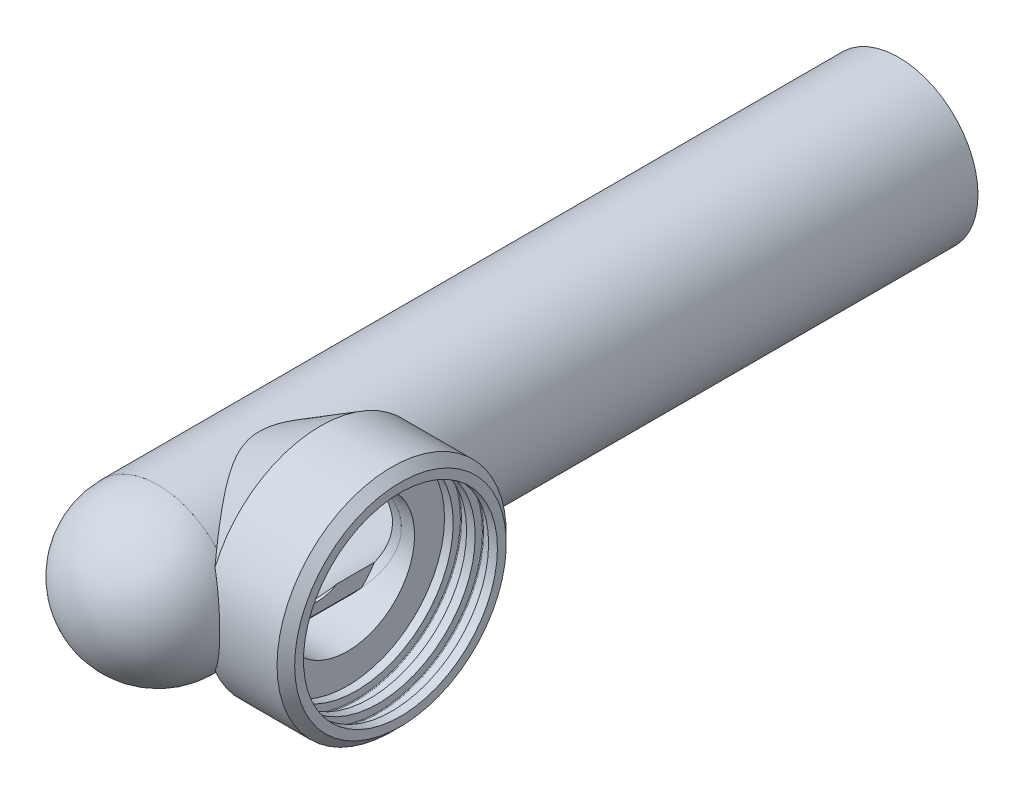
ISO-10303-21;
HEADER;
FILE_DESCRIPTION(('STEP AP214'),'2;1');
FILE_NAME('part.step','',(''),(''),'','','');
FILE_SCHEMA(('AUTOMOTIVE_DESIGN { 1 0 10303 214 1 1 1 1 }'));
ENDSEC;
DATA;
#1=APPLICATION_CONTEXT('core data for automotive mechanical design processes');
#2=APPLICATION_PROTOCOL_DEFINITION('international standard','automotive_design',2000,#1);
#3=PRODUCT_CONTEXT('',#1,'mechanical');
#4=PRODUCT('Part','Part','',(#3));
#5=PRODUCT_RELATED_PRODUCT_CATEGORY('part','',(#4));
#6=PRODUCT_DEFINITION_FORMATION('','',#4);
#7=PRODUCT_DEFINITION_CONTEXT('part definition',#1,'design');
#8=PRODUCT_DEFINITION('design','',#6,#7);
#9=PRODUCT_DEFINITION_SHAPE('','',#8);
#10=(LENGTH_UNIT() NAMED_UNIT(*) SI_UNIT(.MILLI.,.METRE.));
#11=(NAMED_UNIT(*) PLANE_ANGLE_UNIT() SI_UNIT($,.RADIAN.));
#12=(NAMED_UNIT(*) SI_UNIT($,.STERADIAN.) SOLID_ANGLE_UNIT());
#13=UNCERTAINTY_MEASURE_WITH_UNIT(LENGTH_MEASURE(1.E-05),#10,'distance_accuracy_value','');
#14=(GEOMETRIC_REPRESENTATION_CONTEXT(3) GLOBAL_UNCERTAINTY_ASSIGNED_CONTEXT((#13)) GLOBAL_UNIT_ASSIGNED_CONTEXT((#10,
#11,#12)) REPRESENTATION_CONTEXT('',''));
#15=CARTESIAN_POINT('',(0.,0.,0.));
#16=DIRECTION('',(0.,0.,1.));
#17=DIRECTION('',(1.,0.,0.));
#18=AXIS2_PLACEMENT_3D('',#15,#16,#17);
#19=CARTESIAN_POINT('',(47.1358595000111,77.2793064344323,-42.5297692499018));
#20=DIRECTION('',(0.,0.,1.));
#21=DIRECTION('',(1.,0.,0.));
#22=AXIS2_PLACEMENT_3D('',#19,#20,#21);
#23=CYLINDRICAL_SURFACE('',#22,28.575);
#24=CARTESIAN_POINT('',(47.1358595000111,77.2793064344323,-42.5297692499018));
#25=DIRECTION('',(0.,0.,1.));
#26=DIRECTION('',(1.,0.,0.));
#27=AXIS2_PLACEMENT_3D('',#24,#25,#26);
#28=CIRCLE('',#27,28.575);
#29=CARTESIAN_POINT('',(75.7108595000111,77.2793064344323,-42.5297692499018));
#30=VERTEX_POINT('',#29);
#31=EDGE_CURVE('P0_E148',#30,#30,#28,.T.);
#32=ORIENTED_EDGE('',*,*,#31,.T.);
#33=EDGE_LOOP('',(#32));
#34=FACE_BOUND('',#33,.T.);
#35=CARTESIAN_POINT('',(47.1358595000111,77.2793064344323,224.170230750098));
#36=DIRECTION('',(0.,0.,1.));
#37=DIRECTION('',(1.,0.,0.));
#38=AXIS2_PLACEMENT_3D('',#35,#36,#37);
#39=CIRCLE('',#38,28.575);
#40=CARTESIAN_POINT('',(75.7108595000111,77.2793064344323,224.170230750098));
#41=VERTEX_POINT('',#40);
#42=EDGE_CURVE('P0_E144',#41,#41,#39,.T.);
#43=ORIENTED_EDGE('',*,*,#42,.F.);
#44=EDGE_LOOP('',(#43));
#45=FACE_BOUND('',#44,.T.);
#46=CARTESIAN_POINT('',(69.3608595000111,59.318794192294,205.359724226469));
#47=CARTESIAN_POINT('',(69.5328907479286,59.5316715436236,205.596976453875));
#48=CARTESIAN_POINT('',(69.703927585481,59.7495765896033,205.830397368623));
#49=CARTESIAN_POINT('',(70.0433585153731,60.1955230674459,206.289401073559));
#50=CARTESIAN_POINT('',(70.2117523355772,60.4235655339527,206.514983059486));
#51=CARTESIAN_POINT('',(70.712313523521,61.1234821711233,207.180137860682));
#52=CARTESIAN_POINT('',(71.039467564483,61.6106632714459,207.607580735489));
#53=CARTESIAN_POINT('',(71.6772147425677,62.6295054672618,208.43044490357));
#54=CARTESIAN_POINT('',(71.9876559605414,63.1614886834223,208.825585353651));
#55=CARTESIAN_POINT('',(72.5832785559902,64.2657508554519,209.576230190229));
#56=CARTESIAN_POINT('',(72.8684734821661,64.8380078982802,209.931755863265));
#57=CARTESIAN_POINT('',(73.3574880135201,65.9110722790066,210.536673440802));
#58=CARTESIAN_POINT('',(73.5665652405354,66.4053054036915,210.793494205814));
#59=CARTESIAN_POINT('',(73.9609339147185,67.4182072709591,211.27543927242));
#60=CARTESIAN_POINT('',(74.1462259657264,67.9368753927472,211.500564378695));
#61=CARTESIAN_POINT('',(74.4892874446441,68.9950429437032,211.915694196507));
#62=CARTESIAN_POINT('',(74.6471354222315,69.5344773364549,212.105799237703));
#63=CARTESIAN_POINT('',(74.9329148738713,70.6327843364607,212.44892835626));
#64=CARTESIAN_POINT('',(75.0608466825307,71.1916567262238,212.601952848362));
#65=CARTESIAN_POINT('',(75.2849778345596,72.3298726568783,212.869466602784));
#66=CARTESIAN_POINT('',(75.3809078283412,72.9093466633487,212.983628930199));
#67=CARTESIAN_POINT('',(75.537312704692,74.0798300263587,213.169514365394));
#68=CARTESIAN_POINT('',(75.5977872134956,74.6708395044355,213.241237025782));
#69=CARTESIAN_POINT('',(75.6817733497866,75.8593120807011,213.340794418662));
#70=CARTESIAN_POINT('',(75.7052762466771,76.4567766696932,213.368618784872));
#71=CARTESIAN_POINT('',(75.7146753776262,77.6523832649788,213.379749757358));
#72=CARTESIAN_POINT('',(75.7005753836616,78.2505251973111,213.363060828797));
#73=CARTESIAN_POINT('',(75.6390229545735,79.3715092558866,213.290124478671));
#74=CARTESIAN_POINT('',(75.5957015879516,79.8949097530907,213.238776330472));
#75=CARTESIAN_POINT('',(75.4809801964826,80.934165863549,213.102587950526));
#76=CARTESIAN_POINT('',(75.4095828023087,81.450022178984,213.01775085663));
#77=CARTESIAN_POINT('',(75.2400905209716,82.4706826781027,212.815913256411));
#78=CARTESIAN_POINT('',(75.1420062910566,82.9754911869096,212.698925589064));
#79=CARTESIAN_POINT('',(74.9208617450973,83.9714302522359,212.434406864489));
#80=CARTESIAN_POINT('',(74.7978002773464,84.4625601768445,212.286874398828));
#81=CARTESIAN_POINT('',(74.5248349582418,85.4426917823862,211.958460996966));
#82=CARTESIAN_POINT('',(74.3742600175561,85.9312246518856,211.77674186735));
#83=CARTESIAN_POINT('',(74.0511737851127,86.8893068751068,211.385074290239));
#84=CARTESIAN_POINT('',(73.8786619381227,87.3588557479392,211.175125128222));
#85=CARTESIAN_POINT('',(73.5138650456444,88.2782357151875,210.728759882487));
#86=CARTESIAN_POINT('',(73.3215486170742,88.728033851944,210.492301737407));
#87=CARTESIAN_POINT('',(72.9198292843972,89.6061348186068,209.99518997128));
#88=CARTESIAN_POINT('',(72.7104243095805,90.0344350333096,209.734533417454));
#89=CARTESIAN_POINT('',(72.2583420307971,90.9047298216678,209.167509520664));
#90=CARTESIAN_POINT('',(72.0143520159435,91.3447354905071,208.85913888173));
#91=CARTESIAN_POINT('',(71.512135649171,92.1981880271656,208.218073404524));
#92=CARTESIAN_POINT('',(71.2539064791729,92.6116296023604,207.885373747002));
#93=CARTESIAN_POINT('',(70.7275707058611,93.4096830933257,207.199160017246));
#94=CARTESIAN_POINT('',(70.459519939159,93.7944288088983,206.8457583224));
#95=CARTESIAN_POINT('',(69.9154555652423,94.5371353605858,206.118103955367));
#96=CARTESIAN_POINT('',(69.6394467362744,94.8951118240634,205.743863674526));
#97=CARTESIAN_POINT('',(69.3608595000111,95.2398186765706,205.359724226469));
#98=B_SPLINE_CURVE_WITH_KNOTS('',3,(#46,#47,#48,#49,#50,#51,#52,#53,#54,#55,#56,#57,#58,#59,#60,
#61,#62,#63,#64,#65,#66,#67,#68,#69,#70,#71,#72,#73,#74,#75,#76,#77,#78,#79,#80,#81,#82,#83,#84,
#85,#86,#87,#88,#89,#90,#91,#92,#93,#94,#95,#96,#97),.UNSPECIFIED.,.F.,.F.,(4,2,2,2,2,2,2,2,2,2,
2,2,2,2,2,2,2,2,2,2,2,2,2,2,2,4),(0.,1.08653033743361,2.17317182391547,4.34891799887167,
6.54191965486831,8.73373718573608,10.5168549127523,12.2999273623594,14.0778091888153,
15.8556711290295,17.6481399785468,19.4406277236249,21.2335386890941,23.0262698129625,
24.6075001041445,26.1885822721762,27.7690339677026,29.3495585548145,30.975610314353,
32.6017032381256,34.2304137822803,35.8593219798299,37.6282867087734,39.3976027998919,
41.1580732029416,42.9175077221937),.UNSPECIFIED.);
#99=CARTESIAN_POINT('',(69.3608595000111,59.318794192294,205.359724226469));
#100=VERTEX_POINT('',#99);
#101=CARTESIAN_POINT('',(69.3608595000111,95.2398186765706,205.359724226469));
#102=VERTEX_POINT('',#101);
#103=EDGE_CURVE('P0_E129',#100,#102,#98,.T.);
#104=ORIENTED_EDGE('',*,*,#103,.T.);
#105=DIRECTION('',(0.,0.,1.));
#106=VECTOR('',#105,1.);
#107=CARTESIAN_POINT('',(69.3608595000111,95.2398186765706,-42.5297692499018));
#108=LINE('',#107,#106);
#109=CARTESIAN_POINT('',(69.3608595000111,95.2398186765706,173.130737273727));
#110=VERTEX_POINT('',#109);
#111=EDGE_CURVE('P0_E130',#102,#110,#108,.F.);
#112=ORIENTED_EDGE('',*,*,#111,.T.);
#113=CARTESIAN_POINT('',(69.3608595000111,95.2398186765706,173.130737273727));
#114=CARTESIAN_POINT('',(69.5328907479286,95.0269413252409,172.893485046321));
#115=CARTESIAN_POINT('',(69.703927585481,94.8090362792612,172.660064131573));
#116=CARTESIAN_POINT('',(70.0433585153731,94.3630898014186,172.201060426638));
#117=CARTESIAN_POINT('',(70.2117523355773,94.1350473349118,171.975478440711));
#118=CARTESIAN_POINT('',(70.712313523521,93.4351306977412,171.310323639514));
#119=CARTESIAN_POINT('',(71.039467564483,92.9479495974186,170.882880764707));
#120=CARTESIAN_POINT('',(71.6772147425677,91.9291074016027,170.060016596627));
#121=CARTESIAN_POINT('',(71.9876559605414,91.3971241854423,169.664876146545));
#122=CARTESIAN_POINT('',(72.5832785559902,90.2928620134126,168.914231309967));
#123=CARTESIAN_POINT('',(72.8684734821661,89.7206049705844,168.558705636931));
#124=CARTESIAN_POINT('',(73.3574880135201,88.647540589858,167.953788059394));
#125=CARTESIAN_POINT('',(73.5665652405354,88.153307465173,167.696967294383));
#126=CARTESIAN_POINT('',(73.9609339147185,87.1404055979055,167.215022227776));
#127=CARTESIAN_POINT('',(74.1462259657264,86.6217374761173,166.989897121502));
#128=CARTESIAN_POINT('',(74.4892874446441,85.5635699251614,166.57476730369));
#129=CARTESIAN_POINT('',(74.6471354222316,85.0241355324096,166.384662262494));
#130=CARTESIAN_POINT('',(74.9329148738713,83.9258285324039,166.041533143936));
#131=CARTESIAN_POINT('',(75.0608466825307,83.3669561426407,165.888508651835));
#132=CARTESIAN_POINT('',(75.2849778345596,82.2287402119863,165.620994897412));
#133=CARTESIAN_POINT('',(75.3809078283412,81.6492662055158,165.506832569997));
#134=CARTESIAN_POINT('',(75.537312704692,80.4787828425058,165.320947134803));
#135=CARTESIAN_POINT('',(75.5977872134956,79.8877733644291,165.249224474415));
#136=CARTESIAN_POINT('',(75.6817733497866,78.6993007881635,165.149667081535));
#137=CARTESIAN_POINT('',(75.7052762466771,78.1018361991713,165.121842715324));
#138=CARTESIAN_POINT('',(75.7146753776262,76.9062296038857,165.110711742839));
#139=CARTESIAN_POINT('',(75.7005753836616,76.3080876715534,165.127400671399));
#140=CARTESIAN_POINT('',(75.6390229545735,75.187103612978,165.200337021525));
#141=CARTESIAN_POINT('',(75.5957015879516,74.6637031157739,165.251685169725));
#142=CARTESIAN_POINT('',(75.4809801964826,73.6244470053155,165.387873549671));
#143=CARTESIAN_POINT('',(75.4095828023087,73.1085906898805,165.472710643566));
#144=CARTESIAN_POINT('',(75.2400905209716,72.0879301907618,165.674548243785));
#145=CARTESIAN_POINT('',(75.1420062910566,71.5831216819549,165.791535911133));
#146=CARTESIAN_POINT('',(74.9208617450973,70.5871826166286,166.056054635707));
#147=CARTESIAN_POINT('',(74.7978002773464,70.09605269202,166.203587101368));
#148=CARTESIAN_POINT('',(74.5248349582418,69.1159210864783,166.532000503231));
#149=CARTESIAN_POINT('',(74.3742600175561,68.627388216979,166.713719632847));
#150=CARTESIAN_POINT('',(74.0511737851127,67.6693059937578,167.105387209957));
#151=CARTESIAN_POINT('',(73.8786619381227,67.1997571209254,167.315336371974));
#152=CARTESIAN_POINT('',(73.5138650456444,66.2803771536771,167.761701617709));
#153=CARTESIAN_POINT('',(73.3215486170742,65.8305790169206,167.998159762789));
#154=CARTESIAN_POINT('',(72.9198292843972,64.9524780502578,168.495271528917));
#155=CARTESIAN_POINT('',(72.7104243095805,64.5241778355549,168.755928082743));
#156=CARTESIAN_POINT('',(72.2583420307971,63.6538830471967,169.322951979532));
#157=CARTESIAN_POINT('',(72.0143520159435,63.2138773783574,169.631322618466));
#158=CARTESIAN_POINT('',(71.512135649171,62.360424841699,170.272388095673));
#159=CARTESIAN_POINT('',(71.2539064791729,61.9469832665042,170.605087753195));
#160=CARTESIAN_POINT('',(70.7275707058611,61.1489297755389,171.291301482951));
#161=CARTESIAN_POINT('',(70.459519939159,60.7641840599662,171.644703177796));
#162=CARTESIAN_POINT('',(69.9154555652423,60.0214775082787,172.372357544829));
#163=CARTESIAN_POINT('',(69.6394467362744,59.6635010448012,172.74659782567));
#164=CARTESIAN_POINT('',(69.3608595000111,59.318794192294,173.130737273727));
#165=B_SPLINE_CURVE_WITH_KNOTS('',3,(#113,#114,#115,#116,#117,#118,#119,#120,#121,#122,#123,
#124,#125,#126,#127,#128,#129,#130,#131,#132,#133,#134,#135,#136,#137,#138,#139,#140,#141,#142,
#143,#144,#145,#146,#147,#148,#149,#150,#151,#152,#153,#154,#155,#156,#157,#158,#159,#160,#161,
#162,#163,#164),.UNSPECIFIED.,.F.,.F.,(4,2,2,2,2,2,2,2,2,2,2,2,2,2,2,2,2,2,2,2,2,2,2,2,2,4),(0.,
1.08653033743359,2.17317182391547,4.34891799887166,6.54191965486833,8.73373718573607,
10.5168549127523,12.2999273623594,14.0778091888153,15.8556711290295,17.6481399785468,
19.4406277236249,21.2335386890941,23.0262698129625,24.6075001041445,26.1885822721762,
27.7690339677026,29.3495585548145,30.975610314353,32.6017032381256,34.2304137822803,
35.8593219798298,37.6282867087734,39.3976027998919,41.1580732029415,42.9175077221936),.UNSPECIFIED.);
#166=CARTESIAN_POINT('',(69.3608595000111,59.318794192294,173.130737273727));
#167=VERTEX_POINT('',#166);
#168=EDGE_CURVE('P0_E121',#110,#167,#165,.T.);
#169=ORIENTED_EDGE('',*,*,#168,.T.);
#170=DIRECTION('',(0.,0.,1.));
#171=VECTOR('',#170,1.);
#172=CARTESIAN_POINT('',(69.3608595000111,59.318794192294,-42.5297692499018));
#173=LINE('',#172,#171);
#174=EDGE_CURVE('P0_E176',#167,#100,#173,.T.);
#175=ORIENTED_EDGE('',*,*,#174,.T.);
#176=EDGE_LOOP('',(#104,#112,#169,#175));
#177=FACE_BOUND('',#176,.T.);
#178=ADVANCED_FACE('P0_F17',(#34,#45,#177),#23,.T.);
#179=CARTESIAN_POINT('',(47.1358595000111,77.2793064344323,-42.5297692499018));
#180=DIRECTION('',(0.,0.,1.));
#181=DIRECTION('',(1.,0.,0.));
#182=AXIS2_PLACEMENT_3D('',#179,#180,#181);
#183=CYLINDRICAL_SURFACE('',#182,25.4);
#184=CARTESIAN_POINT('',(47.1358595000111,77.2793064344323,224.170230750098));
#185=DIRECTION('',(0.,0.,1.));
#186=DIRECTION('',(1.,0.,0.));
#187=AXIS2_PLACEMENT_3D('',#184,#185,#186);
#188=CIRCLE('',#187,25.4);
#189=CARTESIAN_POINT('',(72.5358595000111,77.2793064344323,224.170230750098));
#190=VERTEX_POINT('',#189);
#191=EDGE_CURVE('P0_E139',#190,#190,#188,.T.);
#192=ORIENTED_EDGE('',*,*,#191,.T.);
#193=EDGE_LOOP('',(#192));
#194=FACE_BOUND('',#193,.T.);
#195=CARTESIAN_POINT('',(47.1358595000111,77.2793064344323,-42.5297692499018));
#196=DIRECTION('',(0.,0.,1.));
#197=DIRECTION('',(1.,0.,0.));
#198=AXIS2_PLACEMENT_3D('',#195,#196,#197);
#199=CIRCLE('',#198,25.4);
#200=CARTESIAN_POINT('',(72.5358595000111,77.2793064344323,-42.5297692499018));
#201=VERTEX_POINT('',#200);
#202=EDGE_CURVE('P0_E140',#201,#201,#199,.T.);
#203=ORIENTED_EDGE('',*,*,#202,.F.);
#204=EDGE_LOOP('',(#203));
#205=FACE_BOUND('',#204,.T.);
#206=DIRECTION('',(0.,0.,1.));
#207=VECTOR('',#206,1.);
#208=CARTESIAN_POINT('',(69.3608595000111,89.5760285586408,-42.5297692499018));
#209=LINE('',#208,#207);
#210=CARTESIAN_POINT('',(69.3608595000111,89.5760285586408,181.970391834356));
#211=VERTEX_POINT('',#210);
#212=CARTESIAN_POINT('',(69.3608595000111,89.5760285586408,168.483546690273));
#213=VERTEX_POINT('',#212);
#214=EDGE_CURVE('P0_E79',#211,#213,#209,.F.);
#215=ORIENTED_EDGE('',*,*,#214,.F.);
#216=CARTESIAN_POINT('',(69.3608595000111,89.5760285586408,181.970391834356));
#217=CARTESIAN_POINT('',(69.2614112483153,89.755765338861,182.274189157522));
#218=CARTESIAN_POINT('',(69.1650814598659,89.924725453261,182.585489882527));
#219=CARTESIAN_POINT('',(68.9810583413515,90.2400429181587,183.222092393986));
#220=CARTESIAN_POINT('',(68.8933717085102,90.3863827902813,183.547404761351));
#221=CARTESIAN_POINT('',(68.728822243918,90.6557404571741,184.212059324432));
#222=CARTESIAN_POINT('',(68.6520103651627,90.7786493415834,184.551458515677));
#223=CARTESIAN_POINT('',(68.5121611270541,90.9990288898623,185.241123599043));
#224=CARTESIAN_POINT('',(68.4491205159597,91.0965055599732,185.59138690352));
#225=CARTESIAN_POINT('',(68.3387415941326,91.2653009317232,186.302632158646));
#226=CARTESIAN_POINT('',(68.2914882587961,91.3364782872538,186.663661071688));
#227=CARTESIAN_POINT('',(68.2150075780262,91.4509075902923,187.392051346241));
#228=CARTESIAN_POINT('',(68.1857811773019,91.4941580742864,187.759413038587));
#229=CARTESIAN_POINT('',(68.1466499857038,91.5519343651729,188.496292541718));
#230=CARTESIAN_POINT('',(68.1366864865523,91.5665474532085,188.865800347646));
#231=CARTESIAN_POINT('',(68.1363392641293,91.5670585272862,189.604819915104));
#232=CARTESIAN_POINT('',(68.1459536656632,91.5529592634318,189.974331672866));
#233=CARTESIAN_POINT('',(68.1826829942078,91.4987351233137,190.678518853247));
#234=CARTESIAN_POINT('',(68.2082242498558,91.4609490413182,191.013461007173));
#235=CARTESIAN_POINT('',(68.2744043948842,91.3621133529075,191.678371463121));
#236=CARTESIAN_POINT('',(68.3150432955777,91.3010637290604,192.008339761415));
#237=CARTESIAN_POINT('',(68.4101628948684,91.1563201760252,192.66186284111));
#238=CARTESIAN_POINT('',(68.4646689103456,91.0725848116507,192.985404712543));
#239=CARTESIAN_POINT('',(68.5857982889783,90.8834495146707,193.623672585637));
#240=CARTESIAN_POINT('',(68.6524198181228,90.7780528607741,193.938399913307));
#241=CARTESIAN_POINT('',(68.8163585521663,90.5136028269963,194.645815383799));
#242=CARTESIAN_POINT('',(68.9170169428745,90.3478143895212,195.03521809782));
#243=CARTESIAN_POINT('',(69.1306684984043,89.9849088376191,195.793227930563));
#244=CARTESIAN_POINT('',(69.2436011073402,89.7879435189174,196.161924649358));
#245=CARTESIAN_POINT('',(69.3608595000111,89.5760285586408,196.520069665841));
#246=B_SPLINE_CURVE_WITH_KNOTS('',3,(#216,#217,#218,#219,#220,#221,#222,#223,#224,#225,#226,
#227,#228,#229,#230,#231,#232,#233,#234,#235,#236,#237,#238,#239,#240,#241,#242,#243,#244,#245),
.UNSPECIFIED.,.F.,.F.,(4,2,2,2,2,2,2,2,2,2,2,2,2,2,4),(0.,1.10006504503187,2.20097589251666,
3.30688540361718,4.41253349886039,5.52404033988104,6.63560542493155,7.74377737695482,
8.85184319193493,9.86475893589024,10.8776754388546,11.8924546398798,12.9070803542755,
14.2102784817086,15.5073163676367),.UNSPECIFIED.);
#247=CARTESIAN_POINT('',(69.3608595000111,89.5760285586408,196.520069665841));
#248=VERTEX_POINT('',#247);
#249=EDGE_CURVE('P0_E32',#211,#248,#246,.T.);
#250=ORIENTED_EDGE('',*,*,#249,.T.);
#251=CARTESIAN_POINT('',(69.3608595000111,89.5760285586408,210.006914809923));
#252=VERTEX_POINT('',#251);
#253=EDGE_CURVE('P0_E26',#252,#248,#209,.F.);
#254=ORIENTED_EDGE('',*,*,#253,.F.);
#255=CARTESIAN_POINT('',(69.3608595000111,64.9825843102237,210.006914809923));
#256=CARTESIAN_POINT('',(69.5993658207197,65.4136012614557,210.262222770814));
#257=CARTESIAN_POINT('',(69.8281452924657,65.8567559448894,210.506535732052));
#258=CARTESIAN_POINT('',(70.2637120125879,66.7666130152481,210.970815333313));
#259=CARTESIAN_POINT('',(70.4704785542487,67.2333369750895,211.190759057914));
#260=CARTESIAN_POINT('',(70.8601853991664,68.1916481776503,211.60468974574));
#261=CARTESIAN_POINT('',(71.0429761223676,68.6833671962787,211.798513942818));
#262=CARTESIAN_POINT('',(71.3803738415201,69.6869648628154,212.155858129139));
#263=CARTESIAN_POINT('',(71.5349886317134,70.1988378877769,212.319386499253));
#264=CARTESIAN_POINT('',(71.8141920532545,71.2432676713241,212.614425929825));
#265=CARTESIAN_POINT('',(71.9385981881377,71.7759286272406,212.74574243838));
#266=CARTESIAN_POINT('',(72.153723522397,72.855572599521,212.972677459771));
#267=CARTESIAN_POINT('',(72.2444401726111,73.4025566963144,213.068293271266));
#268=CARTESIAN_POINT('',(72.3899641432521,74.50474569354,213.221620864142));
#269=CARTESIAN_POINT('',(72.4448854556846,75.0599186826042,213.279452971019));
#270=CARTESIAN_POINT('',(72.5180081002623,76.175319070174,213.356442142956));
#271=CARTESIAN_POINT('',(72.5362135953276,76.7355458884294,213.375603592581));
#272=CARTESIAN_POINT('',(72.5355273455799,77.8051644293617,213.374881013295));
#273=CARTESIAN_POINT('',(72.5198451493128,78.3145663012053,213.35837509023));
#274=CARTESIAN_POINT('',(72.4580897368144,79.3294428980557,213.293356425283));
#275=CARTESIAN_POINT('',(72.4120181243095,79.8349178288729,213.244845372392));
#276=CARTESIAN_POINT('',(72.2902937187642,80.8388651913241,213.116612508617));
#277=CARTESIAN_POINT('',(72.2146065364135,81.3373287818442,213.036854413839));
#278=CARTESIAN_POINT('',(72.0350314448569,82.3233505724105,212.847488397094));
#279=CARTESIAN_POINT('',(71.9311435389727,82.8109087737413,212.737880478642));
#280=CARTESIAN_POINT('',(71.6982443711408,83.7668783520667,212.491933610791));
#281=CARTESIAN_POINT('',(71.5695293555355,84.235443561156,212.355909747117));
#282=CARTESIAN_POINT('',(71.2881688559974,85.157003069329,212.058238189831));
#283=CARTESIAN_POINT('',(71.135520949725,85.6099957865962,211.896587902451));
#284=CARTESIAN_POINT('',(70.8085302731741,86.498225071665,211.549839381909));
#285=CARTESIAN_POINT('',(70.634208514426,86.9334783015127,211.364763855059));
#286=CARTESIAN_POINT('',(70.2658771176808,87.7853782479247,210.973071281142));
#287=CARTESIAN_POINT('',(70.0718738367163,88.2020309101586,210.766461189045));
#288=CARTESIAN_POINT('',(69.7871048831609,88.7734299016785,210.462599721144));
#289=CARTESIAN_POINT('',(69.7037021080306,88.9363084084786,210.373539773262));
#290=CARTESIAN_POINT('',(69.5342552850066,89.2586621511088,210.192451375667));
#291=CARTESIAN_POINT('',(69.4482149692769,89.4181416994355,210.100427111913));
#292=CARTESIAN_POINT('',(69.3608595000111,89.5760285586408,210.006914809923));
#293=B_SPLINE_CURVE_WITH_KNOTS('',3,(#255,#256,#257,#258,#259,#260,#261,#262,#263,#264,#265,
#266,#267,#268,#269,#270,#271,#272,#273,#274,#275,#276,#277,#278,#279,#280,#281,#282,#283,#284,
#285,#286,#287,#288,#289,#290,#291,#292),.UNSPECIFIED.,.F.,.F.,(4,2,2,2,2,2,2,2,2,2,2,2,2,2,2,2,
2,2,4),(0.,1.66446383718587,3.3304797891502,5.00643983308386,6.68193555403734,8.36731459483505,
10.0528211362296,11.7329335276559,13.41285541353,14.9406769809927,16.4684179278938,
17.997938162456,19.527458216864,21.0397455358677,22.5521860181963,24.0631715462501,
25.5736705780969,26.1841548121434,26.7938118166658),.UNSPECIFIED.);
#294=CARTESIAN_POINT('',(69.3608595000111,64.9825843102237,210.006914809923));
#295=VERTEX_POINT('',#294);
#296=EDGE_CURVE('P0_E90',#295,#252,#293,.T.);
#297=ORIENTED_EDGE('',*,*,#296,.F.);
#298=DIRECTION('',(0.,0.,1.));
#299=VECTOR('',#298,1.);
#300=CARTESIAN_POINT('',(69.3608595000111,64.9825843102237,-42.5297692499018));
#301=LINE('',#300,#299);
#302=CARTESIAN_POINT('',(69.3608595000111,64.9825843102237,196.520069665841));
#303=VERTEX_POINT('',#302);
#304=EDGE_CURVE('P0_E152',#303,#295,#301,.T.);
#305=ORIENTED_EDGE('',*,*,#304,.F.);
#306=CARTESIAN_POINT('',(69.3608595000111,64.9825843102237,196.520069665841));
#307=CARTESIAN_POINT('',(69.2614112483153,64.8028475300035,196.216272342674));
#308=CARTESIAN_POINT('',(69.1650814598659,64.6338874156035,195.904971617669));
#309=CARTESIAN_POINT('',(68.9810583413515,64.3185699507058,195.268369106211));
#310=CARTESIAN_POINT('',(68.8933717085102,64.1722300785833,194.943056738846));
#311=CARTESIAN_POINT('',(68.728822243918,63.9028724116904,194.278402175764));
#312=CARTESIAN_POINT('',(68.6520103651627,63.7799635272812,193.93900298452));
#313=CARTESIAN_POINT('',(68.5121611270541,63.5595839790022,193.249337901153));
#314=CARTESIAN_POINT('',(68.4491205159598,63.4621073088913,192.899074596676));
#315=CARTESIAN_POINT('',(68.3387415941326,63.2933119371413,192.18782934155));
#316=CARTESIAN_POINT('',(68.2914882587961,63.2221345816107,191.826800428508));
#317=CARTESIAN_POINT('',(68.2150075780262,63.1077052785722,191.098410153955));
#318=CARTESIAN_POINT('',(68.1857811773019,63.0644547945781,190.73104846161));
#319=CARTESIAN_POINT('',(68.1466499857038,63.0066785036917,189.994168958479));
#320=CARTESIAN_POINT('',(68.1366864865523,62.9920654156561,189.62466115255));
#321=CARTESIAN_POINT('',(68.1363392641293,62.9915543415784,188.885641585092));
#322=CARTESIAN_POINT('',(68.1459536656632,63.0056536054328,188.516129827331));
#323=CARTESIAN_POINT('',(68.1826829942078,63.0598777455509,187.811942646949));
#324=CARTESIAN_POINT('',(68.2082242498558,63.0976638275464,187.477000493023));
#325=CARTESIAN_POINT('',(68.2744043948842,63.196499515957,186.812090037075));
#326=CARTESIAN_POINT('',(68.3150432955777,63.2575491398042,186.482121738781));
#327=CARTESIAN_POINT('',(68.4101628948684,63.4022926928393,185.828598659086));
#328=CARTESIAN_POINT('',(68.4646689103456,63.4860280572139,185.505056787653));
#329=CARTESIAN_POINT('',(68.5857982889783,63.6751633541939,184.86678891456));
#330=CARTESIAN_POINT('',(68.6524198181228,63.7805600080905,184.552061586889));
#331=CARTESIAN_POINT('',(68.8163585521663,64.0450100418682,183.844646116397));
#332=CARTESIAN_POINT('',(68.9170169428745,64.2107984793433,183.455243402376));
#333=CARTESIAN_POINT('',(69.1306684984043,64.5737040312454,182.697233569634));
#334=CARTESIAN_POINT('',(69.2436011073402,64.7706693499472,182.328536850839));
#335=CARTESIAN_POINT('',(69.3608595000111,64.9825843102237,181.970391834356));
#336=B_SPLINE_CURVE_WITH_KNOTS('',3,(#306,#307,#308,#309,#310,#311,#312,#313,#314,#315,#316,
#317,#318,#319,#320,#321,#322,#323,#324,#325,#326,#327,#328,#329,#330,#331,#332,#333,#334,#335),
.UNSPECIFIED.,.F.,.F.,(4,2,2,2,2,2,2,2,2,2,2,2,2,2,4),(0.,1.10006504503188,2.20097589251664,
3.30688540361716,4.4125334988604,5.52404033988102,6.63560542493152,7.74377737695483,
8.85184319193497,9.86475893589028,10.8776754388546,11.8924546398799,12.9070803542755,
14.2102784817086,15.5073163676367),.UNSPECIFIED.);
#337=CARTESIAN_POINT('',(69.3608595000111,64.9825843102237,181.970391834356));
#338=VERTEX_POINT('',#337);
#339=EDGE_CURVE('P0_E38',#303,#338,#336,.T.);
#340=ORIENTED_EDGE('',*,*,#339,.T.);
#341=CARTESIAN_POINT('',(69.3608595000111,64.9825843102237,168.483546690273));
#342=VERTEX_POINT('',#341);
#343=EDGE_CURVE('P0_E155',#342,#338,#301,.T.);
#344=ORIENTED_EDGE('',*,*,#343,.F.);
#345=CARTESIAN_POINT('',(69.3608595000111,89.5760285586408,168.483546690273));
#346=CARTESIAN_POINT('',(69.5993658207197,89.1450116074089,168.228238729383));
#347=CARTESIAN_POINT('',(69.8281452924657,88.7018569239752,167.983925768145));
#348=CARTESIAN_POINT('',(70.2637120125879,87.7919998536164,167.519646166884));
#349=CARTESIAN_POINT('',(70.4704785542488,87.3252758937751,167.299702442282));
#350=CARTESIAN_POINT('',(70.8601853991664,86.3669646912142,166.885771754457));
#351=CARTESIAN_POINT('',(71.0429761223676,85.8752456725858,166.691947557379));
#352=CARTESIAN_POINT('',(71.3803738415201,84.8716480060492,166.334603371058));
#353=CARTESIAN_POINT('',(71.5349886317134,84.3597749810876,166.171075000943));
#354=CARTESIAN_POINT('',(71.8141920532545,83.3153451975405,165.876035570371));
#355=CARTESIAN_POINT('',(71.9385981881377,82.7826842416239,165.744719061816));
#356=CARTESIAN_POINT('',(72.153723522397,81.7030402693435,165.517784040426));
#357=CARTESIAN_POINT('',(72.2444401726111,81.1560561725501,165.422168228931));
#358=CARTESIAN_POINT('',(72.3899641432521,80.0538671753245,165.268840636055));
#359=CARTESIAN_POINT('',(72.4448854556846,79.4986941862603,165.211008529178));
#360=CARTESIAN_POINT('',(72.5180081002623,78.3832937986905,165.134019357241));
#361=CARTESIAN_POINT('',(72.5362135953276,77.8230669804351,165.114857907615));
#362=CARTESIAN_POINT('',(72.5355273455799,76.7534484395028,165.115580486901));
#363=CARTESIAN_POINT('',(72.5198451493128,76.2440465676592,165.132086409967));
#364=CARTESIAN_POINT('',(72.4580897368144,75.2291699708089,165.197105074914));
#365=CARTESIAN_POINT('',(72.4120181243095,74.7236950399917,165.245616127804));
#366=CARTESIAN_POINT('',(72.2902937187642,73.7197476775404,165.37384899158));
#367=CARTESIAN_POINT('',(72.2146065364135,73.2212840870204,165.453607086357));
#368=CARTESIAN_POINT('',(72.0350314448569,72.235262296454,165.642973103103));
#369=CARTESIAN_POINT('',(71.9311435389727,71.7477040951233,165.752581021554));
#370=CARTESIAN_POINT('',(71.6982443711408,70.7917345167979,165.998527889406));
#371=CARTESIAN_POINT('',(71.5695293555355,70.3231693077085,166.134551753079));
#372=CARTESIAN_POINT('',(71.2881688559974,69.4016097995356,166.432223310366));
#373=CARTESIAN_POINT('',(71.135520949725,68.9486170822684,166.593873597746));
#374=CARTESIAN_POINT('',(70.8085302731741,68.0603877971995,166.940622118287));
#375=CARTESIAN_POINT('',(70.634208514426,67.6251345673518,167.125697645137));
#376=CARTESIAN_POINT('',(70.2658771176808,66.7732346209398,167.517390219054));
#377=CARTESIAN_POINT('',(70.0718738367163,66.3565819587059,167.724000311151));
#378=CARTESIAN_POINT('',(69.7871048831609,65.785182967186,168.027861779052));
#379=CARTESIAN_POINT('',(69.7037021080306,65.622304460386,168.116921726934));
#380=CARTESIAN_POINT('',(69.5342552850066,65.2999507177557,168.29801012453));
#381=CARTESIAN_POINT('',(69.4482149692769,65.140471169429,168.390034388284));
#382=CARTESIAN_POINT('',(69.3608595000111,64.9825843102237,168.483546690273));
#383=B_SPLINE_CURVE_WITH_KNOTS('',3,(#345,#346,#347,#348,#349,#350,#351,#352,#353,#354,#355,
#356,#357,#358,#359,#360,#361,#362,#363,#364,#365,#366,#367,#368,#369,#370,#371,#372,#373,#374,
#375,#376,#377,#378,#379,#380,#381,#382),.UNSPECIFIED.,.F.,.F.,(4,2,2,2,2,2,2,2,2,2,2,2,2,2,2,2,
2,2,4),(0.,1.66446383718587,3.33047978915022,5.00643983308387,6.68193555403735,8.36731459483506,
10.0528211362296,11.732933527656,13.41285541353,14.9406769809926,16.4684179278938,
17.997938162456,19.527458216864,21.0397455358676,22.5521860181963,24.0631715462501,
25.5736705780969,26.1841548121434,26.7938118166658),.UNSPECIFIED.);
#384=EDGE_CURVE('P0_E100',#213,#342,#383,.T.);
#385=ORIENTED_EDGE('',*,*,#384,.F.);
#386=EDGE_LOOP('',(#215,#250,#254,#297,#305,#340,#344,#385));
#387=FACE_BOUND('',#386,.T.);
#388=ADVANCED_FACE('P0_F76',(#194,#205,#387),#183,.F.);
#389=CARTESIAN_POINT('',(47.1358595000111,77.2793064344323,-42.5297692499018));
#390=DIRECTION('',(0.,0.,1.));
#391=DIRECTION('',(1.,0.,0.));
#392=AXIS2_PLACEMENT_3D('',#389,#390,#391);
#393=PLANE('',#392);
#394=ORIENTED_EDGE('',*,*,#202,.T.);
#395=EDGE_LOOP('',(#394));
#396=FACE_BOUND('',#395,.T.);
#397=ORIENTED_EDGE('',*,*,#31,.F.);
#398=EDGE_LOOP('',(#397));
#399=FACE_BOUND('',#398,.T.);
#400=ADVANCED_FACE('P0_F207',(#396,#399),#393,.F.);
#401=CARTESIAN_POINT('',(47.1358595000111,77.2793064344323,224.170230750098));
#402=DIRECTION('',(0.,0.,1.));
#403=DIRECTION('',(1.,0.,0.));
#404=AXIS2_PLACEMENT_3D('',#401,#402,#403);
#405=PLANE('',#404);
#406=ORIENTED_EDGE('',*,*,#191,.F.);
#407=EDGE_LOOP('',(#406));
#408=FACE_BOUND('',#407,.T.);
#409=ORIENTED_EDGE('',*,*,#42,.T.);
#410=EDGE_LOOP('',(#409));
#411=FACE_BOUND('',#410,.T.);
#412=ADVANCED_FACE('P0_F113',(#408,#411),#405,.T.);
#413=CARTESIAN_POINT('',(94.7608595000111,77.2793064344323,189.245230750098));
#414=DIRECTION('',(-1.,0.,0.));
#415=DIRECTION('',(0.,0.,1.));
#416=AXIS2_PLACEMENT_3D('',#413,#414,#415);
#417=CYLINDRICAL_SURFACE('',#416,24.13);
#418=CARTESIAN_POINT('',(69.3608595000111,77.2793064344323,189.245230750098));
#419=DIRECTION('',(1.,0.,0.));
#420=DIRECTION('',(0.,0.,-1.));
#421=AXIS2_PLACEMENT_3D('',#418,#419,#420);
#422=CIRCLE('',#421,24.13);
#423=EDGE_CURVE('P0_E166',#295,#100,#422,.T.);
#424=ORIENTED_EDGE('',*,*,#423,.F.);
#425=ORIENTED_EDGE('',*,*,#296,.T.);
#426=EDGE_CURVE('P0_E86',#102,#252,#422,.T.);
#427=ORIENTED_EDGE('',*,*,#426,.F.);
#428=ORIENTED_EDGE('',*,*,#103,.F.);
#429=EDGE_LOOP('',(#424,#425,#427,#428));
#430=FACE_BOUND('',#429,.T.);
#431=ADVANCED_FACE('P0_F108',(#430),#417,.F.);
#432=EDGE_CURVE('P0_E173',#213,#110,#422,.T.);
#433=ORIENTED_EDGE('',*,*,#432,.F.);
#434=ORIENTED_EDGE('',*,*,#384,.T.);
#435=EDGE_CURVE('P0_E81',#167,#342,#422,.T.);
#436=ORIENTED_EDGE('',*,*,#435,.F.);
#437=ORIENTED_EDGE('',*,*,#168,.F.);
#438=EDGE_LOOP('',(#433,#434,#436,#437));
#439=FACE_BOUND('',#438,.T.);
#440=ADVANCED_FACE('P0_F112',(#439),#417,.F.);
#441=CARTESIAN_POINT('',(69.3608595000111,77.2793064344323,189.245230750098));
#442=DIRECTION('',(1.,0.,0.));
#443=DIRECTION('',(0.,0.,-1.));
#444=AXIS2_PLACEMENT_3D('',#441,#442,#443);
#445=PLANE('',#444);
#446=CARTESIAN_POINT('',(69.3608595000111,77.2793064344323,189.245230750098));
#447=DIRECTION('',(1.,0.,0.));
#448=DIRECTION('',(0.,0.,-1.));
#449=AXIS2_PLACEMENT_3D('',#446,#447,#448);
#450=CIRCLE('',#449,14.2875);
#451=EDGE_CURVE('P0_E67',#211,#248,#450,.T.);
#452=ORIENTED_EDGE('',*,*,#451,.F.);
#453=ORIENTED_EDGE('',*,*,#214,.T.);
#454=ORIENTED_EDGE('',*,*,#432,.T.);
#455=ORIENTED_EDGE('',*,*,#111,.F.);
#456=ORIENTED_EDGE('',*,*,#426,.T.);
#457=ORIENTED_EDGE('',*,*,#253,.T.);
#458=EDGE_LOOP('',(#452,#453,#454,#455,#456,#457));
#459=FACE_BOUND('',#458,.T.);
#460=ADVANCED_FACE('P0_F84',(#459),#445,.T.);
#461=CARTESIAN_POINT('',(69.3608595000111,77.2793064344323,189.245230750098));
#462=DIRECTION('',(1.,0.,0.));
#463=DIRECTION('',(0.,0.,-1.));
#464=AXIS2_PLACEMENT_3D('',#461,#462,#463);
#465=CIRCLE('',#464,14.2875);
#466=EDGE_CURVE('P0_E11',#303,#338,#465,.T.);
#467=ORIENTED_EDGE('',*,*,#466,.F.);
#468=ORIENTED_EDGE('',*,*,#304,.T.);
#469=ORIENTED_EDGE('',*,*,#423,.T.);
#470=ORIENTED_EDGE('',*,*,#174,.F.);
#471=ORIENTED_EDGE('',*,*,#435,.T.);
#472=ORIENTED_EDGE('',*,*,#343,.T.);
#473=EDGE_LOOP('',(#467,#468,#469,#470,#471,#472));
#474=FACE_BOUND('',#473,.T.);
#475=ADVANCED_FACE('P0_F165',(#474),#445,.T.);
#476=CARTESIAN_POINT('',(63.0108595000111,77.2793064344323,189.245230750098));
#477=DIRECTION('',(1.,0.,0.));
#478=DIRECTION('',(0.,0.,-1.));
#479=AXIS2_PLACEMENT_3D('',#476,#477,#478);
#480=CYLINDRICAL_SURFACE('',#479,14.2875);
#481=ORIENTED_EDGE('',*,*,#466,.T.);
#482=ORIENTED_EDGE('',*,*,#339,.F.);
#483=EDGE_LOOP('',(#481,#482));
#484=FACE_BOUND('',#483,.T.);
#485=ADVANCED_FACE('P0_F196',(#484),#480,.F.);
#486=ORIENTED_EDGE('',*,*,#451,.T.);
#487=ORIENTED_EDGE('',*,*,#249,.F.);
#488=EDGE_LOOP('',(#486,#487));
#489=FACE_BOUND('',#488,.T.);
#490=ADVANCED_FACE('P0_F68',(#489),#480,.F.);
#491=CLOSED_SHELL('',(#178,#388,#400,#412,#431,#440,#460,#475,#485,#490));
#492=MANIFOLD_SOLID_BREP('P0_B1',#491);
#493=CARTESIAN_POINT('',(47.1358595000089,77.2793064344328,224.170230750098));
#494=DIRECTION('',(0.0494547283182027,-0.998776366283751,0.));
#495=DIRECTION('',(0.998776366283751,0.0494547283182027,0.));
#496=AXIS2_PLACEMENT_3D('',#493,#494,#495);
#497=SPHERICAL_SURFACE('',#496,28.575);
#498=CARTESIAN_POINT('',(47.1358595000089,77.2793064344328,224.170230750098));
#499=DIRECTION('',(0.,0.,1.));
#500=DIRECTION('',(-0.998776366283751,-0.0494547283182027,0.));
#501=AXIS2_PLACEMENT_3D('',#498,#499,#500);
#502=SPHERICAL_SURFACE('',#501,28.575);
#503=CARTESIAN_POINT('',(47.1358595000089,77.2793064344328,224.170230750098));
#504=DIRECTION('',(0.,0.,1.));
#505=DIRECTION('',(-0.998776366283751,-0.0494547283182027,0.));
#506=AXIS2_PLACEMENT_3D('',#503,#504,#505);
#507=CIRCLE('',#506,28.575);
#508=CARTESIAN_POINT('',(18.5958248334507,75.8661375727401,224.170230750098));
#509=VERTEX_POINT('',#508);
#510=EDGE_CURVE('P1_E51',#509,#509,#507,.T.);
#511=ORIENTED_EDGE('',*,*,#510,.T.);
#512=EDGE_LOOP('',(#511));
#513=FACE_BOUND('',#512,.T.);
#514=ADVANCED_FACE('P1_F17',(#513),#502,.T.);
#515=CARTESIAN_POINT('',(51.5532722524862,52.2663804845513,224.170230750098));
#516=DIRECTION('',(-0.0494547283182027,0.998776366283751,0.));
#517=DIRECTION('',(0.,0.,-1.));
#518=AXIS2_PLACEMENT_3D('',#515,#516,#517);
#519=PLANE('',#518);
#520=CARTESIAN_POINT('',(48.3821572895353,52.1093617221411,224.170230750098));
#521=DIRECTION('',(0.0494547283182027,-0.998776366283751,0.));
#522=DIRECTION('',(0.,0.,1.));
#523=AXIS2_PLACEMENT_3D('',#520,#521,#522);
#524=CIRCLE('',#523,3.175);
#525=CARTESIAN_POINT('',(51.5532722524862,52.2663804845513,224.170230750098));
#526=VERTEX_POINT('',#525);
#527=CARTESIAN_POINT('',(45.2110423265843,51.9523429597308,224.170230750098));
#528=VERTEX_POINT('',#527);
#529=EDGE_CURVE('P1_E11',#526,#528,#524,.T.);
#530=ORIENTED_EDGE('',*,*,#529,.F.);
#531=DIRECTION('',(-0.998776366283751,-0.0494547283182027,0.));
#532=VECTOR('',#531,1.);
#533=CARTESIAN_POINT('',(51.5532722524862,52.2663804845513,224.170230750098));
#534=LINE('',#533,#532);
#535=EDGE_CURVE('P1_E54',#526,#528,#534,.T.);
#536=ORIENTED_EDGE('',*,*,#535,.T.);
#537=EDGE_LOOP('',(#530,#536));
#538=FACE_BOUND('',#537,.T.);
#539=ADVANCED_FACE('P1_F19',(#538),#519,.T.);
#540=CARTESIAN_POINT('',(47.1358595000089,77.2793064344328,224.170230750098));
#541=DIRECTION('',(0.0494547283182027,-0.998776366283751,0.));
#542=DIRECTION('',(0.998776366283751,0.0494547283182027,0.));
#543=AXIS2_PLACEMENT_3D('',#540,#541,#542);
#544=SPHERICAL_SURFACE('',#543,25.4);
#545=CARTESIAN_POINT('',(45.8895617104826,102.449251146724,224.170230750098));
#546=DIRECTION('',(0.0494547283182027,-0.998776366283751,0.));
#547=DIRECTION('',(0.,0.,1.));
#548=AXIS2_PLACEMENT_3D('',#545,#546,#547);
#549=CIRCLE('',#548,3.175);
#550=CARTESIAN_POINT('',(49.0606766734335,102.606269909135,224.170230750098));
#551=VERTEX_POINT('',#550);
#552=CARTESIAN_POINT('',(42.7184467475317,102.292232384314,224.170230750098));
#553=VERTEX_POINT('',#552);
#554=EDGE_CURVE('P1_E25',#551,#553,#549,.T.);
#555=ORIENTED_EDGE('',*,*,#554,.F.);
#556=CARTESIAN_POINT('',(47.1358595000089,77.2793064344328,224.170230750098));
#557=DIRECTION('',(0.,0.,-1.));
#558=DIRECTION('',(-0.998776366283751,-0.0494547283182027,0.));
#559=AXIS2_PLACEMENT_3D('',#556,#557,#558);
#560=CIRCLE('',#559,25.4);
#561=EDGE_CURVE('P1_E49',#551,#526,#560,.T.);
#562=ORIENTED_EDGE('',*,*,#561,.T.);
#563=ORIENTED_EDGE('',*,*,#529,.T.);
#564=CARTESIAN_POINT('',(47.135859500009,77.2793064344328,224.170230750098));
#565=DIRECTION('',(0.,0.,1.));
#566=DIRECTION('',(0.998776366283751,0.0494547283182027,0.));
#567=AXIS2_PLACEMENT_3D('',#564,#565,#566);
#568=CIRCLE('',#567,25.4);
#569=EDGE_CURVE('P1_E48',#553,#528,#568,.T.);
#570=ORIENTED_EDGE('',*,*,#569,.F.);
#571=EDGE_LOOP('',(#555,#562,#563,#570));
#572=FACE_BOUND('',#571,.T.);
#573=ADVANCED_FACE('P1_F55',(#572),#544,.F.);
#574=CARTESIAN_POINT('',(49.0606766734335,102.606269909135,224.170230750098));
#575=DIRECTION('',(0.0494547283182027,-0.998776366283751,0.));
#576=DIRECTION('',(0.,0.,1.));
#577=AXIS2_PLACEMENT_3D('',#574,#575,#576);
#578=PLANE('',#577);
#579=ORIENTED_EDGE('',*,*,#554,.T.);
#580=DIRECTION('',(0.998776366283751,0.0494547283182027,0.));
#581=VECTOR('',#580,1.);
#582=CARTESIAN_POINT('',(49.0606766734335,102.606269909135,224.170230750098));
#583=LINE('',#582,#581);
#584=EDGE_CURVE('P1_E44',#553,#551,#583,.T.);
#585=ORIENTED_EDGE('',*,*,#584,.T.);
#586=EDGE_LOOP('',(#579,#585));
#587=FACE_BOUND('',#586,.T.);
#588=ADVANCED_FACE('P1_F53',(#587),#578,.T.);
#589=CARTESIAN_POINT('',(47.1358595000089,77.2793064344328,224.170230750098));
#590=DIRECTION('',(0.,0.,-1.));
#591=DIRECTION('',(-0.998776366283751,-0.0494547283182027,0.));
#592=AXIS2_PLACEMENT_3D('',#589,#590,#591);
#593=PLANE('',#592);
#594=ORIENTED_EDGE('',*,*,#584,.F.);
#595=ORIENTED_EDGE('',*,*,#569,.T.);
#596=ORIENTED_EDGE('',*,*,#535,.F.);
#597=ORIENTED_EDGE('',*,*,#561,.F.);
#598=EDGE_LOOP('',(#594,#595,#596,#597));
#599=FACE_BOUND('',#598,.T.);
#600=ORIENTED_EDGE('',*,*,#510,.F.);
#601=EDGE_LOOP('',(#600));
#602=FACE_BOUND('',#601,.T.);
#603=ADVANCED_FACE('P1_F45',(#599,#602),#593,.T.);
#604=CLOSED_SHELL('',(#514,#539,#573,#588,#603));
#605=MANIFOLD_SOLID_BREP('P1_B1',#604);
#606=CARTESIAN_POINT('',(80.4606595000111,77.2793064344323,189.245230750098));
#607=DIRECTION('',(1.,0.,0.));
#608=DIRECTION('',(0.,0.,-1.));
#609=AXIS2_PLACEMENT_3D('',#606,#607,#608);
#610=CYLINDRICAL_SURFACE('',#609,34.925);
#611=CARTESIAN_POINT('',(88.4108595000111,77.2793064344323,189.245230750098));
#612=DIRECTION('',(1.,0.,0.));
#613=DIRECTION('',(0.,0.,-1.));
#614=AXIS2_PLACEMENT_3D('',#611,#612,#613);
#615=CIRCLE('',#614,34.925);
#616=CARTESIAN_POINT('',(88.4108595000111,77.2793064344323,154.320230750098));
#617=VERTEX_POINT('',#616);
#618=EDGE_CURVE('P2_E182',#617,#617,#615,.F.);
#619=CARTESIAN_POINT('',(91.5096595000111,77.2793064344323,189.245230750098));
#620=DIRECTION('',(1.,0.,0.));
#621=DIRECTION('',(0.,0.,-1.));
#622=AXIS2_PLACEMENT_3D('',#619,#620,#621);
#623=CIRCLE('',#622,34.925);
#624=CARTESIAN_POINT('',(91.5096595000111,77.2793064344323,154.320230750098));
#625=VERTEX_POINT('',#624);
#626=EDGE_CURVE('P2_E185',#625,#625,#623,.F.);
#627=CARTESIAN_POINT('',(88.4108595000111,77.2793064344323,154.320230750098));
#628=CARTESIAN_POINT('',(88.4431386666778,77.2793064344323,154.320230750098));
#629=CARTESIAN_POINT('',(88.4754178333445,77.2793064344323,154.320230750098));
#630=CARTESIAN_POINT('',(88.5399761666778,77.2793064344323,154.320230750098));
#631=CARTESIAN_POINT('',(88.5722553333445,77.2793064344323,154.320230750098));
#632=CARTESIAN_POINT('',(88.6368136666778,77.2793064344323,154.320230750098));
#633=CARTESIAN_POINT('',(88.6690928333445,77.2793064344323,154.320230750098));
#634=CARTESIAN_POINT('',(88.7336511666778,77.2793064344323,154.320230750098));
#635=CARTESIAN_POINT('',(88.7659303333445,77.2793064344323,154.320230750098));
#636=CARTESIAN_POINT('',(88.8304886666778,77.2793064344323,154.320230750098));
#637=CARTESIAN_POINT('',(88.8627678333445,77.2793064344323,154.320230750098));
#638=CARTESIAN_POINT('',(88.9273261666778,77.2793064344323,154.320230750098));
#639=CARTESIAN_POINT('',(88.9596053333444,77.2793064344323,154.320230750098));
#640=CARTESIAN_POINT('',(89.0241636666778,77.2793064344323,154.320230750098));
#641=CARTESIAN_POINT('',(89.0564428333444,77.2793064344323,154.320230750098));
#642=CARTESIAN_POINT('',(89.1210011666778,77.2793064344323,154.320230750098));
#643=CARTESIAN_POINT('',(89.1532803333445,77.2793064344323,154.320230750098));
#644=CARTESIAN_POINT('',(89.2178386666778,77.2793064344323,154.320230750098));
#645=CARTESIAN_POINT('',(89.2501178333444,77.2793064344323,154.320230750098));
#646=CARTESIAN_POINT('',(89.3146761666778,77.2793064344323,154.320230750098));
#647=CARTESIAN_POINT('',(89.3469553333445,77.2793064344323,154.320230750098));
#648=CARTESIAN_POINT('',(89.4115136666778,77.2793064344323,154.320230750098));
#649=CARTESIAN_POINT('',(89.4437928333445,77.2793064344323,154.320230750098));
#650=CARTESIAN_POINT('',(89.5083511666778,77.2793064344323,154.320230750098));
#651=CARTESIAN_POINT('',(89.5406303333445,77.2793064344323,154.320230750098));
#652=CARTESIAN_POINT('',(89.6051886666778,77.2793064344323,154.320230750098));
#653=CARTESIAN_POINT('',(89.6374678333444,77.2793064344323,154.320230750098));
#654=CARTESIAN_POINT('',(89.7020261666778,77.2793064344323,154.320230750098));
#655=CARTESIAN_POINT('',(89.7343053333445,77.2793064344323,154.320230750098));
#656=CARTESIAN_POINT('',(89.7988636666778,77.2793064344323,154.320230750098));
#657=CARTESIAN_POINT('',(89.8311428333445,77.2793064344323,154.320230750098));
#658=CARTESIAN_POINT('',(89.8957011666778,77.2793064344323,154.320230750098));
#659=CARTESIAN_POINT('',(89.9279803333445,77.2793064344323,154.320230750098));
#660=CARTESIAN_POINT('',(89.9925386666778,77.2793064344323,154.320230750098));
#661=CARTESIAN_POINT('',(90.0248178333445,77.2793064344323,154.320230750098));
#662=CARTESIAN_POINT('',(90.0893761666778,77.2793064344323,154.320230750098));
#663=CARTESIAN_POINT('',(90.1216553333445,77.2793064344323,154.320230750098));
#664=CARTESIAN_POINT('',(90.1862136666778,77.2793064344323,154.320230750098));
#665=CARTESIAN_POINT('',(90.2184928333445,77.2793064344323,154.320230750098));
#666=CARTESIAN_POINT('',(90.2830511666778,77.2793064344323,154.320230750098));
#667=CARTESIAN_POINT('',(90.3153303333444,77.2793064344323,154.320230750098));
#668=CARTESIAN_POINT('',(90.3798886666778,77.2793064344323,154.320230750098));
#669=CARTESIAN_POINT('',(90.4121678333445,77.2793064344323,154.320230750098));
#670=CARTESIAN_POINT('',(90.4767261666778,77.2793064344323,154.320230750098));
#671=CARTESIAN_POINT('',(90.5090053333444,77.2793064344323,154.320230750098));
#672=CARTESIAN_POINT('',(90.5735636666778,77.2793064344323,154.320230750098));
#673=CARTESIAN_POINT('',(90.6058428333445,77.2793064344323,154.320230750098));
#674=CARTESIAN_POINT('',(90.6704011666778,77.2793064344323,154.320230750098));
#675=CARTESIAN_POINT('',(90.7026803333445,77.2793064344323,154.320230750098));
#676=CARTESIAN_POINT('',(90.7672386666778,77.2793064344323,154.320230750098));
#677=CARTESIAN_POINT('',(90.7995178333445,77.2793064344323,154.320230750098));
#678=CARTESIAN_POINT('',(90.8640761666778,77.2793064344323,154.320230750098));
#679=CARTESIAN_POINT('',(90.8963553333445,77.2793064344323,154.320230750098));
#680=CARTESIAN_POINT('',(90.9609136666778,77.2793064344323,154.320230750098));
#681=CARTESIAN_POINT('',(90.9931928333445,77.2793064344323,154.320230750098));
#682=CARTESIAN_POINT('',(91.0577511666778,77.2793064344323,154.320230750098));
#683=CARTESIAN_POINT('',(91.0900303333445,77.2793064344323,154.320230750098));
#684=CARTESIAN_POINT('',(91.1545886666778,77.2793064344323,154.320230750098));
#685=CARTESIAN_POINT('',(91.1868678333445,77.2793064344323,154.320230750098));
#686=CARTESIAN_POINT('',(91.2514261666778,77.2793064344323,154.320230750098));
#687=CARTESIAN_POINT('',(91.2837053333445,77.2793064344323,154.320230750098));
#688=CARTESIAN_POINT('',(91.3482636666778,77.2793064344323,154.320230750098));
#689=CARTESIAN_POINT('',(91.3805428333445,77.2793064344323,154.320230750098));
#690=CARTESIAN_POINT('',(91.4451011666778,77.2793064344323,154.320230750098));
#691=CARTESIAN_POINT('',(91.4773803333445,77.2793064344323,154.320230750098));
#692=CARTESIAN_POINT('',(91.5096595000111,77.2793064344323,154.320230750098));
#693=B_SPLINE_CURVE_WITH_KNOTS('',3,(#627,#628,#629,#630,#631,#632,#633,#634,#635,#636,#637,
#638,#639,#640,#641,#642,#643,#644,#645,#646,#647,#648,#649,#650,#651,#652,#653,#654,#655,#656,
#657,#658,#659,#660,#661,#662,#663,#664,#665,#666,#667,#668,#669,#670,#671,#672,#673,#674,#675,
#676,#677,#678,#679,#680,#681,#682,#683,#684,#685,#686,#687,#688,#689,#690,#691,#692),
.UNSPECIFIED.,.F.,.F.,(4,2,2,2,2,2,2,2,2,2,2,2,2,2,2,2,2,2,2,2,2,2,2,2,2,2,2,2,2,2,2,2,4),(0.,
0.0968375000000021,0.193675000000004,0.290512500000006,0.387350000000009,0.484187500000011,
0.581024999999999,0.677862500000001,0.774700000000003,0.871537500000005,0.968375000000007,
1.06521250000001,1.16205000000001,1.2588875,1.355725,1.4525625,1.54940000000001,
1.64623750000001,1.74307500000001,1.83991250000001,1.93675,2.0335875,2.13042500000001,
2.22726250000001,2.32410000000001,2.42093750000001,2.51777500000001,2.6146125,2.71145,
2.80828750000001,2.90512500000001,3.00196250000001,3.09880000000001),.UNSPECIFIED.);
#694=EDGE_CURVE('P2_BSEAM17',#617,#625,#693,.T.);
#695=ORIENTED_EDGE('',*,*,#618,.T.);
#696=ORIENTED_EDGE('',*,*,#626,.F.);
#697=ORIENTED_EDGE('',*,*,#694,.T.);
#698=ORIENTED_EDGE('',*,*,#694,.F.);
#699=EDGE_LOOP('',(#695,#697,#696,#698));
#700=FACE_BOUND('',#699,.T.);
#701=ADVANCED_FACE('P2_F17',(#700),#610,.F.);
#702=CARTESIAN_POINT('',(80.4606595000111,77.2793064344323,189.245230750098));
#703=DIRECTION('',(1.,0.,0.));
#704=DIRECTION('',(0.,0.,-1.));
#705=AXIS2_PLACEMENT_3D('',#702,#703,#704);
#706=CIRCLE('',#705,34.925);
#707=CARTESIAN_POINT('',(80.4606595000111,77.2793064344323,154.320230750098));
#708=VERTEX_POINT('',#707);
#709=EDGE_CURVE('P2_E84',#708,#708,#706,.T.);
#710=CARTESIAN_POINT('',(83.5848595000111,77.2793064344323,189.245230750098));
#711=DIRECTION('',(1.,0.,0.));
#712=DIRECTION('',(0.,0.,-1.));
#713=AXIS2_PLACEMENT_3D('',#710,#711,#712);
#714=CIRCLE('',#713,34.925);
#715=CARTESIAN_POINT('',(83.5848595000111,77.2793064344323,154.320230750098));
#716=VERTEX_POINT('',#715);
#717=EDGE_CURVE('P2_E189',#716,#716,#714,.F.);
#718=CARTESIAN_POINT('',(80.4606595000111,77.2793064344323,154.320230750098));
#719=CARTESIAN_POINT('',(80.4932032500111,77.2793064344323,154.320230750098));
#720=CARTESIAN_POINT('',(80.5257470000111,77.2793064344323,154.320230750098));
#721=CARTESIAN_POINT('',(80.5908345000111,77.2793064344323,154.320230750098));
#722=CARTESIAN_POINT('',(80.6233782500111,77.2793064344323,154.320230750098));
#723=CARTESIAN_POINT('',(80.6884657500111,77.2793064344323,154.320230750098));
#724=CARTESIAN_POINT('',(80.7210095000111,77.2793064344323,154.320230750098));
#725=CARTESIAN_POINT('',(80.7860970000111,77.2793064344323,154.320230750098));
#726=CARTESIAN_POINT('',(80.8186407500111,77.2793064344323,154.320230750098));
#727=CARTESIAN_POINT('',(80.8837282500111,77.2793064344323,154.320230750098));
#728=CARTESIAN_POINT('',(80.9162720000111,77.2793064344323,154.320230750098));
#729=CARTESIAN_POINT('',(80.9813595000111,77.2793064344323,154.320230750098));
#730=CARTESIAN_POINT('',(81.0139032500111,77.2793064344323,154.320230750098));
#731=CARTESIAN_POINT('',(81.0789907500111,77.2793064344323,154.320230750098));
#732=CARTESIAN_POINT('',(81.1115345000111,77.2793064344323,154.320230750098));
#733=CARTESIAN_POINT('',(81.1766220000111,77.2793064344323,154.320230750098));
#734=CARTESIAN_POINT('',(81.2091657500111,77.2793064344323,154.320230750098));
#735=CARTESIAN_POINT('',(81.2742532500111,77.2793064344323,154.320230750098));
#736=CARTESIAN_POINT('',(81.3067970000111,77.2793064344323,154.320230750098));
#737=CARTESIAN_POINT('',(81.3718845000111,77.2793064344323,154.320230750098));
#738=CARTESIAN_POINT('',(81.4044282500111,77.2793064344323,154.320230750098));
#739=CARTESIAN_POINT('',(81.4695157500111,77.2793064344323,154.320230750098));
#740=CARTESIAN_POINT('',(81.5020595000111,77.2793064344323,154.320230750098));
#741=CARTESIAN_POINT('',(81.5671470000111,77.2793064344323,154.320230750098));
#742=CARTESIAN_POINT('',(81.5996907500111,77.2793064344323,154.320230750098));
#743=CARTESIAN_POINT('',(81.6647782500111,77.2793064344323,154.320230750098));
#744=CARTESIAN_POINT('',(81.6973220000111,77.2793064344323,154.320230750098));
#745=CARTESIAN_POINT('',(81.7624095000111,77.2793064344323,154.320230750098));
#746=CARTESIAN_POINT('',(81.7949532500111,77.2793064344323,154.320230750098));
#747=CARTESIAN_POINT('',(81.8600407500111,77.2793064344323,154.320230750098));
#748=CARTESIAN_POINT('',(81.8925845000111,77.2793064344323,154.320230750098));
#749=CARTESIAN_POINT('',(81.9576720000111,77.2793064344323,154.320230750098));
#750=CARTESIAN_POINT('',(81.9902157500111,77.2793064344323,154.320230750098));
#751=CARTESIAN_POINT('',(82.0553032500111,77.2793064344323,154.320230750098));
#752=CARTESIAN_POINT('',(82.0878470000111,77.2793064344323,154.320230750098));
#753=CARTESIAN_POINT('',(82.1529345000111,77.2793064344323,154.320230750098));
#754=CARTESIAN_POINT('',(82.1854782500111,77.2793064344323,154.320230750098));
#755=CARTESIAN_POINT('',(82.2505657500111,77.2793064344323,154.320230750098));
#756=CARTESIAN_POINT('',(82.2831095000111,77.2793064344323,154.320230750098));
#757=CARTESIAN_POINT('',(82.3481970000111,77.2793064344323,154.320230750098));
#758=CARTESIAN_POINT('',(82.3807407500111,77.2793064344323,154.320230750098));
#759=CARTESIAN_POINT('',(82.4458282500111,77.2793064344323,154.320230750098));
#760=CARTESIAN_POINT('',(82.4783720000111,77.2793064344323,154.320230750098));
#761=CARTESIAN_POINT('',(82.5434595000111,77.2793064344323,154.320230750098));
#762=CARTESIAN_POINT('',(82.5760032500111,77.2793064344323,154.320230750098));
#763=CARTESIAN_POINT('',(82.6410907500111,77.2793064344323,154.320230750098));
#764=CARTESIAN_POINT('',(82.6736345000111,77.2793064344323,154.320230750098));
#765=CARTESIAN_POINT('',(82.7387220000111,77.2793064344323,154.320230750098));
#766=CARTESIAN_POINT('',(82.7712657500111,77.2793064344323,154.320230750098));
#767=CARTESIAN_POINT('',(82.8363532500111,77.2793064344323,154.320230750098));
#768=CARTESIAN_POINT('',(82.8688970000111,77.2793064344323,154.320230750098));
#769=CARTESIAN_POINT('',(82.9339845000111,77.2793064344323,154.320230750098));
#770=CARTESIAN_POINT('',(82.9665282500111,77.2793064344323,154.320230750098));
#771=CARTESIAN_POINT('',(83.0316157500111,77.2793064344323,154.320230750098));
#772=CARTESIAN_POINT('',(83.0641595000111,77.2793064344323,154.320230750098));
#773=CARTESIAN_POINT('',(83.1292470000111,77.2793064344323,154.320230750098));
#774=CARTESIAN_POINT('',(83.1617907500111,77.2793064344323,154.320230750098));
#775=CARTESIAN_POINT('',(83.2268782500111,77.2793064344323,154.320230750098));
#776=CARTESIAN_POINT('',(83.2594220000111,77.2793064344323,154.320230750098));
#777=CARTESIAN_POINT('',(83.3245095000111,77.2793064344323,154.320230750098));
#778=CARTESIAN_POINT('',(83.3570532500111,77.2793064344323,154.320230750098));
#779=CARTESIAN_POINT('',(83.4221407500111,77.2793064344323,154.320230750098));
#780=CARTESIAN_POINT('',(83.4546845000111,77.2793064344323,154.320230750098));
#781=CARTESIAN_POINT('',(83.5197720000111,77.2793064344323,154.320230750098));
#782=CARTESIAN_POINT('',(83.5523157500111,77.2793064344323,154.320230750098));
#783=CARTESIAN_POINT('',(83.5848595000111,77.2793064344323,154.320230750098));
#784=B_SPLINE_CURVE_WITH_KNOTS('',3,(#718,#719,#720,#721,#722,#723,#724,#725,#726,#727,#728,
#729,#730,#731,#732,#733,#734,#735,#736,#737,#738,#739,#740,#741,#742,#743,#744,#745,#746,#747,
#748,#749,#750,#751,#752,#753,#754,#755,#756,#757,#758,#759,#760,#761,#762,#763,#764,#765,#766,
#767,#768,#769,#770,#771,#772,#773,#774,#775,#776,#777,#778,#779,#780,#781,#782,#783),
.UNSPECIFIED.,.F.,.F.,(4,2,2,2,2,2,2,2,2,2,2,2,2,2,2,2,2,2,2,2,2,2,2,2,2,2,2,2,2,2,2,2,4),(0.,
0.0976312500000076,0.195262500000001,0.292893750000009,0.390525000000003,0.48815625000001,
0.585787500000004,0.683418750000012,0.781050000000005,0.878681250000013,0.976312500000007,
1.07394375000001,1.17157500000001,1.26920625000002,1.36683750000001,1.46446875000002,
1.56210000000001,1.65973125,1.75736250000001,1.85499375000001,1.95262500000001,2.05025625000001,
2.14788750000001,2.24551875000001,2.34315000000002,2.44078125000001,2.53841250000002,
2.63604375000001,2.73367500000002,2.83130625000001,2.92893750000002,3.02656875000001,
3.12420000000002),.UNSPECIFIED.);
#785=EDGE_CURVE('P2_BSEAM165',#708,#716,#784,.T.);
#786=ORIENTED_EDGE('',*,*,#709,.F.);
#787=ORIENTED_EDGE('',*,*,#717,.F.);
#788=ORIENTED_EDGE('',*,*,#785,.T.);
#789=ORIENTED_EDGE('',*,*,#785,.F.);
#790=EDGE_LOOP('',(#786,#788,#787,#789));
#791=FACE_BOUND('',#790,.T.);
#792=ADVANCED_FACE('P2_F165',(#791),#610,.F.);
#793=CARTESIAN_POINT('',(48.7106595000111,77.2793064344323,189.245230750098));
#794=DIRECTION('',(1.,0.,0.));
#795=DIRECTION('',(0.,0.,-1.));
#796=AXIS2_PLACEMENT_3D('',#793,#794,#795);
#797=PLANE('',#796);
#798=DIRECTION('',(0.,0.,-1.));
#799=VECTOR('',#798,1.);
#800=CARTESIAN_POINT('',(48.7106595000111,48.7477339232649,230.520230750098));
#801=LINE('',#800,#799);
#802=CARTESIAN_POINT('',(48.7106595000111,48.7477339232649,190.820030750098));
#803=VERTEX_POINT('',#802);
#804=CARTESIAN_POINT('',(48.7106595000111,48.7477339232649,187.670430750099));
#805=VERTEX_POINT('',#804);
#806=EDGE_CURVE('P2_E64',#803,#805,#801,.T.);
#807=ORIENTED_EDGE('',*,*,#806,.T.);
#808=CARTESIAN_POINT('',(48.7106595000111,77.2793064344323,189.245230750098));
#809=DIRECTION('',(1.,0.,0.));
#810=DIRECTION('',(0.,0.,-1.));
#811=AXIS2_PLACEMENT_3D('',#808,#809,#810);
#812=CIRCLE('',#811,28.575);
#813=EDGE_CURVE('P2_E255',#805,#803,#812,.F.);
#814=ORIENTED_EDGE('',*,*,#813,.T.);
#815=EDGE_LOOP('',(#807,#814));
#816=FACE_BOUND('',#815,.T.);
#817=ADVANCED_FACE('P2_F152',(#816),#797,.F.);
#818=CARTESIAN_POINT('',(48.7106595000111,77.2793064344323,189.245230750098));
#819=DIRECTION('',(1.,0.,0.));
#820=DIRECTION('',(0.,0.,-1.));
#821=AXIS2_PLACEMENT_3D('',#818,#819,#820);
#822=CYLINDRICAL_SURFACE('',#821,41.275);
#823=CARTESIAN_POINT('',(96.3356595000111,77.2793064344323,189.245230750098));
#824=DIRECTION('',(1.,0.,0.));
#825=DIRECTION('',(0.,0.,-1.));
#826=AXIS2_PLACEMENT_3D('',#823,#824,#825);
#827=CIRCLE('',#826,41.275);
#828=CARTESIAN_POINT('',(96.3356595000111,77.2793064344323,230.520230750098));
#829=VERTEX_POINT('',#828);
#830=EDGE_CURVE('P2_E199',#829,#829,#827,.F.);
#831=ORIENTED_EDGE('',*,*,#830,.T.);
#832=EDGE_LOOP('',(#831));
#833=FACE_BOUND('',#832,.T.);
#834=CARTESIAN_POINT('',(48.7106595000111,48.7477339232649,219.070974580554));
#835=CARTESIAN_POINT('',(49.0721871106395,48.7676748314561,219.090033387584));
#836=CARTESIAN_POINT('',(49.4329633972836,48.7944934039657,219.115666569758));
#837=CARTESIAN_POINT('',(50.1520633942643,48.8616479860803,219.179570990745));
#838=CARTESIAN_POINT('',(50.5103875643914,48.9019813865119,219.217839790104));
#839=CARTESIAN_POINT('',(51.2231303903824,48.9958508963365,219.306432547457));
#840=CARTESIAN_POINT('',(51.5775549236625,49.0493630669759,219.356734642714));
#841=CARTESIAN_POINT('',(52.2823741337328,49.1693107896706,219.468739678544));
#842=CARTESIAN_POINT('',(52.6327686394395,49.2357468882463,219.530443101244));
#843=CARTESIAN_POINT('',(53.6696513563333,49.4524304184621,219.730130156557));
#844=CARTESIAN_POINT('',(54.3494321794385,49.6210658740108,219.88366439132));
#845=CARTESIAN_POINT('',(55.6867467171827,50.004821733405,220.225773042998));
#846=CARTESIAN_POINT('',(56.3442702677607,50.2199630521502,220.414363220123));
#847=CARTESIAN_POINT('',(57.6297251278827,50.6921883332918,220.81810714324));
#848=CARTESIAN_POINT('',(58.257835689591,50.9489585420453,221.03305945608));
#849=CARTESIAN_POINT('',(59.4878497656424,51.5030770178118,221.484014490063));
#850=CARTESIAN_POINT('',(60.0897562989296,51.8004205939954,221.720014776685));
#851=CARTESIAN_POINT('',(61.2684540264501,52.4347932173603,222.207882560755));
#852=CARTESIAN_POINT('',(61.8451544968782,52.7719516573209,222.459800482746));
#853=CARTESIAN_POINT('',(62.9705710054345,53.4835953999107,222.973295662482));
#854=CARTESIAN_POINT('',(63.5192838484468,53.8580849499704,223.234874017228));
#855=CARTESIAN_POINT('',(64.6900419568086,54.7181682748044,223.813105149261));
#856=CARTESIAN_POINT('',(65.3060710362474,55.2113200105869,224.130732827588));
#857=CARTESIAN_POINT('',(66.495682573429,56.2471884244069,224.764866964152));
#858=CARTESIAN_POINT('',(67.0692597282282,56.7899112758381,225.081373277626));
#859=CARTESIAN_POINT('',(68.1712671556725,57.923008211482,225.705860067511));
#860=CARTESIAN_POINT('',(68.6997331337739,58.5133438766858,226.013847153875));
#861=CARTESIAN_POINT('',(69.7091059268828,59.7404878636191,226.614764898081));
#862=CARTESIAN_POINT('',(70.1900186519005,60.377290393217,226.907697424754));
#863=CARTESIAN_POINT('',(71.0563608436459,61.6312091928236,227.444463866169));
#864=CARTESIAN_POINT('',(71.4465281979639,62.2441945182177,227.690300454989));
#865=CARTESIAN_POINT('',(72.1822171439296,63.5045858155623,228.159685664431));
#866=CARTESIAN_POINT('',(72.5277411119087,64.1519899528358,228.383235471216));
#867=CARTESIAN_POINT('',(73.1707055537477,65.4784424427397,228.803403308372));
#868=CARTESIAN_POINT('',(73.4681614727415,66.1574805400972,229.000029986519));
#869=CARTESIAN_POINT('',(74.0116462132,67.5439561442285,229.362082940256));
#870=CARTESIAN_POINT('',(74.257675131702,68.2513935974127,229.527509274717));
#871=CARTESIAN_POINT('',(74.6964952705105,69.6954151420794,229.824256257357));
#872=CARTESIAN_POINT('',(74.8888912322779,70.4321721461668,229.955323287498));
#873=CARTESIAN_POINT('',(75.2150186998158,71.9244345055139,230.178347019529));
#874=CARTESIAN_POINT('',(75.3487496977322,72.6799400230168,230.270303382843));
#875=CARTESIAN_POINT('',(75.5551328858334,74.2027007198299,230.412505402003));
#876=CARTESIAN_POINT('',(75.6278213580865,74.9699486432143,230.462775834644));
#877=CARTESIAN_POINT('',(75.7108802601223,76.5093794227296,230.520233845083));
#878=CARTESIAN_POINT('',(75.7212579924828,77.2815616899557,230.527426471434));
#879=CARTESIAN_POINT('',(75.6820770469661,78.7295246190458,230.500308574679));
#880=CARTESIAN_POINT('',(75.639655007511,79.4056068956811,230.470939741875));
#881=CARTESIAN_POINT('',(75.5072529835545,80.7508070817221,230.379506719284));
#882=CARTESIAN_POINT('',(75.417277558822,81.4199256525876,230.31744566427));
#883=CARTESIAN_POINT('',(75.1910235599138,82.7466014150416,230.161981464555));
#884=CARTESIAN_POINT('',(75.0547415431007,83.404157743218,230.068575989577));
#885=CARTESIAN_POINT('',(74.7376575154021,84.7034988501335,229.852382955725));
#886=CARTESIAN_POINT('',(74.5568537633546,85.3452830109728,229.729594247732));
#887=CARTESIAN_POINT('',(74.1523459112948,86.61112285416,229.456711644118));
#888=CARTESIAN_POINT('',(73.9285296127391,87.2351271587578,229.306546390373));
#889=CARTESIAN_POINT('',(73.4406825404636,88.4606265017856,228.981933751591));
#890=CARTESIAN_POINT('',(73.1766522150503,89.0621217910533,228.807486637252));
#891=CARTESIAN_POINT('',(72.6108242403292,90.2401616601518,228.437360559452));
#892=CARTESIAN_POINT('',(72.3090307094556,90.8167089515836,228.241683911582));
#893=CARTESIAN_POINT('',(71.6699674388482,91.9431255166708,227.832239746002));
#894=CARTESIAN_POINT('',(71.3326933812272,92.4929915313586,227.618470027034));
#895=CARTESIAN_POINT('',(70.5757475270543,93.6389194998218,227.145419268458));
#896=CARTESIAN_POINT('',(70.1511353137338,94.2308128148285,226.883937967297));
#897=CARTESIAN_POINT('',(69.2615676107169,95.3765385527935,226.346662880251));
#898=CARTESIAN_POINT('',(68.796608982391,95.9303680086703,226.070867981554));
#899=CARTESIAN_POINT('',(67.8276921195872,96.9998657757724,225.509409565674));
#900=CARTESIAN_POINT('',(67.3236529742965,97.5154503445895,225.223726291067));
#901=CARTESIAN_POINT('',(66.2793447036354,98.5060738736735,224.648311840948));
#902=CARTESIAN_POINT('',(65.7390735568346,98.9811105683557,224.358580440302));
#903=CARTESIAN_POINT('',(64.5294282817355,99.9663402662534,223.731750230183));
#904=CARTESIAN_POINT('',(63.8536696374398,100.468899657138,223.394924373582));
#905=CARTESIAN_POINT('',(62.4562612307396,101.414922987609,222.733004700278));
#906=CARTESIAN_POINT('',(61.7346012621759,101.858373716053,222.407913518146));
#907=CARTESIAN_POINT('',(60.2501766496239,102.681324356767,221.781814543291));
#908=CARTESIAN_POINT('',(59.4875979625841,103.0610857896,221.480711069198));
#909=CARTESIAN_POINT('',(57.9206521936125,103.754808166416,220.913420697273));
#910=CARTESIAN_POINT('',(57.116301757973,104.068795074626,220.64722003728));
#911=CARTESIAN_POINT('',(55.6965255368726,104.549110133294,220.229984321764));
#912=CARTESIAN_POINT('',(55.0901381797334,104.732282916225,220.067430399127));
#913=CARTESIAN_POINT('',(53.8596499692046,105.059262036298,219.773057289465));
#914=CARTESIAN_POINT('',(53.2355584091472,105.203088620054,219.64122230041));
#915=CARTESIAN_POINT('',(52.2859906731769,105.388239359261,219.469734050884));
#916=CARTESIAN_POINT('',(51.9658228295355,105.445035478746,219.416778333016));
#917=CARTESIAN_POINT('',(51.3223112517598,105.547846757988,219.320473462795));
#918=CARTESIAN_POINT('',(50.998967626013,105.593862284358,219.277123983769));
#919=CARTESIAN_POINT('',(50.3492126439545,105.674945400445,219.200472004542));
#920=CARTESIAN_POINT('',(50.0227973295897,105.709996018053,219.167185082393));
#921=CARTESIAN_POINT('',(49.3680140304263,105.768889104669,219.111110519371));
#922=CARTESIAN_POINT('',(49.0396457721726,105.792729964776,219.088324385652));
#923=CARTESIAN_POINT('',(48.7106595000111,105.8108789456,219.070974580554));
#924=B_SPLINE_CURVE_WITH_KNOTS('',3,(#834,#835,#836,#837,#838,#839,#840,#841,#842,#843,#844,
#845,#846,#847,#848,#849,#850,#851,#852,#853,#854,#855,#856,#857,#858,#859,#860,#861,#862,#863,
#864,#865,#866,#867,#868,#869,#870,#871,#872,#873,#874,#875,#876,#877,#878,#879,#880,#881,#882,
#883,#884,#885,#886,#887,#888,#889,#890,#891,#892,#893,#894,#895,#896,#897,#898,#899,#900,#901,
#902,#903,#904,#905,#906,#907,#908,#909,#910,#911,#912,#913,#914,#915,#916,#917,#918,#919,#920,
#921,#922,#923),.UNSPECIFIED.,.F.,.F.,(4,2,2,2,2,2,2,2,2,2,2,2,2,2,2,2,2,2,2,2,2,2,2,2,2,2,2,2,
2,2,2,2,2,2,2,2,2,2,2,2,2,2,2,2,4),(0.,1.0875717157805,2.17493358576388,3.26033468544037,
4.3457816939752,6.49360418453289,8.64239462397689,10.7756844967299,12.9087279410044,
15.0489048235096,17.1893254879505,19.7386463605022,22.2882851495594,24.8358868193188,
27.3831714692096,29.6821750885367,31.9810562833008,34.2791973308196,36.5773340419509,
38.8919846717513,41.2066553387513,43.5199492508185,45.8329720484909,47.8646578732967,
49.8961489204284,51.9277910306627,53.9595126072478,55.9966077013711,58.0336800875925,
60.0705305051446,62.1076290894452,64.4272323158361,66.7470161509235,69.0717380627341,
71.3965897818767,74.1144805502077,76.8329777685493,79.540023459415,82.2459985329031,
84.2060863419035,86.1651636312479,87.1532417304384,88.1412862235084,89.1308525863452,
90.1205609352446),.UNSPECIFIED.);
#925=CARTESIAN_POINT('',(70.7077047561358,61.1269463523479,227.228475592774));
#926=VERTEX_POINT('',#925);
#927=CARTESIAN_POINT('',(70.7077047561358,93.4316665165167,227.228475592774));
#928=VERTEX_POINT('',#927);
#929=EDGE_CURVE('P2_E62',#926,#928,#924,.T.);
#930=ORIENTED_EDGE('',*,*,#929,.F.);
#931=CARTESIAN_POINT('',(70.7077047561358,77.2793064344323,189.245230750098));
#932=DIRECTION('',(1.,0.,0.));
#933=DIRECTION('',(0.,0.,-1.));
#934=AXIS2_PLACEMENT_3D('',#931,#932,#933);
#935=CIRCLE('',#934,41.275);
#936=CARTESIAN_POINT('',(70.7077047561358,61.1269463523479,151.261985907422));
#937=VERTEX_POINT('',#936);
#938=EDGE_CURVE('P2_E75',#926,#937,#935,.T.);
#939=ORIENTED_EDGE('',*,*,#938,.T.);
#940=CARTESIAN_POINT('',(48.7106595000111,105.8108789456,159.419486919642));
#941=CARTESIAN_POINT('',(49.0721871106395,105.790938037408,159.400428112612));
#942=CARTESIAN_POINT('',(49.4329633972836,105.764119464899,159.374794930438));
#943=CARTESIAN_POINT('',(50.1520633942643,105.696964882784,159.310890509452));
#944=CARTESIAN_POINT('',(50.5103875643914,105.656631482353,159.272621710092));
#945=CARTESIAN_POINT('',(51.2231303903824,105.562761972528,159.18402895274));
#946=CARTESIAN_POINT('',(51.5775549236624,105.509249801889,159.133726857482));
#947=CARTESIAN_POINT('',(52.2823741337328,105.389302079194,159.021721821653));
#948=CARTESIAN_POINT('',(52.6327686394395,105.322865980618,158.960018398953));
#949=CARTESIAN_POINT('',(53.6696513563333,105.106182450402,158.760331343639));
#950=CARTESIAN_POINT('',(54.3494321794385,104.937546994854,158.606797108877));
#951=CARTESIAN_POINT('',(55.6867467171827,104.553791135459,158.264688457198));
#952=CARTESIAN_POINT('',(56.3442702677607,104.338649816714,158.076098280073));
#953=CARTESIAN_POINT('',(57.6297251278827,103.866424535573,157.672354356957));
#954=CARTESIAN_POINT('',(58.257835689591,103.609654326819,157.457402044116));
#955=CARTESIAN_POINT('',(59.4878497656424,103.055535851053,157.006447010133));
#956=CARTESIAN_POINT('',(60.0897562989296,102.758192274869,156.770446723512));
#957=CARTESIAN_POINT('',(61.2684540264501,102.123819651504,156.282578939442));
#958=CARTESIAN_POINT('',(61.8451544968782,101.786661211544,156.030661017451));
#959=CARTESIAN_POINT('',(62.9705710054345,101.075017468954,155.517165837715));
#960=CARTESIAN_POINT('',(63.5192838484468,100.700527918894,155.255587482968));
#961=CARTESIAN_POINT('',(64.6900419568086,99.8404445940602,154.677356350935));
#962=CARTESIAN_POINT('',(65.3060710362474,99.3472928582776,154.359728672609));
#963=CARTESIAN_POINT('',(66.4956825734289,98.3114244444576,153.725594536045));
#964=CARTESIAN_POINT('',(67.0692597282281,97.7687015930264,153.40908822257));
#965=CARTESIAN_POINT('',(68.1712671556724,96.6356046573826,152.784601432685));
#966=CARTESIAN_POINT('',(68.6997331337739,96.0452689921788,152.476614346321));
#967=CARTESIAN_POINT('',(69.7091059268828,94.8181250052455,151.875696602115));
#968=CARTESIAN_POINT('',(70.1900186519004,94.1813224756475,151.582764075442));
#969=CARTESIAN_POINT('',(71.0563608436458,92.927403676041,151.045997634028));
#970=CARTESIAN_POINT('',(71.4465281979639,92.3144183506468,150.800161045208));
#971=CARTESIAN_POINT('',(72.1822171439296,91.0540270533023,150.330775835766));
#972=CARTESIAN_POINT('',(72.5277411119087,90.4066229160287,150.107226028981));
#973=CARTESIAN_POINT('',(73.1707055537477,89.0801704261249,149.687058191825));
#974=CARTESIAN_POINT('',(73.4681614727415,88.4011323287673,149.490431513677));
#975=CARTESIAN_POINT('',(74.0116462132,87.014656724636,149.128378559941));
#976=CARTESIAN_POINT('',(74.257675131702,86.3072192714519,148.96295222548));
#977=CARTESIAN_POINT('',(74.6964952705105,84.8631977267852,148.666205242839));
#978=CARTESIAN_POINT('',(74.8888912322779,84.1264407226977,148.535138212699));
#979=CARTESIAN_POINT('',(75.2150186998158,82.6341783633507,148.312114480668));
#980=CARTESIAN_POINT('',(75.3487496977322,81.8786728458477,148.220158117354));
#981=CARTESIAN_POINT('',(75.5551328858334,80.3559121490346,148.077956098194));
#982=CARTESIAN_POINT('',(75.6278213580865,79.5886642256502,148.027685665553));
#983=CARTESIAN_POINT('',(75.7108802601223,78.0492334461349,147.970227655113));
#984=CARTESIAN_POINT('',(75.7212579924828,77.2770511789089,147.963035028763));
#985=CARTESIAN_POINT('',(75.6820770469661,75.8290882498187,147.990152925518));
#986=CARTESIAN_POINT('',(75.639655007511,75.1530059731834,148.019521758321));
#987=CARTESIAN_POINT('',(75.5072529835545,73.8078057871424,148.110954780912));
#988=CARTESIAN_POINT('',(75.417277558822,73.1386872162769,148.173015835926));
#989=CARTESIAN_POINT('',(75.1910235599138,71.8120114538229,148.328480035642));
#990=CARTESIAN_POINT('',(75.0547415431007,71.1544551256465,148.421885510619));
#991=CARTESIAN_POINT('',(74.7376575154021,69.855114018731,148.638078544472));
#992=CARTESIAN_POINT('',(74.5568537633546,69.2133298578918,148.760867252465));
#993=CARTESIAN_POINT('',(74.1523459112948,67.9474900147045,149.033749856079));
#994=CARTESIAN_POINT('',(73.9285296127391,67.3234857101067,149.183915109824));
#995=CARTESIAN_POINT('',(73.4406825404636,66.0979863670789,149.508527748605));
#996=CARTESIAN_POINT('',(73.1766522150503,65.4964910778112,149.682974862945));
#997=CARTESIAN_POINT('',(72.6108242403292,64.3184512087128,150.053100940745));
#998=CARTESIAN_POINT('',(72.3090307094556,63.741903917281,150.248777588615));
#999=CARTESIAN_POINT('',(71.6699674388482,62.6154873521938,150.658221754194));
#1000=CARTESIAN_POINT('',(71.3326933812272,62.065621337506,150.871991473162));
#1001=CARTESIAN_POINT('',(70.5757475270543,60.9196933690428,151.345042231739));
#1002=CARTESIAN_POINT('',(70.1511353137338,60.327800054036,151.606523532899));
#1003=CARTESIAN_POINT('',(69.2615676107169,59.1820743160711,152.143798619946));
#1004=CARTESIAN_POINT('',(68.7966089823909,58.6282448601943,152.419593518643));
#1005=CARTESIAN_POINT('',(67.8276921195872,57.5587470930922,152.981051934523));
#1006=CARTESIAN_POINT('',(67.3236529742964,57.043162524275,153.26673520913));
#1007=CARTESIAN_POINT('',(66.2793447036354,56.052538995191,153.842149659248));
#1008=CARTESIAN_POINT('',(65.7390735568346,55.5775023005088,154.131881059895));
#1009=CARTESIAN_POINT('',(64.5294282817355,54.5922726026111,154.758711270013));
#1010=CARTESIAN_POINT('',(63.8536696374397,54.0897132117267,155.095537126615));
#1011=CARTESIAN_POINT('',(62.4562612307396,53.1436898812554,155.757456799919));
#1012=CARTESIAN_POINT('',(61.7346012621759,52.7002391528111,156.08254798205));
#1013=CARTESIAN_POINT('',(60.2501766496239,51.8772885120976,156.708646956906));
#1014=CARTESIAN_POINT('',(59.4875979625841,51.4975270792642,157.009750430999));
#1015=CARTESIAN_POINT('',(57.9206521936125,50.8038047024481,157.577040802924));
#1016=CARTESIAN_POINT('',(57.116301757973,50.4898177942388,157.843241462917));
#1017=CARTESIAN_POINT('',(55.6965255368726,50.0095027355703,158.260477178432));
#1018=CARTESIAN_POINT('',(55.0901381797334,49.8263299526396,158.423031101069));
#1019=CARTESIAN_POINT('',(53.8596499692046,49.4993508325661,158.717404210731));
#1020=CARTESIAN_POINT('',(53.2355584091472,49.3555242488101,158.849239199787));
#1021=CARTESIAN_POINT('',(52.2859906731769,49.1703735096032,159.020727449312));
#1022=CARTESIAN_POINT('',(51.9658228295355,49.1135773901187,159.073683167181));
#1023=CARTESIAN_POINT('',(51.3223112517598,49.0107661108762,159.169988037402));
#1024=CARTESIAN_POINT('',(50.998967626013,48.9647505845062,159.213337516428));
#1025=CARTESIAN_POINT('',(50.3492126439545,48.8836674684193,159.289989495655));
#1026=CARTESIAN_POINT('',(50.0227973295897,48.848616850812,159.323276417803));
#1027=CARTESIAN_POINT('',(49.3680140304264,48.7897237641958,159.379350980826));
#1028=CARTESIAN_POINT('',(49.0396457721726,48.7658829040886,159.402137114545));
#1029=CARTESIAN_POINT('',(48.7106595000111,48.7477339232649,159.419486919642));
#1030=B_SPLINE_CURVE_WITH_KNOTS('',3,(#940,#941,#942,#943,#944,#945,#946,#947,#948,#949,#950,
#951,#952,#953,#954,#955,#956,#957,#958,#959,#960,#961,#962,#963,#964,#965,#966,#967,#968,#969,
#970,#971,#972,#973,#974,#975,#976,#977,#978,#979,#980,#981,#982,#983,#984,#985,#986,#987,#988,
#989,#990,#991,#992,#993,#994,#995,#996,#997,#998,#999,#1000,#1001,#1002,#1003,#1004,#1005,
#1006,#1007,#1008,#1009,#1010,#1011,#1012,#1013,#1014,#1015,#1016,#1017,#1018,#1019,#1020,#1021,
#1022,#1023,#1024,#1025,#1026,#1027,#1028,#1029),.UNSPECIFIED.,.F.,.F.,(4,2,2,2,2,2,2,2,2,2,2,2,
2,2,2,2,2,2,2,2,2,2,2,2,2,2,2,2,2,2,2,2,2,2,2,2,2,2,2,2,2,2,2,2,4),(0.,1.08757171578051,
2.17493358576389,3.26033468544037,4.34578169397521,6.4936041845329,8.6423946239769,
10.7756844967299,12.9087279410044,15.0489048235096,17.1893254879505,19.7386463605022,
22.2882851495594,24.8358868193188,27.3831714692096,29.6821750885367,31.9810562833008,
34.2791973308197,36.5773340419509,38.8919846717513,41.2066553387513,43.5199492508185,
45.8329720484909,47.8646578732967,49.8961489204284,51.9277910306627,53.9595126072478,
55.9966077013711,58.0336800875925,60.0705305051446,62.1076290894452,64.4272323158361,
66.7470161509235,69.0717380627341,71.3965897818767,74.1144805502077,76.8329777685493,
79.540023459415,82.2459985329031,84.2060863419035,86.1651636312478,87.1532417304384,
88.1412862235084,89.1308525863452,90.1205609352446),.UNSPECIFIED.);
#1031=CARTESIAN_POINT('',(70.7077047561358,93.4316665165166,151.261985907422));
#1032=VERTEX_POINT('',#1031);
#1033=EDGE_CURVE('P2_E122',#1032,#937,#1030,.T.);
#1034=ORIENTED_EDGE('',*,*,#1033,.F.);
#1035=CARTESIAN_POINT('',(70.7077047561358,77.2793064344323,189.245230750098));
#1036=DIRECTION('',(1.,0.,0.));
#1037=DIRECTION('',(0.,0.,-1.));
#1038=AXIS2_PLACEMENT_3D('',#1035,#1036,#1037);
#1039=CIRCLE('',#1038,41.275);
#1040=EDGE_CURVE('P2_E77',#1032,#928,#1039,.T.);
#1041=ORIENTED_EDGE('',*,*,#1040,.T.);
#1042=EDGE_LOOP('',(#930,#939,#1034,#1041));
#1043=FACE_BOUND('',#1042,.T.);
#1044=ADVANCED_FACE('P2_F73',(#833,#1043),#822,.T.);
#1045=DIRECTION('',(0.,0.,-1.));
#1046=VECTOR('',#1045,1.);
#1047=CARTESIAN_POINT('',(48.7106595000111,105.8108789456,230.520230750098));
#1048=LINE('',#1047,#1046);
#1049=CARTESIAN_POINT('',(48.7106595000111,105.8108789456,187.670430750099));
#1050=VERTEX_POINT('',#1049);
#1051=CARTESIAN_POINT('',(48.7106595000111,105.8108789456,190.820030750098));
#1052=VERTEX_POINT('',#1051);
#1053=EDGE_CURVE('P2_E78',#1050,#1052,#1048,.F.);
#1054=ORIENTED_EDGE('',*,*,#1053,.T.);
#1055=CARTESIAN_POINT('',(48.7106595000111,77.2793064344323,189.245230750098));
#1056=DIRECTION('',(1.,0.,0.));
#1057=DIRECTION('',(0.,0.,-1.));
#1058=AXIS2_PLACEMENT_3D('',#1055,#1056,#1057);
#1059=CIRCLE('',#1058,28.575);
#1060=EDGE_CURVE('P2_E38',#1052,#1050,#1059,.F.);
#1061=ORIENTED_EDGE('',*,*,#1060,.T.);
#1062=EDGE_LOOP('',(#1054,#1061));
#1063=FACE_BOUND('',#1062,.T.);
#1064=ADVANCED_FACE('P2_F151',(#1063),#797,.F.);
#1065=CARTESIAN_POINT('',(99.5106595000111,77.2793064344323,189.245230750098));
#1066=DIRECTION('',(1.,0.,0.));
#1067=DIRECTION('',(0.,0.,-1.));
#1068=AXIS2_PLACEMENT_3D('',#1065,#1066,#1067);
#1069=PLANE('',#1068);
#1070=CARTESIAN_POINT('',(99.5106595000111,77.2793064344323,189.245230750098));
#1071=DIRECTION('',(1.,0.,0.));
#1072=DIRECTION('',(0.,0.,-1.));
#1073=AXIS2_PLACEMENT_3D('',#1070,#1071,#1072);
#1074=CIRCLE('',#1073,38.1);
#1075=CARTESIAN_POINT('',(99.5106595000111,77.2793064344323,227.345230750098));
#1076=VERTEX_POINT('',#1075);
#1077=EDGE_CURVE('P2_E252',#1076,#1076,#1074,.T.);
#1078=ORIENTED_EDGE('',*,*,#1077,.T.);
#1079=EDGE_LOOP('',(#1078));
#1080=FACE_BOUND('',#1079,.T.);
#1081=CARTESIAN_POINT('',(99.5106595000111,77.2793064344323,189.245230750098));
#1082=DIRECTION('',(1.,0.,0.));
#1083=DIRECTION('',(0.,0.,-1.));
#1084=AXIS2_PLACEMENT_3D('',#1081,#1082,#1083);
#1085=CIRCLE('',#1084,34.925);
#1086=CARTESIAN_POINT('',(99.5106595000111,77.2793064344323,154.320230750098));
#1087=VERTEX_POINT('',#1086);
#1088=EDGE_CURVE('P2_E266',#1087,#1087,#1085,.T.);
#1089=ORIENTED_EDGE('',*,*,#1088,.F.);
#1090=EDGE_LOOP('',(#1089));
#1091=FACE_BOUND('',#1090,.T.);
#1092=ADVANCED_FACE('P2_F154',(#1080,#1091),#1069,.T.);
#1093=CARTESIAN_POINT('',(80.4606595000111,77.2793064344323,189.245230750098));
#1094=DIRECTION('',(1.,0.,0.));
#1095=DIRECTION('',(0.,0.,-1.));
#1096=AXIS2_PLACEMENT_3D('',#1093,#1094,#1095);
#1097=PLANE('',#1096);
#1098=CARTESIAN_POINT('',(80.4606595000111,77.2793064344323,189.245230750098));
#1099=DIRECTION('',(1.,0.,0.));
#1100=DIRECTION('',(0.,0.,-1.));
#1101=AXIS2_PLACEMENT_3D('',#1098,#1099,#1100);
#1102=CIRCLE('',#1101,24.13);
#1103=CARTESIAN_POINT('',(80.4606595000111,77.2793064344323,165.115230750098));
#1104=VERTEX_POINT('',#1103);
#1105=EDGE_CURVE('P2_E264',#1104,#1104,#1102,.T.);
#1106=ORIENTED_EDGE('',*,*,#1105,.F.);
#1107=EDGE_LOOP('',(#1106));
#1108=FACE_BOUND('',#1107,.T.);
#1109=ORIENTED_EDGE('',*,*,#709,.T.);
#1110=EDGE_LOOP('',(#1109));
#1111=FACE_BOUND('',#1110,.T.);
#1112=ADVANCED_FACE('P2_F158',(#1108,#1111),#1097,.T.);
#1113=CARTESIAN_POINT('',(96.3356595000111,77.2793064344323,189.245230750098));
#1114=DIRECTION('',(1.,0.,0.));
#1115=DIRECTION('',(0.,0.,-1.));
#1116=AXIS2_PLACEMENT_3D('',#1113,#1114,#1115);
#1117=CIRCLE('',#1116,34.925);
#1118=CARTESIAN_POINT('',(96.3356595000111,77.2793064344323,154.320230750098));
#1119=VERTEX_POINT('',#1118);
#1120=EDGE_CURVE('P2_E187',#1119,#1119,#1117,.F.);
#1121=CARTESIAN_POINT('',(96.3356595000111,77.2793064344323,154.320230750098));
#1122=CARTESIAN_POINT('',(96.3687324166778,77.2793064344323,154.320230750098));
#1123=CARTESIAN_POINT('',(96.4018053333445,77.2793064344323,154.320230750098));
#1124=CARTESIAN_POINT('',(96.4679511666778,77.2793064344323,154.320230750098));
#1125=CARTESIAN_POINT('',(96.5010240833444,77.2793064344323,154.320230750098));
#1126=CARTESIAN_POINT('',(96.5671699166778,77.2793064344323,154.320230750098));
#1127=CARTESIAN_POINT('',(96.6002428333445,77.2793064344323,154.320230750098));
#1128=CARTESIAN_POINT('',(96.6663886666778,77.2793064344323,154.320230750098));
#1129=CARTESIAN_POINT('',(96.6994615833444,77.2793064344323,154.320230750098));
#1130=CARTESIAN_POINT('',(96.7656074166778,77.2793064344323,154.320230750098));
#1131=CARTESIAN_POINT('',(96.7986803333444,77.2793064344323,154.320230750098));
#1132=CARTESIAN_POINT('',(96.8648261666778,77.2793064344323,154.320230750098));
#1133=CARTESIAN_POINT('',(96.8978990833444,77.2793064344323,154.320230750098));
#1134=CARTESIAN_POINT('',(96.9640449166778,77.2793064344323,154.320230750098));
#1135=CARTESIAN_POINT('',(96.9971178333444,77.2793064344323,154.320230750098));
#1136=CARTESIAN_POINT('',(97.0632636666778,77.2793064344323,154.320230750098));
#1137=CARTESIAN_POINT('',(97.0963365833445,77.2793064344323,154.320230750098));
#1138=CARTESIAN_POINT('',(97.1624824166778,77.2793064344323,154.320230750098));
#1139=CARTESIAN_POINT('',(97.1955553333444,77.2793064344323,154.320230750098));
#1140=CARTESIAN_POINT('',(97.2617011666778,77.2793064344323,154.320230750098));
#1141=CARTESIAN_POINT('',(97.2947740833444,77.2793064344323,154.320230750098));
#1142=CARTESIAN_POINT('',(97.3609199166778,77.2793064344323,154.320230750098));
#1143=CARTESIAN_POINT('',(97.3939928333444,77.2793064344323,154.320230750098));
#1144=CARTESIAN_POINT('',(97.4601386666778,77.2793064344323,154.320230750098));
#1145=CARTESIAN_POINT('',(97.4932115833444,77.2793064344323,154.320230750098));
#1146=CARTESIAN_POINT('',(97.5593574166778,77.2793064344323,154.320230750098));
#1147=CARTESIAN_POINT('',(97.5924303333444,77.2793064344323,154.320230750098));
#1148=CARTESIAN_POINT('',(97.6585761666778,77.2793064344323,154.320230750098));
#1149=CARTESIAN_POINT('',(97.6916490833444,77.2793064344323,154.320230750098));
#1150=CARTESIAN_POINT('',(97.7577949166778,77.2793064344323,154.320230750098));
#1151=CARTESIAN_POINT('',(97.7908678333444,77.2793064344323,154.320230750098));
#1152=CARTESIAN_POINT('',(97.8570136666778,77.2793064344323,154.320230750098));
#1153=CARTESIAN_POINT('',(97.8900865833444,77.2793064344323,154.320230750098));
#1154=CARTESIAN_POINT('',(97.9562324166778,77.2793064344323,154.320230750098));
#1155=CARTESIAN_POINT('',(97.9893053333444,77.2793064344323,154.320230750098));
#1156=CARTESIAN_POINT('',(98.0554511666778,77.2793064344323,154.320230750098));
#1157=CARTESIAN_POINT('',(98.0885240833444,77.2793064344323,154.320230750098));
#1158=CARTESIAN_POINT('',(98.1546699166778,77.2793064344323,154.320230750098));
#1159=CARTESIAN_POINT('',(98.1877428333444,77.2793064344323,154.320230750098));
#1160=CARTESIAN_POINT('',(98.2538886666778,77.2793064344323,154.320230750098));
#1161=CARTESIAN_POINT('',(98.2869615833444,77.2793064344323,154.320230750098));
#1162=CARTESIAN_POINT('',(98.3531074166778,77.2793064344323,154.320230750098));
#1163=CARTESIAN_POINT('',(98.3861803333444,77.2793064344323,154.320230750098));
#1164=CARTESIAN_POINT('',(98.4523261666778,77.2793064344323,154.320230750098));
#1165=CARTESIAN_POINT('',(98.4853990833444,77.2793064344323,154.320230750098));
#1166=CARTESIAN_POINT('',(98.5515449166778,77.2793064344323,154.320230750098));
#1167=CARTESIAN_POINT('',(98.5846178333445,77.2793064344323,154.320230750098));
#1168=CARTESIAN_POINT('',(98.6507636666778,77.2793064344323,154.320230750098));
#1169=CARTESIAN_POINT('',(98.6838365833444,77.2793064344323,154.320230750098));
#1170=CARTESIAN_POINT('',(98.7499824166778,77.2793064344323,154.320230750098));
#1171=CARTESIAN_POINT('',(98.7830553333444,77.2793064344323,154.320230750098));
#1172=CARTESIAN_POINT('',(98.8492011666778,77.2793064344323,154.320230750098));
#1173=CARTESIAN_POINT('',(98.8822740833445,77.2793064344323,154.320230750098));
#1174=CARTESIAN_POINT('',(98.9484199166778,77.2793064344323,154.320230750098));
#1175=CARTESIAN_POINT('',(98.9814928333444,77.2793064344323,154.320230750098));
#1176=CARTESIAN_POINT('',(99.0476386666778,77.2793064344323,154.320230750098));
#1177=CARTESIAN_POINT('',(99.0807115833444,77.2793064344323,154.320230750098));
#1178=CARTESIAN_POINT('',(99.1468574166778,77.2793064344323,154.320230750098));
#1179=CARTESIAN_POINT('',(99.1799303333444,77.2793064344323,154.320230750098));
#1180=CARTESIAN_POINT('',(99.2460761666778,77.2793064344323,154.320230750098));
#1181=CARTESIAN_POINT('',(99.2791490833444,77.2793064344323,154.320230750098));
#1182=CARTESIAN_POINT('',(99.3452949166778,77.2793064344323,154.320230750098));
#1183=CARTESIAN_POINT('',(99.3783678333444,77.2793064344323,154.320230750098));
#1184=CARTESIAN_POINT('',(99.4445136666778,77.2793064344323,154.320230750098));
#1185=CARTESIAN_POINT('',(99.4775865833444,77.2793064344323,154.320230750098));
#1186=CARTESIAN_POINT('',(99.5106595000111,77.2793064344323,154.320230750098));
#1187=B_SPLINE_CURVE_WITH_KNOTS('',3,(#1121,#1122,#1123,#1124,#1125,#1126,#1127,#1128,#1129,
#1130,#1131,#1132,#1133,#1134,#1135,#1136,#1137,#1138,#1139,#1140,#1141,#1142,#1143,#1144,#1145,
#1146,#1147,#1148,#1149,#1150,#1151,#1152,#1153,#1154,#1155,#1156,#1157,#1158,#1159,#1160,#1161,
#1162,#1163,#1164,#1165,#1166,#1167,#1168,#1169,#1170,#1171,#1172,#1173,#1174,#1175,#1176,#1177,
#1178,#1179,#1180,#1181,#1182,#1183,#1184,#1185,#1186),.UNSPECIFIED.,.F.,.F.,(4,2,2,2,2,2,2,2,2,
2,2,2,2,2,2,2,2,2,2,2,2,2,2,2,2,2,2,2,2,2,2,2,4),(0.,0.0992187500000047,0.198437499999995,
0.29765625,0.396874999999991,0.496093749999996,0.595312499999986,0.694531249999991,
0.793749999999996,0.892968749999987,0.992187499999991,1.09140625,1.19062499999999,
1.28984374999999,1.3890625,1.48828124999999,1.58749999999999,1.68671875,1.78593749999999,
1.88515624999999,1.984375,2.08359374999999,2.18281249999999,2.28203125,2.38124999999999,
2.48046874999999,2.5796875,2.67890624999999,2.77812499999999,2.87734374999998,2.97656249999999,
3.07578124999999,3.17499999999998),.UNSPECIFIED.);
#1188=EDGE_CURVE('P2_BSEAM162',#1119,#1087,#1187,.T.);
#1189=ORIENTED_EDGE('',*,*,#1120,.T.);
#1190=ORIENTED_EDGE('',*,*,#1088,.T.);
#1191=ORIENTED_EDGE('',*,*,#1188,.T.);
#1192=ORIENTED_EDGE('',*,*,#1188,.F.);
#1193=EDGE_LOOP('',(#1189,#1191,#1190,#1192));
#1194=FACE_BOUND('',#1193,.T.);
#1195=ADVANCED_FACE('P2_F162',(#1194),#610,.F.);
#1196=CARTESIAN_POINT('',(48.7106595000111,77.2793064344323,189.245230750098));
#1197=DIRECTION('',(1.,0.,0.));
#1198=DIRECTION('',(0.,0.,-1.));
#1199=AXIS2_PLACEMENT_3D('',#1196,#1197,#1198);
#1200=CYLINDRICAL_SURFACE('',#1199,24.13);
#1201=CARTESIAN_POINT('',(75.7108595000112,77.2793064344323,165.115230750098));
#1202=CARTESIAN_POINT('',(75.7108558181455,76.7089201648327,165.115234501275));
#1203=CARTESIAN_POINT('',(75.6937440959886,76.1384710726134,165.135491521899));
#1204=CARTESIAN_POINT('',(75.6256768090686,75.0022173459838,165.216156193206));
#1205=CARTESIAN_POINT('',(75.5747042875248,74.4364151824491,165.276583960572));
#1206=CARTESIAN_POINT('',(75.4399560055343,73.3132980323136,165.436618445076));
#1207=CARTESIAN_POINT('',(75.3561205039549,72.7560004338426,165.536296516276));
#1208=CARTESIAN_POINT('',(75.1575004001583,71.6551511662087,165.773060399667));
#1209=CARTESIAN_POINT('',(75.0427189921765,71.1115980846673,165.91014235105));
#1210=CARTESIAN_POINT('',(74.785400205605,70.0451899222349,166.218495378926));
#1211=CARTESIAN_POINT('',(74.6430517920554,69.5222215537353,166.389533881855));
#1212=CARTESIAN_POINT('',(74.3327312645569,68.495899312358,166.763970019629));
#1213=CARTESIAN_POINT('',(74.164759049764,67.9925455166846,166.967367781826));
#1214=CARTESIAN_POINT('',(73.806012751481,67.0075850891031,167.404012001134));
#1215=CARTESIAN_POINT('',(73.6152433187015,66.5259740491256,167.637252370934));
#1216=CARTESIAN_POINT('',(73.2136518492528,65.585685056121,168.131295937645));
#1217=CARTESIAN_POINT('',(73.0028255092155,65.1270120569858,168.392105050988));
#1218=CARTESIAN_POINT('',(72.6327148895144,64.3735763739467,168.853358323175));
#1219=CARTESIAN_POINT('',(72.4779601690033,64.0724574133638,169.047135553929));
#1220=CARTESIAN_POINT('',(72.1612739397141,63.4817868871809,169.445930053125));
#1221=CARTESIAN_POINT('',(71.9993439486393,63.1922328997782,169.650944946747));
#1222=CARTESIAN_POINT('',(71.5039300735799,62.340801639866,170.282178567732));
#1223=CARTESIAN_POINT('',(71.1608821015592,61.796275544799,170.72451207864));
#1224=CARTESIAN_POINT('',(70.4555654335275,60.752976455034,171.649077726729));
#1225=CARTESIAN_POINT('',(70.0932505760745,60.2543219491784,172.131407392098));
#1226=CARTESIAN_POINT('',(69.3571871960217,59.3042070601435,173.13223166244));
#1227=CARTESIAN_POINT('',(68.9834401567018,58.8527405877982,173.650721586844));
#1228=CARTESIAN_POINT('',(68.2246172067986,57.9885889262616,174.73269231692));
#1229=CARTESIAN_POINT('',(67.8394617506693,57.5768182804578,175.296847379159));
#1230=CARTESIAN_POINT('',(67.073673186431,56.8022250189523,176.461053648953));
#1231=CARTESIAN_POINT('',(66.6930416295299,56.439418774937,177.061116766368));
#1232=CARTESIAN_POINT('',(65.9480470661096,55.7645724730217,178.296821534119));
#1233=CARTESIAN_POINT('',(65.5836491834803,55.4524193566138,178.932379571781));
#1234=CARTESIAN_POINT('',(65.0596087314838,55.023497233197,179.914465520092));
#1235=CARTESIAN_POINT('',(64.8887250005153,54.8871015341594,180.246538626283));
#1236=CARTESIAN_POINT('',(64.5567050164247,54.6278374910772,180.920671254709));
#1237=CARTESIAN_POINT('',(64.3955672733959,54.5049670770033,181.262729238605));
#1238=CARTESIAN_POINT('',(64.0737931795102,54.2645200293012,181.983574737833));
#1239=CARTESIAN_POINT('',(63.9141313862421,54.148060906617,182.363174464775));
#1240=CARTESIAN_POINT('',(63.6128550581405,53.9324959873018,183.134292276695));
#1241=CARTESIAN_POINT('',(63.4712382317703,53.8333879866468,183.525808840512));
#1242=CARTESIAN_POINT('',(63.210501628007,53.6538636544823,184.319721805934));
#1243=CARTESIAN_POINT('',(63.09134169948,53.5734139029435,184.72209729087));
#1244=CARTESIAN_POINT('',(62.8797039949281,53.4323316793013,185.537178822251));
#1245=CARTESIAN_POINT('',(62.7872184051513,53.3716934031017,185.949881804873));
#1246=CARTESIAN_POINT('',(62.6320509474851,53.2708197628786,186.78949097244));
#1247=CARTESIAN_POINT('',(62.5698056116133,53.2308827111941,187.216515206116));
#1248=CARTESIAN_POINT('',(62.4805310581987,53.1738186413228,188.075758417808));
#1249=CARTESIAN_POINT('',(62.4534978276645,53.1566890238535,188.507976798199));
#1250=CARTESIAN_POINT('',(62.4362881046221,53.1457690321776,189.373286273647));
#1251=CARTESIAN_POINT('',(62.4460970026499,53.151969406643,189.80637695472));
#1252=CARTESIAN_POINT('',(62.5019288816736,53.1874906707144,190.669255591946));
#1253=CARTESIAN_POINT('',(62.5479556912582,53.2168140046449,191.099043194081));
#1254=CARTESIAN_POINT('',(62.6767819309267,53.2998052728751,191.973442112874));
#1255=CARTESIAN_POINT('',(62.7613529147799,53.3546490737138,192.417677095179));
#1256=CARTESIAN_POINT('',(62.9628272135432,53.4874552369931,193.295139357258));
#1257=CARTESIAN_POINT('',(63.0797347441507,53.5654206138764,193.728365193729));
#1258=CARTESIAN_POINT('',(63.3408426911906,53.7430768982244,194.583206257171));
#1259=CARTESIAN_POINT('',(63.4851192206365,53.8428285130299,195.004785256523));
#1260=CARTESIAN_POINT('',(63.7955295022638,54.0624558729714,195.834544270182));
#1261=CARTESIAN_POINT('',(63.961672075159,54.1823397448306,196.242718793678));
#1262=CARTESIAN_POINT('',(64.2774896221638,54.4161048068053,196.968377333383));
#1263=CARTESIAN_POINT('',(64.4242002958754,54.5267179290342,197.288225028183));
#1264=CARTESIAN_POINT('',(64.726596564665,54.7596912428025,197.919149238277));
#1265=CARTESIAN_POINT('',(64.8822801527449,54.8820488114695,198.230227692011));
#1266=CARTESIAN_POINT('',(65.3601634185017,55.2663076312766,199.151179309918));
#1267=CARTESIAN_POINT('',(65.6930594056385,55.5452961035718,199.748464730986));
#1268=CARTESIAN_POINT('',(66.3753940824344,56.1469037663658,200.911756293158));
#1269=CARTESIAN_POINT('',(66.7248552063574,56.4695832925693,201.477717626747));
#1270=CARTESIAN_POINT('',(67.4305661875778,57.1572230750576,202.578635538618));
#1271=CARTESIAN_POINT('',(67.7868145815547,57.5221743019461,203.113598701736));
#1272=CARTESIAN_POINT('',(68.5213192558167,58.3186977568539,204.185990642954));
#1273=CARTESIAN_POINT('',(68.8995301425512,58.753034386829,204.721400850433));
#1274=CARTESIAN_POINT('',(69.6473653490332,59.6692913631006,205.75650120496));
#1275=CARTESIAN_POINT('',(70.0169884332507,60.1512185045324,206.256186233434));
#1276=CARTESIAN_POINT('',(70.7398435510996,61.1619920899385,207.216711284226));
#1277=CARTESIAN_POINT('',(71.093102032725,61.6907584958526,207.677615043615));
#1278=CARTESIAN_POINT('',(71.6057214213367,62.5191577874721,208.33762467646));
#1279=CARTESIAN_POINT('',(71.7737039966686,62.8011423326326,208.552387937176));
#1280=CARTESIAN_POINT('',(72.1031229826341,63.3769179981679,208.971031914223));
#1281=CARTESIAN_POINT('',(72.2645577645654,63.6707120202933,209.174909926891));
#1282=CARTESIAN_POINT('',(72.6699022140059,64.4408516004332,209.684142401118));
#1283=CARTESIAN_POINT('',(72.9083360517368,64.925743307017,209.981051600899));
#1284=CARTESIAN_POINT('',(73.3630913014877,65.9231072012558,210.543619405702));
#1285=CARTESIAN_POINT('',(73.5794176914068,66.4355731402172,210.809285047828));
#1286=CARTESIAN_POINT('',(73.9863777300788,67.4865691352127,211.306440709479));
#1287=CARTESIAN_POINT('',(74.1770169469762,68.0250935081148,211.537938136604));
#1288=CARTESIAN_POINT('',(74.5290691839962,69.1259872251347,211.963693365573));
#1289=CARTESIAN_POINT('',(74.690481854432,69.6883568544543,212.157950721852));
#1290=CARTESIAN_POINT('',(74.9819558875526,70.8387597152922,212.507663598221));
#1291=CARTESIAN_POINT('',(75.1117288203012,71.4269752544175,212.662762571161));
#1292=CARTESIAN_POINT('',(75.3349821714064,72.6200832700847,212.929024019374));
#1293=CARTESIAN_POINT('',(75.428462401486,73.2249758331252,213.040186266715));
#1294=CARTESIAN_POINT('',(75.5766603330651,74.4457200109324,213.216206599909));
#1295=CARTESIAN_POINT('',(75.6314067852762,75.0615631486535,213.281099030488));
#1296=CARTESIAN_POINT('',(75.700741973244,76.2986351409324,213.363258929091));
#1297=CARTESIAN_POINT('',(75.7153363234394,76.9198632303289,213.380533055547));
#1298=CARTESIAN_POINT('',(75.7047625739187,78.0771435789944,213.368009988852));
#1299=CARTESIAN_POINT('',(75.6847173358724,78.6133242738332,213.344277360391));
#1300=CARTESIAN_POINT('',(75.614779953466,79.6809282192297,213.261385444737));
#1301=CARTESIAN_POINT('',(75.5648910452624,80.2123519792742,213.202229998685));
#1302=CARTESIAN_POINT('',(75.436278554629,81.2666607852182,213.049467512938));
#1303=CARTESIAN_POINT('',(75.3575545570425,81.7895457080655,212.955859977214));
#1304=CARTESIAN_POINT('',(75.1727914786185,82.82338882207,212.735641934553));
#1305=CARTESIAN_POINT('',(75.0667512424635,83.3343465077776,212.609030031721));
#1306=CARTESIAN_POINT('',(74.8302028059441,84.3374559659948,212.3257193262));
#1307=CARTESIAN_POINT('',(74.6998931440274,84.8297238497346,212.169264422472));
#1308=CARTESIAN_POINT('',(74.4164031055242,85.7973315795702,211.827600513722));
#1309=CARTESIAN_POINT('',(74.2632235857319,86.2726720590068,211.642392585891));
#1310=CARTESIAN_POINT('',(73.9362261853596,87.2047767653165,211.245199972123));
#1311=CARTESIAN_POINT('',(73.762404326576,87.6615373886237,211.033210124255));
#1312=CARTESIAN_POINT('',(73.3964587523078,88.5551569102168,210.584448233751));
#1313=CARTESIAN_POINT('',(73.2043313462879,88.9920117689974,210.347671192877));
#1314=CARTESIAN_POINT('',(72.7161666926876,90.032267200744,209.742137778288));
#1315=CARTESIAN_POINT('',(72.4115540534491,90.6245432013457,209.36109084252));
#1316=CARTESIAN_POINT('',(71.7760035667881,91.7644766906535,208.556468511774));
#1317=CARTESIAN_POINT('',(71.4450558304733,92.3121172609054,208.13287712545));
#1318=CARTESIAN_POINT('',(70.7627276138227,93.3633114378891,207.246219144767));
#1319=CARTESIAN_POINT('',(70.4113015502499,93.8667599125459,206.783063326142));
#1320=CARTESIAN_POINT('',(69.6953838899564,94.8280266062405,205.821167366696));
#1321=CARTESIAN_POINT('',(69.330893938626,95.2858505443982,205.322431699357));
#1322=CARTESIAN_POINT('',(68.5888828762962,96.1640845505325,204.281661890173));
#1323=CARTESIAN_POINT('',(68.2112453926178,96.5836513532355,203.738999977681));
#1324=CARTESIAN_POINT('',(67.4573623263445,97.3757242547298,202.619139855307));
#1325=CARTESIAN_POINT('',(67.0811171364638,97.7482179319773,202.041932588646));
#1326=CARTESIAN_POINT('',(66.3403078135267,98.4447920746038,200.853540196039));
#1327=CARTESIAN_POINT('',(65.9757250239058,98.7689532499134,200.242414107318));
#1328=CARTESIAN_POINT('',(65.2698248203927,99.3678460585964,198.983747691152));
#1329=CARTESIAN_POINT('',(64.9284924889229,99.6426095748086,198.336231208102));
#1330=CARTESIAN_POINT('',(64.4235844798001,100.032751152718,197.289001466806));
#1331=CARTESIAN_POINT('',(64.2466261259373,100.165900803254,196.9022992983));
#1332=CARTESIAN_POINT('',(63.9094282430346,100.414167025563,196.115835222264));
#1333=CARTESIAN_POINT('',(63.7491916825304,100.52928039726,195.71607101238));
#1334=CARTESIAN_POINT('',(63.4501815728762,100.740060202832,194.904333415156));
#1335=CARTESIAN_POINT('',(63.3113720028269,100.835759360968,194.4923819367));
#1336=CARTESIAN_POINT('',(63.0598901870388,101.006485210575,193.656535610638));
#1337=CARTESIAN_POINT('',(62.9472020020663,101.081524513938,193.232648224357));
#1338=CARTESIAN_POINT('',(62.7674697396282,101.199866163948,192.438921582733));
#1339=CARTESIAN_POINT('',(62.6961131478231,101.246241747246,192.070521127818));
#1340=CARTESIAN_POINT('',(62.5785712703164,101.322147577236,191.327991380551));
#1341=CARTESIAN_POINT('',(62.5323830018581,101.351679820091,190.95386277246));
#1342=CARTESIAN_POINT('',(62.4672139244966,101.393238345,190.202603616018));
#1343=CARTESIAN_POINT('',(62.448207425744,101.405281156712,189.825476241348));
#1344=CARTESIAN_POINT('',(62.4382056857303,101.411626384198,189.070688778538));
#1345=CARTESIAN_POINT('',(62.4472108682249,101.405928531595,188.693028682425));
#1346=CARTESIAN_POINT('',(62.4927736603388,101.376951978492,187.940658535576));
#1347=CARTESIAN_POINT('',(62.529289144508,101.353700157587,187.565944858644));
#1348=CARTESIAN_POINT('',(62.6281879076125,101.290175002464,186.821450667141));
#1349=CARTESIAN_POINT('',(62.690571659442,101.249901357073,186.451670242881));
#1350=CARTESIAN_POINT('',(62.8387989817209,101.153060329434,185.718515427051));
#1351=CARTESIAN_POINT('',(62.9246753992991,101.096470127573,185.355150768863));
#1352=CARTESIAN_POINT('',(63.1168874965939,100.967926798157,184.636600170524));
#1353=CARTESIAN_POINT('',(63.2232299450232,100.895968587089,184.281416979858));
#1354=CARTESIAN_POINT('',(63.5234184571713,100.689323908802,183.366211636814));
#1355=CARTESIAN_POINT('',(63.7310918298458,100.543136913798,182.813292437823));
#1356=CARTESIAN_POINT('',(64.1795531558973,100.216614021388,181.731472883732));
#1357=CARTESIAN_POINT('',(64.4203621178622,100.036256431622,181.20258805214));
#1358=CARTESIAN_POINT('',(64.9260074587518,99.6432095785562,180.166652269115));
#1359=CARTESIAN_POINT('',(65.1909191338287,99.4304174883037,179.659677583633));
#1360=CARTESIAN_POINT('',(65.7362134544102,98.9745538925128,178.668332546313));
#1361=CARTESIAN_POINT('',(66.0165946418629,98.7314852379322,178.183960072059));
#1362=CARTESIAN_POINT('',(66.5052935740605,98.2895697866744,177.371978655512));
#1363=CARTESIAN_POINT('',(66.7113500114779,98.0978903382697,177.039069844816));
#1364=CARTESIAN_POINT('',(67.1263417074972,97.6997368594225,176.384056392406));
#1365=CARTESIAN_POINT('',(67.3352771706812,97.4932617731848,176.061952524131));
#1366=CARTESIAN_POINT('',(67.9639881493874,96.8516833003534,175.111446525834));
#1367=CARTESIAN_POINT('',(68.3856020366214,96.3944856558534,174.498958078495));
#1368=CARTESIAN_POINT('',(69.2214263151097,95.4223271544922,173.318157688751));
#1369=CARTESIAN_POINT('',(69.6356458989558,94.9074447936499,172.749787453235));
#1370=CARTESIAN_POINT('',(70.4472150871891,93.8193077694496,171.658921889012));
#1371=CARTESIAN_POINT('',(70.8445716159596,93.2460774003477,171.136407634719));
#1372=CARTESIAN_POINT('',(71.5223912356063,92.1832046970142,170.258727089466));
#1373=CARTESIAN_POINT('',(71.8083506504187,91.7056545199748,169.893123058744));
#1374=CARTESIAN_POINT('',(72.3605293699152,90.7168385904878,169.193889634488));
#1375=CARTESIAN_POINT('',(72.626749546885,90.2055743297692,168.860258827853));
#1376=CARTESIAN_POINT('',(73.1348103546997,89.1505945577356,168.228405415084));
#1377=CARTESIAN_POINT('',(73.3766719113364,88.6069075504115,167.930152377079));
#1378=CARTESIAN_POINT('',(73.7178597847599,87.7683020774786,167.51195025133));
#1379=CARTESIAN_POINT('',(73.82798416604,87.4849334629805,167.377417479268));
#1380=CARTESIAN_POINT('',(74.0405293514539,86.9106680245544,167.11848205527));
#1381=CARTESIAN_POINT('',(74.1429481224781,86.6197692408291,166.994082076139));
#1382=CARTESIAN_POINT('',(74.4051300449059,85.8341561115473,166.67640283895));
#1383=CARTESIAN_POINT('',(74.5575118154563,85.3330657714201,166.492604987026));
#1384=CARTESIAN_POINT('',(74.8366018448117,84.3134265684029,166.157006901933));
#1385=CARTESIAN_POINT('',(74.9633149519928,83.7948810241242,166.005200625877));
#1386=CARTESIAN_POINT('',(75.1885895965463,82.7440225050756,165.735926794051));
#1387=CARTESIAN_POINT('',(75.2872047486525,82.2117378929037,165.618393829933));
#1388=CARTESIAN_POINT('',(75.4546157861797,81.1360804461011,165.41917031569));
#1389=CARTESIAN_POINT('',(75.523425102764,80.5927127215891,165.337463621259));
#1390=CARTESIAN_POINT('',(75.6211444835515,79.5881235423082,165.221523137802));
#1391=CARTESIAN_POINT('',(75.6547375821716,79.1279907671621,165.181713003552));
#1392=CARTESIAN_POINT('',(75.6995988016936,78.2050216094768,165.128562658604));
#1393=CARTESIAN_POINT('',(75.7108624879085,77.7421847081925,165.115227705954));
#1394=CARTESIAN_POINT('',(75.7108595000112,77.2793064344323,165.115230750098));
#1395=B_SPLINE_CURVE_WITH_KNOTS('',3,(#1201,#1202,#1203,#1204,#1205,#1206,#1207,#1208,#1209,
#1210,#1211,#1212,#1213,#1214,#1215,#1216,#1217,#1218,#1219,#1220,#1221,#1222,#1223,#1224,#1225,
#1226,#1227,#1228,#1229,#1230,#1231,#1232,#1233,#1234,#1235,#1236,#1237,#1238,#1239,#1240,#1241,
#1242,#1243,#1244,#1245,#1246,#1247,#1248,#1249,#1250,#1251,#1252,#1253,#1254,#1255,#1256,#1257,
#1258,#1259,#1260,#1261,#1262,#1263,#1264,#1265,#1266,#1267,#1268,#1269,#1270,#1271,#1272,#1273,
#1274,#1275,#1276,#1277,#1278,#1279,#1280,#1281,#1282,#1283,#1284,#1285,#1286,#1287,#1288,#1289,
#1290,#1291,#1292,#1293,#1294,#1295,#1296,#1297,#1298,#1299,#1300,#1301,#1302,#1303,#1304,#1305,
#1306,#1307,#1308,#1309,#1310,#1311,#1312,#1313,#1314,#1315,#1316,#1317,#1318,#1319,#1320,#1321,
#1322,#1323,#1324,#1325,#1326,#1327,#1328,#1329,#1330,#1331,#1332,#1333,#1334,#1335,#1336,#1337,
#1338,#1339,#1340,#1341,#1342,#1343,#1344,#1345,#1346,#1347,#1348,#1349,#1350,#1351,#1352,#1353,
#1354,#1355,#1356,#1357,#1358,#1359,#1360,#1361,#1362,#1363,#1364,#1365,#1366,#1367,#1368,#1369,
#1370,#1371,#1372,#1373,#1374,#1375,#1376,#1377,#1378,#1379,#1380,#1381,#1382,#1383,#1384,#1385,
#1386,#1387,#1388,#1389,#1390,#1391,#1392,#1393,#1394),.UNSPECIFIED.,.T.,.F.,(4,2,2,2,2,2,2,2,2,
2,2,2,2,2,2,2,2,2,2,2,2,2,2,2,2,2,2,2,2,2,2,2,2,2,2,2,2,2,2,2,2,2,2,2,2,2,2,2,2,2,2,2,2,2,2,2,2,
2,2,2,2,2,2,2,2,2,2,2,2,2,2,2,2,2,2,2,2,2,2,2,2,2,2,2,2,2,2,2,2,2,2,2,2,2,2,2,4),(0.,
1.71065809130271,3.42217349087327,5.13681476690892,6.85127912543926,8.55438258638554,
10.2574927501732,11.9602560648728,13.6633855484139,14.8332708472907,16.0029098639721,
18.3426470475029,20.6882674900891,23.0335848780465,25.4240791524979,27.8153707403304,
30.2012492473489,31.3936354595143,32.5858389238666,33.868922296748,35.1518425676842,
36.4324468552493,37.7126756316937,39.010873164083,40.3089227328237,41.6064576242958,
42.9041296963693,44.2686253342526,45.6332989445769,47.0018248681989,48.3709045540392,
49.4770804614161,50.583009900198,52.7959075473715,55.0118928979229,57.2274057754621,
59.5842125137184,61.9413562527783,64.294547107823,65.4709580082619,66.6476597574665,
68.4955024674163,70.3429281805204,72.1899527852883,74.0369994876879,75.9003022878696,
77.7636147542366,79.6255426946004,81.487210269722,83.0964656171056,84.7055464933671,
86.314650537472,87.9238226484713,89.5203670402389,91.1168516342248,92.7136444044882,
94.3107597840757,96.6093548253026,98.9088171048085,101.213609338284,103.518112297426,
105.865011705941,108.212529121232,110.556081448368,112.898115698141,114.234283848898,
115.570688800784,116.904822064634,118.238139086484,119.37130267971,120.504331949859,
121.636289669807,122.768264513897,123.898509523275,125.028775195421,126.160629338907,
127.292858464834,129.115207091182,130.938716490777,132.768132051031,134.597375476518,
135.904754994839,137.212227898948,139.827591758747,142.439438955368,145.050203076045,
147.046333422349,149.042375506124,151.036687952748,152.033760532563,153.031095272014,
154.694470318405,156.357530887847,158.017396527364,159.676513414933,161.064466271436,
162.452694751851),.UNSPECIFIED.);
#1396=CARTESIAN_POINT('',(75.7108595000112,77.2793064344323,165.115230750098));
#1397=VERTEX_POINT('',#1396);
#1398=EDGE_CURVE('P2_E113',#1397,#1397,#1395,.T.);
#1399=ORIENTED_EDGE('',*,*,#1398,.T.);
#1400=EDGE_LOOP('',(#1399));
#1401=FACE_BOUND('',#1400,.T.);
#1402=ORIENTED_EDGE('',*,*,#1105,.T.);
#1403=EDGE_LOOP('',(#1402));
#1404=FACE_BOUND('',#1403,.T.);
#1405=ADVANCED_FACE('P2_F106',(#1401,#1404),#1200,.F.);
#1406=CARTESIAN_POINT('',(47.1358595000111,77.2793064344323,230.520230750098));
#1407=DIRECTION('',(0.,0.,-1.));
#1408=DIRECTION('',(-1.,0.,0.));
#1409=AXIS2_PLACEMENT_3D('',#1406,#1407,#1408);
#1410=CYLINDRICAL_SURFACE('',#1409,28.575);
#1411=ORIENTED_EDGE('',*,*,#1033,.T.);
#1412=CARTESIAN_POINT('',(70.7077047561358,61.1269463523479,151.261985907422));
#1413=CARTESIAN_POINT('',(70.4351784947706,60.7292731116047,151.602093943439));
#1414=CARTESIAN_POINT('',(70.1561848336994,60.343671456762,151.950923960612));
#1415=CARTESIAN_POINT('',(69.5870545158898,59.5961121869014,152.664108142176));
#1416=CARTESIAN_POINT('',(69.2969224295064,59.2341450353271,153.028455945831));
#1417=CARTESIAN_POINT('',(68.707744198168,58.5338196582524,153.770202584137));
#1418=CARTESIAN_POINT('',(68.4087194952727,58.195410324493,154.147570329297));
#1419=CARTESIAN_POINT('',(67.8025609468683,57.5405843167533,154.914697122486));
#1420=CARTESIAN_POINT('',(67.4954261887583,57.2241701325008,155.304457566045));
#1421=CARTESIAN_POINT('',(66.5695148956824,56.3124336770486,156.483180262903));
#1422=CARTESIAN_POINT('',(65.9407313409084,55.748170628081,157.288494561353));
#1423=CARTESIAN_POINT('',(64.665083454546,54.6974511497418,158.935448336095));
#1424=CARTESIAN_POINT('',(64.0182064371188,54.2110510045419,159.77711353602));
#1425=CARTESIAN_POINT('',(62.9124231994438,53.4479246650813,161.230833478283));
#1426=CARTESIAN_POINT('',(62.4560556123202,53.1523668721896,161.835043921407));
#1427=CARTESIAN_POINT('',(61.5409235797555,52.5950648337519,163.057180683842));
#1428=CARTESIAN_POINT('',(61.0821589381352,52.3333234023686,163.675108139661));
#1429=CARTESIAN_POINT('',(60.164656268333,51.84209103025,164.924016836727));
#1430=CARTESIAN_POINT('',(59.7059183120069,51.6126119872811,165.555002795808));
#1431=CARTESIAN_POINT('',(58.791354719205,51.1845767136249,166.829397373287));
#1432=CARTESIAN_POINT('',(58.335528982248,50.9860194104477,167.472805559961));
#1433=CARTESIAN_POINT('',(57.4270797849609,50.6172899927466,168.776027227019));
#1434=CARTESIAN_POINT('',(56.9744923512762,50.44729676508,169.435916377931));
#1435=CARTESIAN_POINT('',(56.0789724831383,50.1356871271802,170.768885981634));
#1436=CARTESIAN_POINT('',(55.6360407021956,49.9940726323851,171.441967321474));
#1437=CARTESIAN_POINT('',(54.7647584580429,49.7377650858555,172.801837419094));
#1438=CARTESIAN_POINT('',(54.3363973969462,49.6230520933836,173.488615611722));
#1439=CARTESIAN_POINT('',(53.4998960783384,49.4186730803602,174.877920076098));
#1440=CARTESIAN_POINT('',(53.0917521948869,49.3290025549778,175.580443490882));
#1441=CARTESIAN_POINT('',(52.3120022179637,49.1742772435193,176.988365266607));
#1442=CARTESIAN_POINT('',(51.9397994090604,49.108734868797,177.693377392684));
#1443=CARTESIAN_POINT('',(51.2322700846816,48.9971875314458,179.123632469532));
#1444=CARTESIAN_POINT('',(50.8969536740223,48.9511879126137,179.848880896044));
#1445=CARTESIAN_POINT('',(50.2797497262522,48.8760958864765,181.315245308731));
#1446=CARTESIAN_POINT('',(49.9974109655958,48.8468558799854,182.056161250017));
#1447=CARTESIAN_POINT('',(49.499896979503,48.8011629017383,183.560286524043));
#1448=CARTESIAN_POINT('',(49.2846384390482,48.7846940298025,184.323466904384));
#1449=CARTESIAN_POINT('',(49.0180184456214,48.7662008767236,185.519315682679));
#1450=CARTESIAN_POINT('',(48.9365693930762,48.7610125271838,185.945271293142));
#1451=CARTESIAN_POINT('',(48.8016689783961,48.7528307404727,186.803751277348));
#1452=CARTESIAN_POINT('',(48.748358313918,48.7498483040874,187.236297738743));
#1453=CARTESIAN_POINT('',(48.7106595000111,48.7477339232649,187.670430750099));
#1454=B_SPLINE_CURVE_WITH_KNOTS('',3,(#1412,#1413,#1414,#1415,#1416,#1417,#1418,#1419,#1420,
#1421,#1422,#1423,#1424,#1425,#1426,#1427,#1428,#1429,#1430,#1431,#1432,#1433,#1434,#1435,#1436,
#1437,#1438,#1439,#1440,#1441,#1442,#1443,#1444,#1445,#1446,#1447,#1448,#1449,#1450,#1451,#1452,
#1453),.UNSPECIFIED.,.F.,.F.,(4,2,2,2,2,2,2,2,2,2,2,2,2,2,2,2,2,2,2,2,4),(0.,1.76956786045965,
3.53841722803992,5.30330111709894,7.06838445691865,10.5658576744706,14.0658477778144,
16.503548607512,18.941452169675,21.3802524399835,23.818968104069,26.2724291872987,
28.7260558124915,31.1778578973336,33.6292186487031,36.0278987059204,38.4272342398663,
40.8051010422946,43.1800026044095,44.4802380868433,45.7869148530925),.UNSPECIFIED.);
#1455=EDGE_CURVE('P2_E68',#937,#805,#1454,.T.);
#1456=ORIENTED_EDGE('',*,*,#1455,.T.);
#1457=ORIENTED_EDGE('',*,*,#806,.F.);
#1458=CARTESIAN_POINT('',(48.7106595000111,48.7477339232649,190.820030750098));
#1459=CARTESIAN_POINT('',(48.7464187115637,48.7497358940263,191.231780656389));
#1460=CARTESIAN_POINT('',(48.7962273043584,48.7525235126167,191.642167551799));
#1461=CARTESIAN_POINT('',(48.9216505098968,48.7600860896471,192.458604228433));
#1462=CARTESIAN_POINT('',(48.9972419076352,48.7648592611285,192.864657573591));
#1463=CARTESIAN_POINT('',(49.1715353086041,48.7767785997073,193.669367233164));
#1464=CARTESIAN_POINT('',(49.2701094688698,48.7839117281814,194.068051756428));
#1465=CARTESIAN_POINT('',(49.4879697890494,48.801066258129,194.859717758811));
#1466=CARTESIAN_POINT('',(49.6072607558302,48.8110883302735,195.252697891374));
#1467=CARTESIAN_POINT('',(49.8623052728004,48.8343899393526,196.027690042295));
#1468=CARTESIAN_POINT('',(49.9978339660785,48.8476271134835,196.409777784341));
#1469=CARTESIAN_POINT('',(50.2841123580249,48.8778997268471,197.16798328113));
#1470=CARTESIAN_POINT('',(50.4348610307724,48.8949349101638,197.544101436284));
#1471=CARTESIAN_POINT('',(50.9071574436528,48.9524960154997,198.665063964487));
#1472=CARTESIAN_POINT('',(51.2483539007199,48.9994449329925,199.401338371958));
#1473=CARTESIAN_POINT('',(51.9263567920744,49.1068785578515,200.768028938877));
#1474=CARTESIAN_POINT('',(52.2589871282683,49.1651306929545,201.400734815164));
#1475=CARTESIAN_POINT('',(52.9465571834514,49.2991512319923,202.65212993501));
#1476=CARTESIAN_POINT('',(53.3015007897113,49.3749226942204,203.27081671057));
#1477=CARTESIAN_POINT('',(54.0280495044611,49.5454340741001,204.495688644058));
#1478=CARTESIAN_POINT('',(54.3996560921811,49.6401756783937,205.101872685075));
#1479=CARTESIAN_POINT('',(55.1551769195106,49.8498533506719,206.302901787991));
#1480=CARTESIAN_POINT('',(55.5390903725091,49.9647881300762,206.897747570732));
#1481=CARTESIAN_POINT('',(56.3193100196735,50.2170727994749,208.082263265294));
#1482=CARTESIAN_POINT('',(56.7156961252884,50.3546131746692,208.671839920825));
#1483=CARTESIAN_POINT('',(57.5147425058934,50.6524169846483,209.840934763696));
#1484=CARTESIAN_POINT('',(57.9174029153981,50.8126809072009,210.420452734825));
#1485=CARTESIAN_POINT('',(58.726489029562,51.1568800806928,211.569464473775));
#1486=CARTESIAN_POINT('',(59.1329134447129,51.340807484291,212.138961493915));
#1487=CARTESIAN_POINT('',(59.9475582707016,51.7333583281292,213.268013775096));
#1488=CARTESIAN_POINT('',(60.355778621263,51.9419809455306,213.827569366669));
#1489=CARTESIAN_POINT('',(61.4558202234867,52.5388759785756,215.321793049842));
#1490=CARTESIAN_POINT('',(62.1476413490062,52.9512653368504,216.246995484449));
#1491=CARTESIAN_POINT('',(63.5226216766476,53.8553430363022,218.065051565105));
#1492=CARTESIAN_POINT('',(64.2057789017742,54.3470491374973,218.957897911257));
#1493=CARTESIAN_POINT('',(65.5503964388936,55.4122793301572,220.700160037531));
#1494=CARTESIAN_POINT('',(66.2119632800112,55.9852886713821,221.549806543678));
#1495=CARTESIAN_POINT('',(67.5075280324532,57.2212292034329,223.202786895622));
#1496=CARTESIAN_POINT('',(68.1415488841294,57.8840835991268,224.006159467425));
#1497=CARTESIAN_POINT('',(69.094445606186,58.9867106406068,225.207473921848));
#1498=CARTESIAN_POINT('',(69.4269884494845,59.3929945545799,225.625476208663));
#1499=CARTESIAN_POINT('',(70.0783816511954,60.2365572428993,226.442246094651));
#1500=CARTESIAN_POINT('',(70.3972073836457,60.6738883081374,226.840979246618));
#1501=CARTESIAN_POINT('',(70.7077047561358,61.1269463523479,227.228475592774));
#1502=B_SPLINE_CURVE_WITH_KNOTS('',3,(#1458,#1459,#1460,#1461,#1462,#1463,#1464,#1465,#1466,
#1467,#1468,#1469,#1470,#1471,#1472,#1473,#1474,#1475,#1476,#1477,#1478,#1479,#1480,#1481,#1482,
#1483,#1484,#1485,#1486,#1487,#1488,#1489,#1490,#1491,#1492,#1493,#1494,#1495,#1496,#1497,#1498,
#1499,#1500,#1501),.UNSPECIFIED.,.F.,.F.,(4,2,2,2,2,2,2,2,2,2,2,2,2,2,2,2,2,2,2,2,2,4),(0.,
1.23947314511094,2.47783319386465,3.70946255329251,4.94137806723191,6.15786705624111,
7.37427410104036,9.81081344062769,11.9616618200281,14.1128859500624,16.264301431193,
18.4155796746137,20.586014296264,22.7564955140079,24.9262587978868,27.0959498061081,
30.7729804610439,34.4508355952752,38.1063662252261,41.7587917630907,43.7710787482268,
45.7868392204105),.UNSPECIFIED.);
#1503=EDGE_CURVE('P2_E57',#803,#926,#1502,.T.);
#1504=ORIENTED_EDGE('',*,*,#1503,.T.);
#1505=ORIENTED_EDGE('',*,*,#929,.T.);
#1506=CARTESIAN_POINT('',(70.7077047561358,93.4316665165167,227.228475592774));
#1507=CARTESIAN_POINT('',(70.4351784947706,93.8293397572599,226.888367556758));
#1508=CARTESIAN_POINT('',(70.1561848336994,94.2149414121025,226.539537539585));
#1509=CARTESIAN_POINT('',(69.5870545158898,94.9625006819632,225.826353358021));
#1510=CARTESIAN_POINT('',(69.2969224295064,95.3244678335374,225.462005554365));
#1511=CARTESIAN_POINT('',(68.707744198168,96.0247932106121,224.72025891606));
#1512=CARTESIAN_POINT('',(68.4087194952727,96.3632025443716,224.342891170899));
#1513=CARTESIAN_POINT('',(67.8025609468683,97.0180285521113,223.575764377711));
#1514=CARTESIAN_POINT('',(67.4954261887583,97.3344427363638,223.186003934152));
#1515=CARTESIAN_POINT('',(66.5695148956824,98.246179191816,222.007281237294));
#1516=CARTESIAN_POINT('',(65.9407313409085,98.8104422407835,221.201966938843));
#1517=CARTESIAN_POINT('',(64.665083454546,99.8611617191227,219.555013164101));
#1518=CARTESIAN_POINT('',(64.0182064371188,100.347561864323,218.713347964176));
#1519=CARTESIAN_POINT('',(62.9124231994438,101.110688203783,217.259628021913));
#1520=CARTESIAN_POINT('',(62.4560556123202,101.406245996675,216.65541757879));
#1521=CARTESIAN_POINT('',(61.5409235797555,101.963548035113,215.433280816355));
#1522=CARTESIAN_POINT('',(61.0821589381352,102.225289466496,214.815353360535));
#1523=CARTESIAN_POINT('',(60.164656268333,102.716521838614,213.566444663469));
#1524=CARTESIAN_POINT('',(59.7059183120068,102.946000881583,212.935458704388));
#1525=CARTESIAN_POINT('',(58.791354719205,103.37403615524,211.66106412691));
#1526=CARTESIAN_POINT('',(58.335528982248,103.572593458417,211.017655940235));
#1527=CARTESIAN_POINT('',(57.4270797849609,103.941322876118,209.714434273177));
#1528=CARTESIAN_POINT('',(56.9744923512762,104.111316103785,209.054545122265));
#1529=CARTESIAN_POINT('',(56.0789724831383,104.422925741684,207.721575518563));
#1530=CARTESIAN_POINT('',(55.6360407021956,104.564540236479,207.048494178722));
#1531=CARTESIAN_POINT('',(54.7647584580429,104.820847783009,205.688624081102));
#1532=CARTESIAN_POINT('',(54.3363973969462,104.935560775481,205.001845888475));
#1533=CARTESIAN_POINT('',(53.4998960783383,105.139939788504,203.612541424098));
#1534=CARTESIAN_POINT('',(53.0917521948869,105.229610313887,202.910018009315));
#1535=CARTESIAN_POINT('',(52.3120022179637,105.384335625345,201.50209623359));
#1536=CARTESIAN_POINT('',(51.9397994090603,105.449878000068,200.797084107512));
#1537=CARTESIAN_POINT('',(51.2322700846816,105.561425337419,199.366829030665));
#1538=CARTESIAN_POINT('',(50.8969536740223,105.607424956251,198.641580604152));
#1539=CARTESIAN_POINT('',(50.2797497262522,105.682516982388,197.175216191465));
#1540=CARTESIAN_POINT('',(49.9974109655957,105.711756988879,196.43430025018));
#1541=CARTESIAN_POINT('',(49.499896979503,105.757449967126,194.930174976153));
#1542=CARTESIAN_POINT('',(49.2846384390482,105.773918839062,194.166994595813));
#1543=CARTESIAN_POINT('',(49.0180184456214,105.792411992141,192.971145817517));
#1544=CARTESIAN_POINT('',(48.9365693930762,105.797600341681,192.545190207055));
#1545=CARTESIAN_POINT('',(48.8016689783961,105.805782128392,191.686710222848));
#1546=CARTESIAN_POINT('',(48.748358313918,105.808764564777,191.254163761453));
#1547=CARTESIAN_POINT('',(48.7106595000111,105.8108789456,190.820030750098));
#1548=B_SPLINE_CURVE_WITH_KNOTS('',3,(#1506,#1507,#1508,#1509,#1510,#1511,#1512,#1513,#1514,
#1515,#1516,#1517,#1518,#1519,#1520,#1521,#1522,#1523,#1524,#1525,#1526,#1527,#1528,#1529,#1530,
#1531,#1532,#1533,#1534,#1535,#1536,#1537,#1538,#1539,#1540,#1541,#1542,#1543,#1544,#1545,#1546,
#1547),.UNSPECIFIED.,.F.,.F.,(4,2,2,2,2,2,2,2,2,2,2,2,2,2,2,2,2,2,2,2,4),(0.,1.76956786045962,
3.53841722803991,5.30330111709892,7.06838445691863,10.5658576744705,14.0658477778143,
16.503548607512,18.941452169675,21.3802524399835,23.818968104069,26.2724291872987,
28.7260558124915,31.1778578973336,33.6292186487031,36.0278987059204,38.4272342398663,
40.8051010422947,43.1800026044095,44.4802380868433,45.7869148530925),.UNSPECIFIED.);
#1549=EDGE_CURVE('P2_E32',#928,#1052,#1548,.T.);
#1550=ORIENTED_EDGE('',*,*,#1549,.T.);
#1551=ORIENTED_EDGE('',*,*,#1053,.F.);
#1552=CARTESIAN_POINT('',(48.7106595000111,105.8108789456,187.670430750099));
#1553=CARTESIAN_POINT('',(48.7464187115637,105.808876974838,187.258680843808));
#1554=CARTESIAN_POINT('',(48.7962273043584,105.806089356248,186.848293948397));
#1555=CARTESIAN_POINT('',(48.9216505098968,105.798526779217,186.031857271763));
#1556=CARTESIAN_POINT('',(48.9972419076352,105.793753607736,185.625803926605));
#1557=CARTESIAN_POINT('',(49.1715353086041,105.781834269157,184.821094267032));
#1558=CARTESIAN_POINT('',(49.2701094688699,105.774701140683,184.422409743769));
#1559=CARTESIAN_POINT('',(49.4879697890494,105.757546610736,183.630743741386));
#1560=CARTESIAN_POINT('',(49.6072607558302,105.747524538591,183.237763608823));
#1561=CARTESIAN_POINT('',(49.8623052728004,105.724222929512,182.462771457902));
#1562=CARTESIAN_POINT('',(49.9978339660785,105.710985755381,182.080683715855));
#1563=CARTESIAN_POINT('',(50.2841123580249,105.680713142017,181.322478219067));
#1564=CARTESIAN_POINT('',(50.4348610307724,105.663677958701,180.946360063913));
#1565=CARTESIAN_POINT('',(50.9071574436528,105.606116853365,179.82539753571));
#1566=CARTESIAN_POINT('',(51.2483539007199,105.559167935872,179.089123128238));
#1567=CARTESIAN_POINT('',(51.9263567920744,105.451734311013,177.72243256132));
#1568=CARTESIAN_POINT('',(52.2589871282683,105.39348217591,177.089726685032));
#1569=CARTESIAN_POINT('',(52.9465571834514,105.259461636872,175.838331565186));
#1570=CARTESIAN_POINT('',(53.3015007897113,105.183690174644,175.219644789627));
#1571=CARTESIAN_POINT('',(54.0280495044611,105.013178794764,173.994772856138));
#1572=CARTESIAN_POINT('',(54.3996560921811,104.918437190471,173.388588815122));
#1573=CARTESIAN_POINT('',(55.1551769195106,104.708759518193,172.187559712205));
#1574=CARTESIAN_POINT('',(55.5390903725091,104.593824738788,171.592713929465));
#1575=CARTESIAN_POINT('',(56.3193100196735,104.34154006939,170.408198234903));
#1576=CARTESIAN_POINT('',(56.7156961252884,104.203999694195,169.818621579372));
#1577=CARTESIAN_POINT('',(57.5147425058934,103.906195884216,168.6495267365));
#1578=CARTESIAN_POINT('',(57.9174029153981,103.745931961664,168.070008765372));
#1579=CARTESIAN_POINT('',(58.726489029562,103.401732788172,166.920997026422));
#1580=CARTESIAN_POINT('',(59.1329134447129,103.217805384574,166.351500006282));
#1581=CARTESIAN_POINT('',(59.9475582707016,102.825254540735,165.222447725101));
#1582=CARTESIAN_POINT('',(60.355778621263,102.616631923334,164.662892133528));
#1583=CARTESIAN_POINT('',(61.4558202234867,102.019736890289,163.168668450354));
#1584=CARTESIAN_POINT('',(62.1476413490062,101.607347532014,162.243466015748));
#1585=CARTESIAN_POINT('',(63.5226216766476,100.703269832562,160.425409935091));
#1586=CARTESIAN_POINT('',(64.2057789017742,100.211563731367,159.53256358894));
#1587=CARTESIAN_POINT('',(65.5503964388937,99.1463335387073,157.790301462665));
#1588=CARTESIAN_POINT('',(66.2119632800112,98.5733241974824,156.940654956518));
#1589=CARTESIAN_POINT('',(67.5075280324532,97.3373836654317,155.287674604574));
#1590=CARTESIAN_POINT('',(68.1415488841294,96.6745292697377,154.484302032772));
#1591=CARTESIAN_POINT('',(69.094445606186,95.5719022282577,153.282987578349));
#1592=CARTESIAN_POINT('',(69.4269884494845,95.1656183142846,152.864985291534));
#1593=CARTESIAN_POINT('',(70.0783816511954,94.3220556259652,152.048215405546));
#1594=CARTESIAN_POINT('',(70.3972073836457,93.8847245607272,151.649482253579));
#1595=CARTESIAN_POINT('',(70.7077047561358,93.4316665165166,151.261985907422));
#1596=B_SPLINE_CURVE_WITH_KNOTS('',3,(#1552,#1553,#1554,#1555,#1556,#1557,#1558,#1559,#1560,
#1561,#1562,#1563,#1564,#1565,#1566,#1567,#1568,#1569,#1570,#1571,#1572,#1573,#1574,#1575,#1576,
#1577,#1578,#1579,#1580,#1581,#1582,#1583,#1584,#1585,#1586,#1587,#1588,#1589,#1590,#1591,#1592,
#1593,#1594,#1595),.UNSPECIFIED.,.F.,.F.,(4,2,2,2,2,2,2,2,2,2,2,2,2,2,2,2,2,2,2,2,2,4),(0.,
1.23947314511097,2.47783319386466,3.70946255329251,4.94137806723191,6.15786705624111,
7.37427410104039,9.81081344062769,11.9616618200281,14.1128859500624,16.264301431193,
18.4155796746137,20.5860142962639,22.7564955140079,24.9262587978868,27.0959498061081,
30.7729804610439,34.4508355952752,38.1063662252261,41.7587917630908,43.7710787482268,
45.7868392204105),.UNSPECIFIED.);
#1597=EDGE_CURVE('P2_E81',#1050,#1032,#1596,.T.);
#1598=ORIENTED_EDGE('',*,*,#1597,.T.);
#1599=EDGE_LOOP('',(#1411,#1456,#1457,#1504,#1505,#1550,#1551,#1598));
#1600=FACE_BOUND('',#1599,.T.);
#1601=ORIENTED_EDGE('',*,*,#1398,.F.);
#1602=EDGE_LOOP('',(#1601));
#1603=FACE_BOUND('',#1602,.T.);
#1604=ADVANCED_FACE('P2_F60',(#1600,#1603),#1410,.F.);
#1605=CARTESIAN_POINT('',(70.7077047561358,77.2793064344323,189.245230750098));
#1606=DIRECTION('',(1.,0.,0.));
#1607=DIRECTION('',(0.,0.,-1.));
#1608=AXIS2_PLACEMENT_3D('',#1605,#1606,#1607);
#1609=CONICAL_SURFACE('',#1608,41.275,0.5235987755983);
#1610=ORIENTED_EDGE('',*,*,#1503,.F.);
#1611=ORIENTED_EDGE('',*,*,#813,.F.);
#1612=ORIENTED_EDGE('',*,*,#1455,.F.);
#1613=ORIENTED_EDGE('',*,*,#938,.F.);
#1614=EDGE_LOOP('',(#1610,#1611,#1612,#1613));
#1615=FACE_BOUND('',#1614,.T.);
#1616=ADVANCED_FACE('P2_F80',(#1615),#1609,.T.);
#1617=CARTESIAN_POINT('',(70.7077047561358,77.2793064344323,189.245230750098));
#1618=DIRECTION('',(1.,0.,0.));
#1619=DIRECTION('',(0.,0.,-1.));
#1620=AXIS2_PLACEMENT_3D('',#1617,#1618,#1619);
#1621=CONICAL_SURFACE('',#1620,41.275,0.5235987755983);
#1622=ORIENTED_EDGE('',*,*,#1597,.F.);
#1623=ORIENTED_EDGE('',*,*,#1060,.F.);
#1624=ORIENTED_EDGE('',*,*,#1549,.F.);
#1625=ORIENTED_EDGE('',*,*,#1040,.F.);
#1626=EDGE_LOOP('',(#1622,#1623,#1624,#1625));
#1627=FACE_BOUND('',#1626,.T.);
#1628=ADVANCED_FACE('P2_F98',(#1627),#1621,.T.);
#1629=CARTESIAN_POINT('',(99.5106595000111,77.2793064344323,189.245230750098));
#1630=DIRECTION('',(-1.,0.,0.));
#1631=DIRECTION('',(0.,0.,1.));
#1632=AXIS2_PLACEMENT_3D('',#1629,#1630,#1631);
#1633=CONICAL_SURFACE('',#1632,38.1,0.785398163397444);
#1634=CARTESIAN_POINT('',(96.3356595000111,77.2793064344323,230.520230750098));
#1635=CARTESIAN_POINT('',(96.3687324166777,77.2793064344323,230.487157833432));
#1636=CARTESIAN_POINT('',(96.4018053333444,77.2793064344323,230.454084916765));
#1637=CARTESIAN_POINT('',(96.4679511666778,77.2793064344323,230.387939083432));
#1638=CARTESIAN_POINT('',(96.5010240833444,77.2793064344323,230.354866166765));
#1639=CARTESIAN_POINT('',(96.5671699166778,77.2793064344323,230.288720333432));
#1640=CARTESIAN_POINT('',(96.6002428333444,77.2793064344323,230.255647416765));
#1641=CARTESIAN_POINT('',(96.6663886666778,77.2793064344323,230.189501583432));
#1642=CARTESIAN_POINT('',(96.6994615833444,77.2793064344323,230.156428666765));
#1643=CARTESIAN_POINT('',(96.7656074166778,77.2793064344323,230.090282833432));
#1644=CARTESIAN_POINT('',(96.7986803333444,77.2793064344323,230.057209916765));
#1645=CARTESIAN_POINT('',(96.8648261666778,77.2793064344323,229.991064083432));
#1646=CARTESIAN_POINT('',(96.8978990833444,77.2793064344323,229.957991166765));
#1647=CARTESIAN_POINT('',(96.9640449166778,77.2793064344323,229.891845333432));
#1648=CARTESIAN_POINT('',(96.9971178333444,77.2793064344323,229.858772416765));
#1649=CARTESIAN_POINT('',(97.0632636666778,77.2793064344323,229.792626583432));
#1650=CARTESIAN_POINT('',(97.0963365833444,77.2793064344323,229.759553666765));
#1651=CARTESIAN_POINT('',(97.1624824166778,77.2793064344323,229.693407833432));
#1652=CARTESIAN_POINT('',(97.1955553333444,77.2793064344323,229.660334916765));
#1653=CARTESIAN_POINT('',(97.2617011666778,77.2793064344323,229.594189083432));
#1654=CARTESIAN_POINT('',(97.2947740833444,77.2793064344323,229.561116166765));
#1655=CARTESIAN_POINT('',(97.3609199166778,77.2793064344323,229.494970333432));
#1656=CARTESIAN_POINT('',(97.3939928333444,77.2793064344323,229.461897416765));
#1657=CARTESIAN_POINT('',(97.4601386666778,77.2793064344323,229.395751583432));
#1658=CARTESIAN_POINT('',(97.4932115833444,77.2793064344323,229.362678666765));
#1659=CARTESIAN_POINT('',(97.5593574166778,77.2793064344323,229.296532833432));
#1660=CARTESIAN_POINT('',(97.5924303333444,77.2793064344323,229.263459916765));
#1661=CARTESIAN_POINT('',(97.6585761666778,77.2793064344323,229.197314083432));
#1662=CARTESIAN_POINT('',(97.6916490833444,77.2793064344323,229.164241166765));
#1663=CARTESIAN_POINT('',(97.7577949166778,77.2793064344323,229.098095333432));
#1664=CARTESIAN_POINT('',(97.7908678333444,77.2793064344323,229.065022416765));
#1665=CARTESIAN_POINT('',(97.8570136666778,77.2793064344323,228.998876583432));
#1666=CARTESIAN_POINT('',(97.8900865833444,77.2793064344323,228.965803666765));
#1667=CARTESIAN_POINT('',(97.9562324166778,77.2793064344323,228.899657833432));
#1668=CARTESIAN_POINT('',(97.9893053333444,77.2793064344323,228.866584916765));
#1669=CARTESIAN_POINT('',(98.0554511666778,77.2793064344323,228.800439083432));
#1670=CARTESIAN_POINT('',(98.0885240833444,77.2793064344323,228.767366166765));
#1671=CARTESIAN_POINT('',(98.1546699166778,77.2793064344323,228.701220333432));
#1672=CARTESIAN_POINT('',(98.1877428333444,77.2793064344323,228.668147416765));
#1673=CARTESIAN_POINT('',(98.2538886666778,77.2793064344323,228.602001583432));
#1674=CARTESIAN_POINT('',(98.2869615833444,77.2793064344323,228.568928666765));
#1675=CARTESIAN_POINT('',(98.3531074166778,77.2793064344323,228.502782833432));
#1676=CARTESIAN_POINT('',(98.3861803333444,77.2793064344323,228.469709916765));
#1677=CARTESIAN_POINT('',(98.4523261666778,77.2793064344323,228.403564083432));
#1678=CARTESIAN_POINT('',(98.4853990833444,77.2793064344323,228.370491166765));
#1679=CARTESIAN_POINT('',(98.5515449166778,77.2793064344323,228.304345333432));
#1680=CARTESIAN_POINT('',(98.5846178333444,77.2793064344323,228.271272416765));
#1681=CARTESIAN_POINT('',(98.6507636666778,77.2793064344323,228.205126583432));
#1682=CARTESIAN_POINT('',(98.6838365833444,77.2793064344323,228.172053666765));
#1683=CARTESIAN_POINT('',(98.7499824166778,77.2793064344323,228.105907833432));
#1684=CARTESIAN_POINT('',(98.7830553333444,77.2793064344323,228.072834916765));
#1685=CARTESIAN_POINT('',(98.8492011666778,77.2793064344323,228.006689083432));
#1686=CARTESIAN_POINT('',(98.8822740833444,77.2793064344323,227.973616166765));
#1687=CARTESIAN_POINT('',(98.9484199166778,77.2793064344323,227.907470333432));
#1688=CARTESIAN_POINT('',(98.9814928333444,77.2793064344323,227.874397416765));
#1689=CARTESIAN_POINT('',(99.0476386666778,77.2793064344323,227.808251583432));
#1690=CARTESIAN_POINT('',(99.0807115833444,77.2793064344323,227.775178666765));
#1691=CARTESIAN_POINT('',(99.1468574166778,77.2793064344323,227.709032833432));
#1692=CARTESIAN_POINT('',(99.1799303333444,77.2793064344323,227.675959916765));
#1693=CARTESIAN_POINT('',(99.2460761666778,77.2793064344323,227.609814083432));
#1694=CARTESIAN_POINT('',(99.2791490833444,77.2793064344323,227.576741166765));
#1695=CARTESIAN_POINT('',(99.3452949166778,77.2793064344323,227.510595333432));
#1696=CARTESIAN_POINT('',(99.3783678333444,77.2793064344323,227.477522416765));
#1697=CARTESIAN_POINT('',(99.4445136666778,77.2793064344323,227.411376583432));
#1698=CARTESIAN_POINT('',(99.4775865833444,77.2793064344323,227.378303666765));
#1699=CARTESIAN_POINT('',(99.5106595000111,77.2793064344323,227.345230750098));
#1700=B_SPLINE_CURVE_WITH_KNOTS('',3,(#1634,#1635,#1636,#1637,#1638,#1639,#1640,#1641,#1642,
#1643,#1644,#1645,#1646,#1647,#1648,#1649,#1650,#1651,#1652,#1653,#1654,#1655,#1656,#1657,#1658,
#1659,#1660,#1661,#1662,#1663,#1664,#1665,#1666,#1667,#1668,#1669,#1670,#1671,#1672,#1673,#1674,
#1675,#1676,#1677,#1678,#1679,#1680,#1681,#1682,#1683,#1684,#1685,#1686,#1687,#1688,#1689,#1690,
#1691,#1692,#1693,#1694,#1695,#1696,#1697,#1698,#1699),.UNSPECIFIED.,.F.,.F.,(4,2,2,2,2,2,2,2,2,
2,2,2,2,2,2,2,2,2,2,2,2,2,2,2,2,2,2,2,2,2,2,2,4),(0.,0.140316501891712,0.280633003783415,
0.420949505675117,0.561266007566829,0.701582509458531,0.841899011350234,0.982215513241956,
1.12253201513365,1.26284851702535,1.40316501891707,1.54348152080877,1.68379802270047,
1.82411452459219,1.96443102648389,2.10474752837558,2.24506403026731,2.38538053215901,
2.5256970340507,2.66601353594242,2.80633003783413,2.94664653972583,3.08696304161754,
3.22727954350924,3.36759604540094,3.50791254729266,3.64822904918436,3.78854555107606,
3.92886205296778,4.06917855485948,4.20949505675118,4.3498115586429,4.4901280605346),.UNSPECIFIED.);
#1701=EDGE_CURVE('P2_BSEAM235',#829,#1076,#1700,.T.);
#1702=ORIENTED_EDGE('',*,*,#830,.F.);
#1703=ORIENTED_EDGE('',*,*,#1077,.F.);
#1704=ORIENTED_EDGE('',*,*,#1701,.T.);
#1705=ORIENTED_EDGE('',*,*,#1701,.F.);
#1706=EDGE_LOOP('',(#1702,#1704,#1703,#1705));
#1707=FACE_BOUND('',#1706,.T.);
#1708=ADVANCED_FACE('P2_F235',(#1707),#1633,.T.);
#1709=CARTESIAN_POINT('',(83.5848595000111,77.2793064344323,189.245230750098));
#1710=DIRECTION('',(1.,0.,0.));
#1711=DIRECTION('',(0.,0.,-1.));
#1712=AXIS2_PLACEMENT_3D('',#1709,#1710,#1711);
#1713=PLANE('',#1712);
#1714=CARTESIAN_POINT('',(83.5848595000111,77.2793064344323,189.245230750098));
#1715=DIRECTION('',(1.,0.,0.));
#1716=DIRECTION('',(0.,0.,-1.));
#1717=AXIS2_PLACEMENT_3D('',#1714,#1715,#1716);
#1718=CIRCLE('',#1717,37.4904);
#1719=CARTESIAN_POINT('',(83.5848595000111,77.2793064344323,151.754830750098));
#1720=VERTEX_POINT('',#1719);
#1721=EDGE_CURVE('P2_E11',#1720,#1720,#1718,.T.);
#1722=ORIENTED_EDGE('',*,*,#1721,.T.);
#1723=EDGE_LOOP('',(#1722));
#1724=FACE_BOUND('',#1723,.T.);
#1725=ORIENTED_EDGE('',*,*,#717,.T.);
#1726=EDGE_LOOP('',(#1725));
#1727=FACE_BOUND('',#1726,.T.);
#1728=ADVANCED_FACE('P2_F237',(#1724,#1727),#1713,.T.);
#1729=CARTESIAN_POINT('',(88.4108595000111,77.2793064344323,189.245230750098));
#1730=DIRECTION('',(1.,0.,0.));
#1731=DIRECTION('',(0.,0.,-1.));
#1732=AXIS2_PLACEMENT_3D('',#1729,#1730,#1731);
#1733=PLANE('',#1732);
#1734=CARTESIAN_POINT('',(88.4108595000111,77.2793064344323,189.245230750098));
#1735=DIRECTION('',(1.,0.,0.));
#1736=DIRECTION('',(0.,0.,-1.));
#1737=AXIS2_PLACEMENT_3D('',#1734,#1735,#1736);
#1738=CIRCLE('',#1737,37.4904);
#1739=CARTESIAN_POINT('',(88.4108595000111,77.2793064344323,151.754830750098));
#1740=VERTEX_POINT('',#1739);
#1741=EDGE_CURVE('P2_E202',#1740,#1740,#1738,.F.);
#1742=ORIENTED_EDGE('',*,*,#1741,.T.);
#1743=EDGE_LOOP('',(#1742));
#1744=FACE_BOUND('',#1743,.T.);
#1745=ORIENTED_EDGE('',*,*,#618,.F.);
#1746=EDGE_LOOP('',(#1745));
#1747=FACE_BOUND('',#1746,.T.);
#1748=ADVANCED_FACE('P2_F243',(#1744,#1747),#1733,.F.);
#1749=CARTESIAN_POINT('',(83.5848595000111,77.2793064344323,189.245230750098));
#1750=DIRECTION('',(1.,0.,0.));
#1751=DIRECTION('',(0.,0.,-1.));
#1752=AXIS2_PLACEMENT_3D('',#1749,#1750,#1751);
#1753=CYLINDRICAL_SURFACE('',#1752,37.7444);
#1754=CARTESIAN_POINT('',(88.1568595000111,77.2793064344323,189.245230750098));
#1755=DIRECTION('',(1.,0.,0.));
#1756=DIRECTION('',(0.,0.,-1.));
#1757=AXIS2_PLACEMENT_3D('',#1754,#1755,#1756);
#1758=CIRCLE('',#1757,37.7444);
#1759=CARTESIAN_POINT('',(88.1568595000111,77.2793064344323,151.500830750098));
#1760=VERTEX_POINT('',#1759);
#1761=EDGE_CURVE('P2_E198',#1760,#1760,#1758,.T.);
#1762=CARTESIAN_POINT('',(83.8388595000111,77.2793064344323,189.245230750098));
#1763=DIRECTION('',(1.,0.,0.));
#1764=DIRECTION('',(0.,0.,-1.));
#1765=AXIS2_PLACEMENT_3D('',#1762,#1763,#1764);
#1766=CIRCLE('',#1765,37.7444);
#1767=CARTESIAN_POINT('',(83.8388595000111,77.2793064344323,151.500830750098));
#1768=VERTEX_POINT('',#1767);
#1769=EDGE_CURVE('P2_E195',#1768,#1768,#1766,.F.);
#1770=CARTESIAN_POINT('',(88.1568595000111,77.2793064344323,151.500830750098));
#1771=CARTESIAN_POINT('',(88.1118803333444,77.2793064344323,151.500830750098));
#1772=CARTESIAN_POINT('',(88.0669011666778,77.2793064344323,151.500830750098));
#1773=CARTESIAN_POINT('',(87.9769428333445,77.2793064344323,151.500830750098));
#1774=CARTESIAN_POINT('',(87.9319636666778,77.2793064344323,151.500830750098));
#1775=CARTESIAN_POINT('',(87.8420053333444,77.2793064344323,151.500830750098));
#1776=CARTESIAN_POINT('',(87.7970261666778,77.2793064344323,151.500830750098));
#1777=CARTESIAN_POINT('',(87.7070678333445,77.2793064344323,151.500830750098));
#1778=CARTESIAN_POINT('',(87.6620886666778,77.2793064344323,151.500830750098));
#1779=CARTESIAN_POINT('',(87.5721303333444,77.2793064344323,151.500830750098));
#1780=CARTESIAN_POINT('',(87.5271511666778,77.2793064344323,151.500830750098));
#1781=CARTESIAN_POINT('',(87.4371928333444,77.2793064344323,151.500830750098));
#1782=CARTESIAN_POINT('',(87.3922136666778,77.2793064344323,151.500830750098));
#1783=CARTESIAN_POINT('',(87.3022553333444,77.2793064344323,151.500830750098));
#1784=CARTESIAN_POINT('',(87.2572761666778,77.2793064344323,151.500830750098));
#1785=CARTESIAN_POINT('',(87.1673178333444,77.2793064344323,151.500830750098));
#1786=CARTESIAN_POINT('',(87.1223386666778,77.2793064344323,151.500830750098));
#1787=CARTESIAN_POINT('',(87.0323803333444,77.2793064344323,151.500830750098));
#1788=CARTESIAN_POINT('',(86.9874011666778,77.2793064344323,151.500830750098));
#1789=CARTESIAN_POINT('',(86.8974428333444,77.2793064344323,151.500830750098));
#1790=CARTESIAN_POINT('',(86.8524636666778,77.2793064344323,151.500830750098));
#1791=CARTESIAN_POINT('',(86.7625053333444,77.2793064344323,151.500830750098));
#1792=CARTESIAN_POINT('',(86.7175261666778,77.2793064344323,151.500830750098));
#1793=CARTESIAN_POINT('',(86.6275678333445,77.2793064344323,151.500830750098));
#1794=CARTESIAN_POINT('',(86.5825886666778,77.2793064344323,151.500830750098));
#1795=CARTESIAN_POINT('',(86.4926303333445,77.2793064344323,151.500830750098));
#1796=CARTESIAN_POINT('',(86.4476511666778,77.2793064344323,151.500830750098));
#1797=CARTESIAN_POINT('',(86.3576928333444,77.2793064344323,151.500830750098));
#1798=CARTESIAN_POINT('',(86.3127136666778,77.2793064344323,151.500830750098));
#1799=CARTESIAN_POINT('',(86.2227553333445,77.2793064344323,151.500830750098));
#1800=CARTESIAN_POINT('',(86.1777761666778,77.2793064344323,151.500830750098));
#1801=CARTESIAN_POINT('',(86.0878178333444,77.2793064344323,151.500830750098));
#1802=CARTESIAN_POINT('',(86.0428386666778,77.2793064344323,151.500830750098));
#1803=CARTESIAN_POINT('',(85.9528803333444,77.2793064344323,151.500830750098));
#1804=CARTESIAN_POINT('',(85.9079011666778,77.2793064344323,151.500830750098));
#1805=CARTESIAN_POINT('',(85.8179428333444,77.2793064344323,151.500830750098));
#1806=CARTESIAN_POINT('',(85.7729636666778,77.2793064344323,151.500830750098));
#1807=CARTESIAN_POINT('',(85.6830053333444,77.2793064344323,151.500830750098));
#1808=CARTESIAN_POINT('',(85.6380261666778,77.2793064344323,151.500830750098));
#1809=CARTESIAN_POINT('',(85.5480678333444,77.2793064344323,151.500830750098));
#1810=CARTESIAN_POINT('',(85.5030886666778,77.2793064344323,151.500830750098));
#1811=CARTESIAN_POINT('',(85.4131303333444,77.2793064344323,151.500830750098));
#1812=CARTESIAN_POINT('',(85.3681511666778,77.2793064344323,151.500830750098));
#1813=CARTESIAN_POINT('',(85.2781928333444,77.2793064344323,151.500830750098));
#1814=CARTESIAN_POINT('',(85.2332136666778,77.2793064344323,151.500830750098));
#1815=CARTESIAN_POINT('',(85.1432553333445,77.2793064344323,151.500830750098));
#1816=CARTESIAN_POINT('',(85.0982761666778,77.2793064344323,151.500830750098));
#1817=CARTESIAN_POINT('',(85.0083178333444,77.2793064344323,151.500830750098));
#1818=CARTESIAN_POINT('',(84.9633386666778,77.2793064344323,151.500830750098));
#1819=CARTESIAN_POINT('',(84.8733803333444,77.2793064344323,151.500830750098));
#1820=CARTESIAN_POINT('',(84.8284011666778,77.2793064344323,151.500830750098));
#1821=CARTESIAN_POINT('',(84.7384428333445,77.2793064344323,151.500830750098));
#1822=CARTESIAN_POINT('',(84.6934636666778,77.2793064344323,151.500830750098));
#1823=CARTESIAN_POINT('',(84.6035053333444,77.2793064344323,151.500830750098));
#1824=CARTESIAN_POINT('',(84.5585261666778,77.2793064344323,151.500830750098));
#1825=CARTESIAN_POINT('',(84.4685678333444,77.2793064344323,151.500830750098));
#1826=CARTESIAN_POINT('',(84.4235886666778,77.2793064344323,151.500830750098));
#1827=CARTESIAN_POINT('',(84.3336303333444,77.2793064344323,151.500830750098));
#1828=CARTESIAN_POINT('',(84.2886511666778,77.2793064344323,151.500830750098));
#1829=CARTESIAN_POINT('',(84.1986928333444,77.2793064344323,151.500830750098));
#1830=CARTESIAN_POINT('',(84.1537136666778,77.2793064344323,151.500830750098));
#1831=CARTESIAN_POINT('',(84.0637553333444,77.2793064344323,151.500830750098));
#1832=CARTESIAN_POINT('',(84.0187761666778,77.2793064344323,151.500830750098));
#1833=CARTESIAN_POINT('',(83.9288178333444,77.2793064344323,151.500830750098));
#1834=CARTESIAN_POINT('',(83.8838386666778,77.2793064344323,151.500830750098));
#1835=CARTESIAN_POINT('',(83.8388595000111,77.2793064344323,151.500830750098));
#1836=B_SPLINE_CURVE_WITH_KNOTS('',3,(#1770,#1771,#1772,#1773,#1774,#1775,#1776,#1777,#1778,
#1779,#1780,#1781,#1782,#1783,#1784,#1785,#1786,#1787,#1788,#1789,#1790,#1791,#1792,#1793,#1794,
#1795,#1796,#1797,#1798,#1799,#1800,#1801,#1802,#1803,#1804,#1805,#1806,#1807,#1808,#1809,#1810,
#1811,#1812,#1813,#1814,#1815,#1816,#1817,#1818,#1819,#1820,#1821,#1822,#1823,#1824,#1825,#1826,
#1827,#1828,#1829,#1830,#1831,#1832,#1833,#1834,#1835),.UNSPECIFIED.,.F.,.F.,(4,2,2,2,2,2,2,2,2,
2,2,2,2,2,2,2,2,2,2,2,2,2,2,2,2,2,2,2,2,2,2,2,4),(0.,0.134937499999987,0.269874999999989,
0.40481249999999,0.539749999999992,0.674687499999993,0.809624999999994,0.944562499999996,1.0795,
1.2144375,1.349375,1.48431249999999,1.61924999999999,1.75418749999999,1.88912499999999,
2.02406249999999,2.15899999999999,2.2939375,2.428875,2.5638125,2.69875,2.8336875,
2.96862499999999,3.10356249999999,3.23849999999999,3.37343749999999,3.50837499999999,3.6433125,
3.77825,3.9131875,4.048125,4.1830625,4.318),.UNSPECIFIED.);
#1837=EDGE_CURVE('P2_BSEAM107',#1760,#1768,#1836,.T.);
#1838=ORIENTED_EDGE('',*,*,#1761,.T.);
#1839=ORIENTED_EDGE('',*,*,#1769,.T.);
#1840=ORIENTED_EDGE('',*,*,#1837,.T.);
#1841=ORIENTED_EDGE('',*,*,#1837,.F.);
#1842=EDGE_LOOP('',(#1838,#1840,#1839,#1841));
#1843=FACE_BOUND('',#1842,.T.);
#1844=ADVANCED_FACE('P2_F107',(#1843),#1753,.F.);
#1845=CARTESIAN_POINT('',(91.5096595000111,77.2793064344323,189.245230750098));
#1846=DIRECTION('',(1.,0.,0.));
#1847=DIRECTION('',(0.,0.,-1.));
#1848=AXIS2_PLACEMENT_3D('',#1845,#1846,#1847);
#1849=PLANE('',#1848);
#1850=CARTESIAN_POINT('',(91.5096595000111,77.2793064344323,189.245230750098));
#1851=DIRECTION('',(1.,0.,0.));
#1852=DIRECTION('',(0.,0.,-1.));
#1853=AXIS2_PLACEMENT_3D('',#1850,#1851,#1852);
#1854=CIRCLE('',#1853,37.4904);
#1855=CARTESIAN_POINT('',(91.5096595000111,77.2793064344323,151.754830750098));
#1856=VERTEX_POINT('',#1855);
#1857=EDGE_CURVE('P2_E25',#1856,#1856,#1854,.T.);
#1858=ORIENTED_EDGE('',*,*,#1857,.T.);
#1859=EDGE_LOOP('',(#1858));
#1860=FACE_BOUND('',#1859,.T.);
#1861=ORIENTED_EDGE('',*,*,#626,.T.);
#1862=EDGE_LOOP('',(#1861));
#1863=FACE_BOUND('',#1862,.T.);
#1864=ADVANCED_FACE('P2_F216',(#1860,#1863),#1849,.T.);
#1865=CARTESIAN_POINT('',(96.3356595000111,77.2793064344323,189.245230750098));
#1866=DIRECTION('',(1.,0.,0.));
#1867=DIRECTION('',(0.,0.,-1.));
#1868=AXIS2_PLACEMENT_3D('',#1865,#1866,#1867);
#1869=PLANE('',#1868);
#1870=CARTESIAN_POINT('',(96.3356595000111,77.2793064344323,189.245230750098));
#1871=DIRECTION('',(1.,0.,0.));
#1872=DIRECTION('',(0.,0.,-1.));
#1873=AXIS2_PLACEMENT_3D('',#1870,#1871,#1872);
#1874=CIRCLE('',#1873,37.4904);
#1875=CARTESIAN_POINT('',(96.3356595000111,77.2793064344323,151.754830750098));
#1876=VERTEX_POINT('',#1875);
#1877=EDGE_CURVE('P2_E211',#1876,#1876,#1874,.F.);
#1878=ORIENTED_EDGE('',*,*,#1877,.T.);
#1879=EDGE_LOOP('',(#1878));
#1880=FACE_BOUND('',#1879,.T.);
#1881=ORIENTED_EDGE('',*,*,#1120,.F.);
#1882=EDGE_LOOP('',(#1881));
#1883=FACE_BOUND('',#1882,.T.);
#1884=ADVANCED_FACE('P2_F369',(#1880,#1883),#1869,.F.);
#1885=CARTESIAN_POINT('',(91.5096595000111,77.2793064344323,189.245230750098));
#1886=DIRECTION('',(1.,0.,0.));
#1887=DIRECTION('',(0.,0.,-1.));
#1888=AXIS2_PLACEMENT_3D('',#1885,#1886,#1887);
#1889=CYLINDRICAL_SURFACE('',#1888,37.7444);
#1890=CARTESIAN_POINT('',(96.0816595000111,77.2793064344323,189.245230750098));
#1891=DIRECTION('',(1.,0.,0.));
#1892=DIRECTION('',(0.,0.,-1.));
#1893=AXIS2_PLACEMENT_3D('',#1890,#1891,#1892);
#1894=CIRCLE('',#1893,37.7444);
#1895=CARTESIAN_POINT('',(96.0816595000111,77.2793064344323,151.500830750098));
#1896=VERTEX_POINT('',#1895);
#1897=EDGE_CURVE('P2_E208',#1896,#1896,#1894,.T.);
#1898=CARTESIAN_POINT('',(91.7636595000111,77.2793064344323,189.245230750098));
#1899=DIRECTION('',(1.,0.,0.));
#1900=DIRECTION('',(0.,0.,-1.));
#1901=AXIS2_PLACEMENT_3D('',#1898,#1899,#1900);
#1902=CIRCLE('',#1901,37.7444);
#1903=CARTESIAN_POINT('',(91.7636595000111,77.2793064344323,151.500830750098));
#1904=VERTEX_POINT('',#1903);
#1905=EDGE_CURVE('P2_E205',#1904,#1904,#1902,.F.);
#1906=CARTESIAN_POINT('',(96.0816595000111,77.2793064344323,151.500830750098));
#1907=CARTESIAN_POINT('',(96.0366803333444,77.2793064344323,151.500830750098));
#1908=CARTESIAN_POINT('',(95.9917011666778,77.2793064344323,151.500830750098));
#1909=CARTESIAN_POINT('',(95.9017428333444,77.2793064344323,151.500830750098));
#1910=CARTESIAN_POINT('',(95.8567636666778,77.2793064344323,151.500830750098));
#1911=CARTESIAN_POINT('',(95.7668053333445,77.2793064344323,151.500830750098));
#1912=CARTESIAN_POINT('',(95.7218261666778,77.2793064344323,151.500830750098));
#1913=CARTESIAN_POINT('',(95.6318678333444,77.2793064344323,151.500830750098));
#1914=CARTESIAN_POINT('',(95.5868886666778,77.2793064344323,151.500830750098));
#1915=CARTESIAN_POINT('',(95.4969303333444,77.2793064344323,151.500830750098));
#1916=CARTESIAN_POINT('',(95.4519511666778,77.2793064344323,151.500830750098));
#1917=CARTESIAN_POINT('',(95.3619928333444,77.2793064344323,151.500830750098));
#1918=CARTESIAN_POINT('',(95.3170136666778,77.2793064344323,151.500830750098));
#1919=CARTESIAN_POINT('',(95.2270553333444,77.2793064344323,151.500830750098));
#1920=CARTESIAN_POINT('',(95.1820761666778,77.2793064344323,151.500830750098));
#1921=CARTESIAN_POINT('',(95.0921178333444,77.2793064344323,151.500830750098));
#1922=CARTESIAN_POINT('',(95.0471386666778,77.2793064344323,151.500830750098));
#1923=CARTESIAN_POINT('',(94.9571803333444,77.2793064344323,151.500830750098));
#1924=CARTESIAN_POINT('',(94.9122011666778,77.2793064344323,151.500830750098));
#1925=CARTESIAN_POINT('',(94.8222428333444,77.2793064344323,151.500830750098));
#1926=CARTESIAN_POINT('',(94.7772636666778,77.2793064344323,151.500830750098));
#1927=CARTESIAN_POINT('',(94.6873053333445,77.2793064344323,151.500830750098));
#1928=CARTESIAN_POINT('',(94.6423261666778,77.2793064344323,151.500830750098));
#1929=CARTESIAN_POINT('',(94.5523678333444,77.2793064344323,151.500830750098));
#1930=CARTESIAN_POINT('',(94.5073886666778,77.2793064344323,151.500830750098));
#1931=CARTESIAN_POINT('',(94.4174303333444,77.2793064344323,151.500830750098));
#1932=CARTESIAN_POINT('',(94.3724511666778,77.2793064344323,151.500830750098));
#1933=CARTESIAN_POINT('',(94.2824928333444,77.2793064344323,151.500830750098));
#1934=CARTESIAN_POINT('',(94.2375136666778,77.2793064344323,151.500830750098));
#1935=CARTESIAN_POINT('',(94.1475553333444,77.2793064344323,151.500830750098));
#1936=CARTESIAN_POINT('',(94.1025761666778,77.2793064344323,151.500830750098));
#1937=CARTESIAN_POINT('',(94.0126178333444,77.2793064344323,151.500830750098));
#1938=CARTESIAN_POINT('',(93.9676386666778,77.2793064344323,151.500830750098));
#1939=CARTESIAN_POINT('',(93.8776803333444,77.2793064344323,151.500830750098));
#1940=CARTESIAN_POINT('',(93.8327011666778,77.2793064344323,151.500830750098));
#1941=CARTESIAN_POINT('',(93.7427428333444,77.2793064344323,151.500830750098));
#1942=CARTESIAN_POINT('',(93.6977636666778,77.2793064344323,151.500830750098));
#1943=CARTESIAN_POINT('',(93.6078053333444,77.2793064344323,151.500830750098));
#1944=CARTESIAN_POINT('',(93.5628261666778,77.2793064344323,151.500830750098));
#1945=CARTESIAN_POINT('',(93.4728678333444,77.2793064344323,151.500830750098));
#1946=CARTESIAN_POINT('',(93.4278886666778,77.2793064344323,151.500830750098));
#1947=CARTESIAN_POINT('',(93.3379303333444,77.2793064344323,151.500830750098));
#1948=CARTESIAN_POINT('',(93.2929511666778,77.2793064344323,151.500830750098));
#1949=CARTESIAN_POINT('',(93.2029928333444,77.2793064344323,151.500830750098));
#1950=CARTESIAN_POINT('',(93.1580136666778,77.2793064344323,151.500830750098));
#1951=CARTESIAN_POINT('',(93.0680553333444,77.2793064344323,151.500830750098));
#1952=CARTESIAN_POINT('',(93.0230761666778,77.2793064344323,151.500830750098));
#1953=CARTESIAN_POINT('',(92.9331178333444,77.2793064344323,151.500830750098));
#1954=CARTESIAN_POINT('',(92.8881386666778,77.2793064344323,151.500830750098));
#1955=CARTESIAN_POINT('',(92.7981803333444,77.2793064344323,151.500830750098));
#1956=CARTESIAN_POINT('',(92.7532011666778,77.2793064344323,151.500830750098));
#1957=CARTESIAN_POINT('',(92.6632428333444,77.2793064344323,151.500830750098));
#1958=CARTESIAN_POINT('',(92.6182636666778,77.2793064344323,151.500830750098));
#1959=CARTESIAN_POINT('',(92.5283053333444,77.2793064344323,151.500830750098));
#1960=CARTESIAN_POINT('',(92.4833261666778,77.2793064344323,151.500830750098));
#1961=CARTESIAN_POINT('',(92.3933678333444,77.2793064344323,151.500830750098));
#1962=CARTESIAN_POINT('',(92.3483886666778,77.2793064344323,151.500830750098));
#1963=CARTESIAN_POINT('',(92.2584303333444,77.2793064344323,151.500830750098));
#1964=CARTESIAN_POINT('',(92.2134511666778,77.2793064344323,151.500830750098));
#1965=CARTESIAN_POINT('',(92.1234928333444,77.2793064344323,151.500830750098));
#1966=CARTESIAN_POINT('',(92.0785136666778,77.2793064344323,151.500830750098));
#1967=CARTESIAN_POINT('',(91.9885553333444,77.2793064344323,151.500830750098));
#1968=CARTESIAN_POINT('',(91.9435761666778,77.2793064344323,151.500830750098));
#1969=CARTESIAN_POINT('',(91.8536178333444,77.2793064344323,151.500830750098));
#1970=CARTESIAN_POINT('',(91.8086386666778,77.2793064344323,151.500830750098));
#1971=CARTESIAN_POINT('',(91.7636595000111,77.2793064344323,151.500830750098));
#1972=B_SPLINE_CURVE_WITH_KNOTS('',3,(#1906,#1907,#1908,#1909,#1910,#1911,#1912,#1913,#1914,
#1915,#1916,#1917,#1918,#1919,#1920,#1921,#1922,#1923,#1924,#1925,#1926,#1927,#1928,#1929,#1930,
#1931,#1932,#1933,#1934,#1935,#1936,#1937,#1938,#1939,#1940,#1941,#1942,#1943,#1944,#1945,#1946,
#1947,#1948,#1949,#1950,#1951,#1952,#1953,#1954,#1955,#1956,#1957,#1958,#1959,#1960,#1961,#1962,
#1963,#1964,#1965,#1966,#1967,#1968,#1969,#1970,#1971),.UNSPECIFIED.,.F.,.F.,(4,2,2,2,2,2,2,2,2,
2,2,2,2,2,2,2,2,2,2,2,2,2,2,2,2,2,2,2,2,2,2,2,4),(0.,0.134937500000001,0.269875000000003,
0.404812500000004,0.539750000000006,0.674687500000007,0.809625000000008,0.94456250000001,
1.07950000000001,1.21443750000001,1.349375,1.4843125,1.61925,1.7541875,1.88912500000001,
2.02406250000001,2.15900000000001,2.29393750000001,2.42887500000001,2.56381250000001,
2.69875000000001,2.83368750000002,2.968625,3.1035625,3.23850000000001,3.37343750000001,
3.50837500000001,3.64331250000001,3.77825000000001,3.91318750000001,4.04812500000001,
4.18306250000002,4.31800000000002),.UNSPECIFIED.);
#1973=EDGE_CURVE('P2_BSEAM233',#1896,#1904,#1972,.T.);
#1974=ORIENTED_EDGE('',*,*,#1897,.T.);
#1975=ORIENTED_EDGE('',*,*,#1905,.T.);
#1976=ORIENTED_EDGE('',*,*,#1973,.T.);
#1977=ORIENTED_EDGE('',*,*,#1973,.F.);
#1978=EDGE_LOOP('',(#1974,#1976,#1975,#1977));
#1979=FACE_BOUND('',#1978,.T.);
#1980=ADVANCED_FACE('P2_F233',(#1979),#1889,.F.);
#1981=CARTESIAN_POINT('',(88.1568595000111,77.2793064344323,189.245230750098));
#1982=DIRECTION('',(1.,0.,0.));
#1983=DIRECTION('',(0.,0.,-1.));
#1984=AXIS2_PLACEMENT_3D('',#1981,#1982,#1983);
#1985=TOROIDAL_SURFACE('',#1984,37.4904,0.254);
#1986=ORIENTED_EDGE('',*,*,#1741,.F.);
#1987=EDGE_LOOP('',(#1986));
#1988=FACE_BOUND('',#1987,.T.);
#1989=ORIENTED_EDGE('',*,*,#1761,.F.);
#1990=EDGE_LOOP('',(#1989));
#1991=FACE_BOUND('',#1990,.T.);
#1992=ADVANCED_FACE('P2_F227',(#1988,#1991),#1985,.F.);
#1993=CARTESIAN_POINT('',(96.0816595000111,77.2793064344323,189.245230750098));
#1994=DIRECTION('',(1.,0.,0.));
#1995=DIRECTION('',(0.,0.,-1.));
#1996=AXIS2_PLACEMENT_3D('',#1993,#1994,#1995);
#1997=TOROIDAL_SURFACE('',#1996,37.4904,0.254);
#1998=ORIENTED_EDGE('',*,*,#1877,.F.);
#1999=EDGE_LOOP('',(#1998));
#2000=FACE_BOUND('',#1999,.T.);
#2001=ORIENTED_EDGE('',*,*,#1897,.F.);
#2002=EDGE_LOOP('',(#2001));
#2003=FACE_BOUND('',#2002,.T.);
#2004=ADVANCED_FACE('P2_F220',(#2000,#2003),#1997,.F.);
#2005=CARTESIAN_POINT('',(91.7636595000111,77.2793064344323,189.245230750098));
#2006=DIRECTION('',(1.,0.,0.));
#2007=DIRECTION('',(0.,0.,-1.));
#2008=AXIS2_PLACEMENT_3D('',#2005,#2006,#2007);
#2009=TOROIDAL_SURFACE('',#2008,37.4904,0.254);
#2010=ORIENTED_EDGE('',*,*,#1905,.F.);
#2011=EDGE_LOOP('',(#2010));
#2012=FACE_BOUND('',#2011,.T.);
#2013=ORIENTED_EDGE('',*,*,#1857,.F.);
#2014=EDGE_LOOP('',(#2013));
#2015=FACE_BOUND('',#2014,.T.);
#2016=ADVANCED_FACE('P2_F218',(#2012,#2015),#2009,.F.);
#2017=CARTESIAN_POINT('',(83.8388595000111,77.2793064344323,189.245230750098));
#2018=DIRECTION('',(1.,0.,0.));
#2019=DIRECTION('',(0.,0.,-1.));
#2020=AXIS2_PLACEMENT_3D('',#2017,#2018,#2019);
#2021=TOROIDAL_SURFACE('',#2020,37.4904,0.254);
#2022=ORIENTED_EDGE('',*,*,#1769,.F.);
#2023=EDGE_LOOP('',(#2022));
#2024=FACE_BOUND('',#2023,.T.);
#2025=ORIENTED_EDGE('',*,*,#1721,.F.);
#2026=EDGE_LOOP('',(#2025));
#2027=FACE_BOUND('',#2026,.T.);
#2028=ADVANCED_FACE('P2_F19',(#2024,#2027),#2021,.F.);
#2029=CLOSED_SHELL('',(#701,#792,#817,#1044,#1064,#1092,#1112,#1195,#1405,#1604,#1616,#1628,
#1708,#1728,#1748,#1844,#1864,#1884,#1980,#1992,#2004,#2016,#2028));
#2030=MANIFOLD_SOLID_BREP('P2_B1',#2029);
#2031=ADVANCED_BREP_SHAPE_REPRESENTATION('',(#18,#492,#605,#2030),#14);
#2032=SHAPE_DEFINITION_REPRESENTATION(#9,#2031);
ENDSEC;
END-ISO-10303-21;
